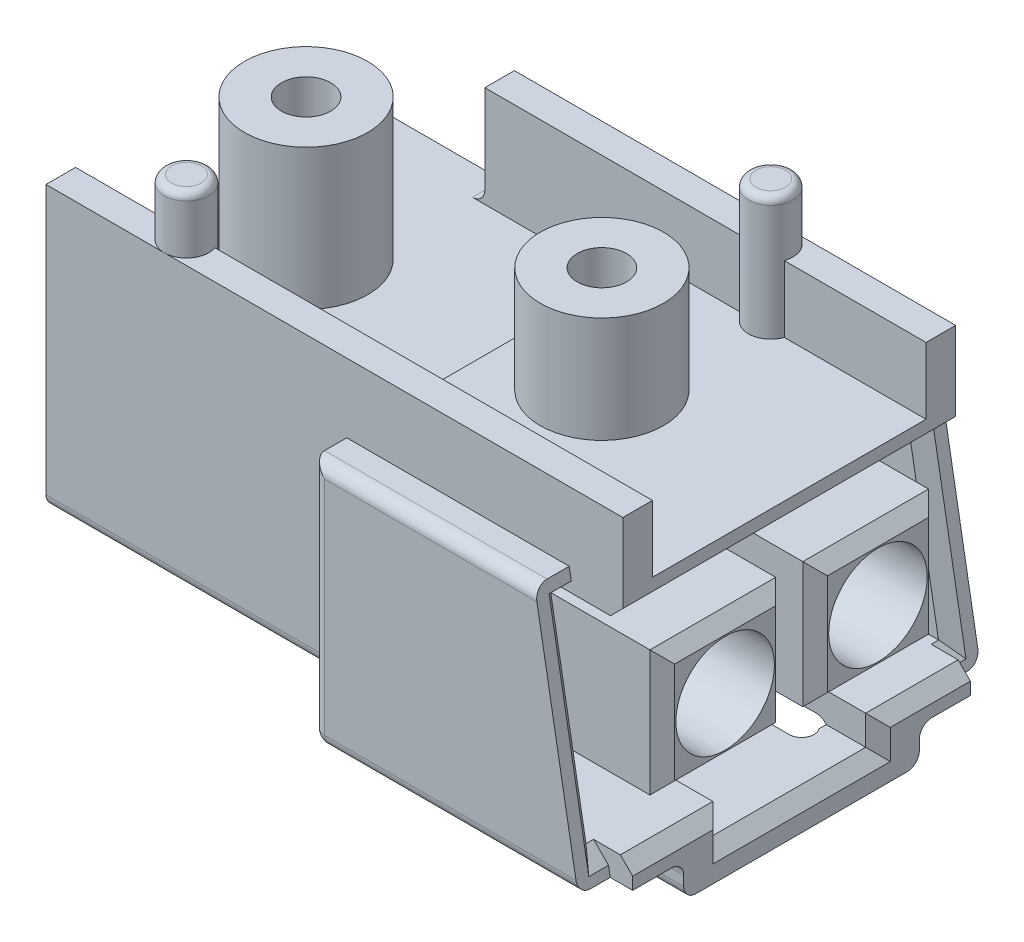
ISO-10303-21;
HEADER;
FILE_DESCRIPTION(('STEP AP214'),'2;1');
FILE_NAME('part.step','',(''),(''),'','','');
FILE_SCHEMA(('AUTOMOTIVE_DESIGN { 1 0 10303 214 1 1 1 1 }'));
ENDSEC;
DATA;
#1=APPLICATION_CONTEXT('core data for automotive mechanical design processes');
#2=APPLICATION_PROTOCOL_DEFINITION('international standard','automotive_design',2000,#1);
#3=PRODUCT_CONTEXT('',#1,'mechanical');
#4=PRODUCT('Part','Part','',(#3));
#5=PRODUCT_RELATED_PRODUCT_CATEGORY('part','',(#4));
#6=PRODUCT_DEFINITION_FORMATION('','',#4);
#7=PRODUCT_DEFINITION_CONTEXT('part definition',#1,'design');
#8=PRODUCT_DEFINITION('design','',#6,#7);
#9=PRODUCT_DEFINITION_SHAPE('','',#8);
#10=(LENGTH_UNIT() NAMED_UNIT(*) SI_UNIT(.MILLI.,.METRE.));
#11=(NAMED_UNIT(*) PLANE_ANGLE_UNIT() SI_UNIT($,.RADIAN.));
#12=(NAMED_UNIT(*) SI_UNIT($,.STERADIAN.) SOLID_ANGLE_UNIT());
#13=UNCERTAINTY_MEASURE_WITH_UNIT(LENGTH_MEASURE(1.E-05),#10,'distance_accuracy_value','');
#14=(GEOMETRIC_REPRESENTATION_CONTEXT(3) GLOBAL_UNCERTAINTY_ASSIGNED_CONTEXT((#13)) GLOBAL_UNIT_ASSIGNED_CONTEXT((#10,
#11,#12)) REPRESENTATION_CONTEXT('',''));
#15=CARTESIAN_POINT('',(0.,0.,0.));
#16=DIRECTION('',(0.,0.,1.));
#17=DIRECTION('',(1.,0.,0.));
#18=AXIS2_PLACEMENT_3D('',#15,#16,#17);
#19=CARTESIAN_POINT('',(5.1,8.7,-6.75));
#20=DIRECTION('',(0.,1.,0.));
#21=DIRECTION('',(-1.,0.,0.));
#22=AXIS2_PLACEMENT_3D('',#19,#20,#21);
#23=PLANE('',#22);
#24=CARTESIAN_POINT('',(8.7,8.7,0.));
#25=DIRECTION('',(0.,1.,0.));
#26=DIRECTION('',(-1.,0.,0.));
#27=AXIS2_PLACEMENT_3D('',#24,#25,#26);
#28=CIRCLE('',#27,2.5);
#29=CARTESIAN_POINT('',(11.2,8.7,0.));
#30=VERTEX_POINT('',#29);
#31=EDGE_CURVE('E1077',#30,#30,#28,.T.);
#32=ORIENTED_EDGE('',*,*,#31,.F.);
#33=EDGE_LOOP('',(#32));
#34=FACE_BOUND('',#33,.T.);
#35=DIRECTION('',(-1.,0.,0.));
#36=VECTOR('',#35,1.);
#37=CARTESIAN_POINT('',(5.1,8.7,-5.55));
#38=LINE('',#37,#36);
#39=CARTESIAN_POINT('',(16.3,8.7,-5.55));
#40=VERTEX_POINT('',#39);
#41=CARTESIAN_POINT('',(10.5485281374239,8.7,-5.55));
#42=VERTEX_POINT('',#41);
#43=EDGE_CURVE('E640',#40,#42,#38,.T.);
#44=ORIENTED_EDGE('',*,*,#43,.T.);
#45=CARTESIAN_POINT('',(9.7,8.7,-5.85));
#46=DIRECTION('',(0.,1.,0.));
#47=DIRECTION('',(-1.,0.,0.));
#48=AXIS2_PLACEMENT_3D('',#45,#46,#47);
#49=CIRCLE('',#48,0.9);
#50=CARTESIAN_POINT('',(8.85147186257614,8.7,-5.55));
#51=VERTEX_POINT('',#50);
#52=EDGE_CURVE('E47',#51,#42,#49,.T.);
#53=ORIENTED_EDGE('',*,*,#52,.F.);
#54=CARTESIAN_POINT('',(5.1,8.7,-5.55));
#55=VERTEX_POINT('',#54);
#56=EDGE_CURVE('E636',#51,#55,#38,.T.);
#57=ORIENTED_EDGE('',*,*,#56,.T.);
#58=DIRECTION('',(0.,0.,1.));
#59=VECTOR('',#58,1.);
#60=CARTESIAN_POINT('',(5.1,8.7,-6.75));
#61=LINE('',#60,#59);
#62=CARTESIAN_POINT('',(5.1,8.7,5.55));
#63=VERTEX_POINT('',#62);
#64=EDGE_CURVE('E779',#55,#63,#61,.T.);
#65=ORIENTED_EDGE('',*,*,#64,.T.);
#66=DIRECTION('',(-1.,0.,0.));
#67=VECTOR('',#66,1.);
#68=CARTESIAN_POINT('',(5.1,8.7,5.55));
#69=LINE('',#68,#67);
#70=CARTESIAN_POINT('',(16.3,8.7,5.55));
#71=VERTEX_POINT('',#70);
#72=EDGE_CURVE('E2214',#71,#63,#69,.T.);
#73=ORIENTED_EDGE('',*,*,#72,.F.);
#74=DIRECTION('',(0.,0.,1.));
#75=VECTOR('',#74,1.);
#76=CARTESIAN_POINT('',(16.3,8.7,-6.75));
#77=LINE('',#76,#75);
#78=EDGE_CURVE('E766',#40,#71,#77,.T.);
#79=ORIENTED_EDGE('',*,*,#78,.F.);
#80=EDGE_LOOP('',(#44,#53,#57,#65,#73,#79));
#81=FACE_BOUND('',#80,.T.);
#82=ADVANCED_FACE('F32',(#34,#81),#23,.T.);
#83=CARTESIAN_POINT('',(16.3,11.4,-5.55));
#84=DIRECTION('',(0.,1.,0.));
#85=DIRECTION('',(0.,0.,1.));
#86=AXIS2_PLACEMENT_3D('',#83,#84,#85);
#87=PLANE('',#86);
#88=DIRECTION('',(1.,0.,0.));
#89=VECTOR('',#88,1.);
#90=CARTESIAN_POINT('',(16.3,11.4,-5.55));
#91=LINE('',#90,#89);
#92=CARTESIAN_POINT('',(-1.6,11.4,-5.55));
#93=VERTEX_POINT('',#92);
#94=CARTESIAN_POINT('',(8.85147186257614,11.4,-5.55));
#95=VERTEX_POINT('',#94);
#96=EDGE_CURVE('E660',#93,#95,#91,.T.);
#97=ORIENTED_EDGE('',*,*,#96,.T.);
#98=CARTESIAN_POINT('',(9.7,11.4,-5.85));
#99=DIRECTION('',(0.,1.,0.));
#100=DIRECTION('',(0.,0.,1.));
#101=AXIS2_PLACEMENT_3D('',#98,#99,#100);
#102=CIRCLE('',#101,0.9);
#103=CARTESIAN_POINT('',(9.7,11.4,-6.75));
#104=VERTEX_POINT('',#103);
#105=EDGE_CURVE('E626',#95,#104,#102,.F.);
#106=ORIENTED_EDGE('',*,*,#105,.T.);
#107=DIRECTION('',(1.,0.,0.));
#108=VECTOR('',#107,1.);
#109=CARTESIAN_POINT('',(16.3,11.4,-6.75));
#110=LINE('',#109,#108);
#111=CARTESIAN_POINT('',(-1.6,11.4,-6.75));
#112=VERTEX_POINT('',#111);
#113=EDGE_CURVE('E647',#112,#104,#110,.T.);
#114=ORIENTED_EDGE('',*,*,#113,.F.);
#115=DIRECTION('',(0.,0.,-1.));
#116=VECTOR('',#115,1.);
#117=CARTESIAN_POINT('',(-1.6,11.4,1.310029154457));
#118=LINE('',#117,#116);
#119=EDGE_CURVE('E2192',#93,#112,#118,.T.);
#120=ORIENTED_EDGE('',*,*,#119,.F.);
#121=EDGE_LOOP('',(#97,#106,#114,#120));
#122=FACE_BOUND('',#121,.T.);
#123=ADVANCED_FACE('F1044',(#122),#87,.T.);
#124=CARTESIAN_POINT('',(16.3,11.4,-6.75));
#125=VERTEX_POINT('',#124);
#126=EDGE_CURVE('E650',#104,#125,#110,.T.);
#127=ORIENTED_EDGE('',*,*,#126,.F.);
#128=CARTESIAN_POINT('',(10.5485281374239,11.4,-5.55));
#129=VERTEX_POINT('',#128);
#130=EDGE_CURVE('E641',#104,#129,#102,.F.);
#131=ORIENTED_EDGE('',*,*,#130,.T.);
#132=CARTESIAN_POINT('',(16.3,11.4,-5.55));
#133=VERTEX_POINT('',#132);
#134=EDGE_CURVE('E659',#129,#133,#91,.T.);
#135=ORIENTED_EDGE('',*,*,#134,.T.);
#136=DIRECTION('',(0.,0.,-1.));
#137=VECTOR('',#136,1.);
#138=CARTESIAN_POINT('',(16.3,11.4,-5.55));
#139=LINE('',#138,#137);
#140=EDGE_CURVE('E663',#133,#125,#139,.T.);
#141=ORIENTED_EDGE('',*,*,#140,.T.);
#142=EDGE_LOOP('',(#127,#131,#135,#141));
#143=FACE_BOUND('',#142,.T.);
#144=ADVANCED_FACE('F1051',(#143),#87,.T.);
#145=CARTESIAN_POINT('',(16.3,8.7,-5.55));
#146=DIRECTION('',(0.,0.,1.));
#147=DIRECTION('',(1.,0.,0.));
#148=AXIS2_PLACEMENT_3D('',#145,#146,#147);
#149=PLANE('',#148);
#150=ORIENTED_EDGE('',*,*,#56,.F.);
#151=DIRECTION('',(0.,-1.,0.));
#152=VECTOR('',#151,1.);
#153=CARTESIAN_POINT('',(8.85147186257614,13.7,-5.55));
#154=LINE('',#153,#152);
#155=EDGE_CURVE('E623',#51,#95,#154,.F.);
#156=ORIENTED_EDGE('',*,*,#155,.T.);
#157=ORIENTED_EDGE('',*,*,#96,.F.);
#158=DIRECTION('',(0.,-1.,0.));
#159=VECTOR('',#158,1.);
#160=CARTESIAN_POINT('',(-1.6,7.3,-5.55));
#161=LINE('',#160,#159);
#162=CARTESIAN_POINT('',(-1.6,7.8,-5.55));
#163=VERTEX_POINT('',#162);
#164=EDGE_CURVE('E1425',#93,#163,#161,.T.);
#165=ORIENTED_EDGE('',*,*,#164,.T.);
#166=CARTESIAN_POINT('',(-2.1,7.8,-5.55));
#167=DIRECTION('',(0.,0.,1.));
#168=DIRECTION('',(1.,0.,0.));
#169=AXIS2_PLACEMENT_3D('',#166,#167,#168);
#170=CIRCLE('',#169,0.5);
#171=CARTESIAN_POINT('',(-2.1,7.3,-5.55));
#172=VERTEX_POINT('',#171);
#173=EDGE_CURVE('E1016',#163,#172,#170,.F.);
#174=ORIENTED_EDGE('',*,*,#173,.T.);
#175=DIRECTION('',(-1.,0.,0.));
#176=VECTOR('',#175,1.);
#177=CARTESIAN_POINT('',(-7.1,7.3,-5.55));
#178=LINE('',#177,#176);
#179=CARTESIAN_POINT('',(5.1,7.3,-5.55));
#180=VERTEX_POINT('',#179);
#181=EDGE_CURVE('E657',#180,#172,#178,.T.);
#182=ORIENTED_EDGE('',*,*,#181,.F.);
#183=DIRECTION('',(0.,-1.,0.));
#184=VECTOR('',#183,1.);
#185=CARTESIAN_POINT('',(5.1,7.3,-5.55));
#186=LINE('',#185,#184);
#187=EDGE_CURVE('E645',#55,#180,#186,.T.);
#188=ORIENTED_EDGE('',*,*,#187,.F.);
#189=EDGE_LOOP('',(#150,#156,#157,#165,#174,#182,#188));
#190=FACE_BOUND('',#189,.T.);
#191=ADVANCED_FACE('F643',(#190),#149,.T.);
#192=ORIENTED_EDGE('',*,*,#134,.F.);
#193=DIRECTION('',(0.,-1.,0.));
#194=VECTOR('',#193,1.);
#195=CARTESIAN_POINT('',(10.5485281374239,13.7,-5.55));
#196=LINE('',#195,#194);
#197=EDGE_CURVE('E632',#129,#42,#196,.T.);
#198=ORIENTED_EDGE('',*,*,#197,.T.);
#199=ORIENTED_EDGE('',*,*,#43,.F.);
#200=DIRECTION('',(0.,-1.,0.));
#201=VECTOR('',#200,1.);
#202=CARTESIAN_POINT('',(16.3,8.7,-5.55));
#203=LINE('',#202,#201);
#204=EDGE_CURVE('E662',#133,#40,#203,.T.);
#205=ORIENTED_EDGE('',*,*,#204,.F.);
#206=EDGE_LOOP('',(#192,#198,#199,#205));
#207=FACE_BOUND('',#206,.T.);
#208=ADVANCED_FACE('F1487',(#207),#149,.T.);
#209=CARTESIAN_POINT('',(-7.1,7.3,-6.75));
#210=DIRECTION('',(0.,1.,0.));
#211=DIRECTION('',(-1.,0.,0.));
#212=AXIS2_PLACEMENT_3D('',#209,#210,#211);
#213=PLANE('',#212);
#214=CARTESIAN_POINT('',(-3.3,7.3,0.));
#215=DIRECTION('',(0.,1.,0.));
#216=DIRECTION('',(-1.,0.,0.));
#217=AXIS2_PLACEMENT_3D('',#214,#215,#216);
#218=CIRCLE('',#217,2.5);
#219=CARTESIAN_POINT('',(-5.8,7.3,0.));
#220=VERTEX_POINT('',#219);
#221=EDGE_CURVE('E1093',#220,#220,#218,.T.);
#222=ORIENTED_EDGE('',*,*,#221,.F.);
#223=EDGE_LOOP('',(#222));
#224=FACE_BOUND('',#223,.T.);
#225=DIRECTION('',(-1.,0.,0.));
#226=VECTOR('',#225,1.);
#227=CARTESIAN_POINT('',(-7.1,7.3,5.55));
#228=LINE('',#227,#226);
#229=CARTESIAN_POINT('',(-3.14852813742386,7.3,5.55));
#230=VERTEX_POINT('',#229);
#231=CARTESIAN_POINT('',(-7.1,7.3,5.55));
#232=VERTEX_POINT('',#231);
#233=EDGE_CURVE('E2221',#230,#232,#228,.T.);
#234=ORIENTED_EDGE('',*,*,#233,.F.);
#235=CARTESIAN_POINT('',(-2.3,7.3,5.85));
#236=DIRECTION('',(0.,1.,0.));
#237=DIRECTION('',(-1.,0.,0.));
#238=AXIS2_PLACEMENT_3D('',#235,#236,#237);
#239=CIRCLE('',#238,0.9);
#240=CARTESIAN_POINT('',(-1.45147186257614,7.3,5.55));
#241=VERTEX_POINT('',#240);
#242=EDGE_CURVE('E55',#241,#230,#239,.T.);
#243=ORIENTED_EDGE('',*,*,#242,.F.);
#244=CARTESIAN_POINT('',(5.1,7.3,5.55));
#245=VERTEX_POINT('',#244);
#246=EDGE_CURVE('E2222',#245,#241,#228,.T.);
#247=ORIENTED_EDGE('',*,*,#246,.F.);
#248=DIRECTION('',(0.,0.,1.));
#249=VECTOR('',#248,1.);
#250=CARTESIAN_POINT('',(5.1,7.3,-6.75));
#251=LINE('',#250,#249);
#252=EDGE_CURVE('E777',#180,#245,#251,.T.);
#253=ORIENTED_EDGE('',*,*,#252,.F.);
#254=ORIENTED_EDGE('',*,*,#181,.T.);
#255=DIRECTION('',(0.,0.,-1.));
#256=VECTOR('',#255,1.);
#257=CARTESIAN_POINT('',(-2.1,7.3,-6.75));
#258=LINE('',#257,#256);
#259=CARTESIAN_POINT('',(-2.1,7.3,-6.75));
#260=VERTEX_POINT('',#259);
#261=EDGE_CURVE('E997',#172,#260,#258,.T.);
#262=ORIENTED_EDGE('',*,*,#261,.T.);
#263=DIRECTION('',(-1.,0.,0.));
#264=VECTOR('',#263,1.);
#265=CARTESIAN_POINT('',(-7.1,7.3,-6.75));
#266=LINE('',#265,#264);
#267=CARTESIAN_POINT('',(-7.1,7.3,-6.75));
#268=VERTEX_POINT('',#267);
#269=EDGE_CURVE('E2306',#260,#268,#266,.T.);
#270=ORIENTED_EDGE('',*,*,#269,.T.);
#271=DIRECTION('',(0.,0.,1.));
#272=VECTOR('',#271,1.);
#273=CARTESIAN_POINT('',(-7.1,7.3,-6.75));
#274=LINE('',#273,#272);
#275=EDGE_CURVE('E774',#268,#232,#274,.T.);
#276=ORIENTED_EDGE('',*,*,#275,.T.);
#277=EDGE_LOOP('',(#234,#243,#247,#253,#254,#262,#270,#276));
#278=FACE_BOUND('',#277,.T.);
#279=ADVANCED_FACE('F1068',(#224,#278),#213,.T.);
#280=CARTESIAN_POINT('',(16.3,11.4,5.55));
#281=DIRECTION('',(0.,1.,0.));
#282=DIRECTION('',(0.,0.,-1.));
#283=AXIS2_PLACEMENT_3D('',#280,#281,#282);
#284=PLANE('',#283);
#285=DIRECTION('',(1.,0.,0.));
#286=VECTOR('',#285,1.);
#287=CARTESIAN_POINT('',(16.3,11.4,6.75));
#288=LINE('',#287,#286);
#289=CARTESIAN_POINT('',(-7.1,11.4,6.75));
#290=VERTEX_POINT('',#289);
#291=CARTESIAN_POINT('',(-2.3,11.4,6.75));
#292=VERTEX_POINT('',#291);
#293=EDGE_CURVE('E2218',#290,#292,#288,.T.);
#294=ORIENTED_EDGE('',*,*,#293,.T.);
#295=CARTESIAN_POINT('',(-2.3,11.4,5.85));
#296=DIRECTION('',(0.,1.,0.));
#297=DIRECTION('',(0.,0.,1.));
#298=AXIS2_PLACEMENT_3D('',#295,#296,#297);
#299=CIRCLE('',#298,0.9);
#300=CARTESIAN_POINT('',(-3.14852813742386,11.4,5.55));
#301=VERTEX_POINT('',#300);
#302=EDGE_CURVE('E2303',#292,#301,#299,.F.);
#303=ORIENTED_EDGE('',*,*,#302,.T.);
#304=DIRECTION('',(1.,0.,0.));
#305=VECTOR('',#304,1.);
#306=CARTESIAN_POINT('',(16.3,11.4,5.55));
#307=LINE('',#306,#305);
#308=CARTESIAN_POINT('',(-7.1,11.4,5.55));
#309=VERTEX_POINT('',#308);
#310=EDGE_CURVE('E2229',#309,#301,#307,.T.);
#311=ORIENTED_EDGE('',*,*,#310,.F.);
#312=DIRECTION('',(0.,0.,1.));
#313=VECTOR('',#312,1.);
#314=CARTESIAN_POINT('',(-7.1,11.4,5.55));
#315=LINE('',#314,#313);
#316=EDGE_CURVE('E2235',#309,#290,#315,.T.);
#317=ORIENTED_EDGE('',*,*,#316,.T.);
#318=EDGE_LOOP('',(#294,#303,#311,#317));
#319=FACE_BOUND('',#318,.T.);
#320=ADVANCED_FACE('F1577',(#319),#284,.T.);
#321=CARTESIAN_POINT('',(-1.45147186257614,11.4,5.55));
#322=VERTEX_POINT('',#321);
#323=CARTESIAN_POINT('',(16.3,11.4,5.55));
#324=VERTEX_POINT('',#323);
#325=EDGE_CURVE('E2228',#322,#324,#307,.T.);
#326=ORIENTED_EDGE('',*,*,#325,.F.);
#327=EDGE_CURVE('E2301',#322,#292,#299,.F.);
#328=ORIENTED_EDGE('',*,*,#327,.T.);
#329=CARTESIAN_POINT('',(16.3,11.4,6.75));
#330=VERTEX_POINT('',#329);
#331=EDGE_CURVE('E2209',#292,#330,#288,.T.);
#332=ORIENTED_EDGE('',*,*,#331,.T.);
#333=DIRECTION('',(0.,0.,1.));
#334=VECTOR('',#333,1.);
#335=CARTESIAN_POINT('',(16.3,11.4,5.55));
#336=LINE('',#335,#334);
#337=EDGE_CURVE('E2021',#324,#330,#336,.T.);
#338=ORIENTED_EDGE('',*,*,#337,.F.);
#339=EDGE_LOOP('',(#326,#328,#332,#338));
#340=FACE_BOUND('',#339,.T.);
#341=ADVANCED_FACE('F1667',(#340),#284,.T.);
#342=CARTESIAN_POINT('',(16.3,8.7,5.55));
#343=DIRECTION('',(0.,0.,-1.));
#344=DIRECTION('',(1.,0.,0.));
#345=AXIS2_PLACEMENT_3D('',#342,#343,#344);
#346=PLANE('',#345);
#347=ORIENTED_EDGE('',*,*,#246,.T.);
#348=DIRECTION('',(0.,-1.,0.));
#349=VECTOR('',#348,1.);
#350=CARTESIAN_POINT('',(-1.45147186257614,13.7,5.55));
#351=LINE('',#350,#349);
#352=EDGE_CURVE('E1021',#241,#322,#351,.F.);
#353=ORIENTED_EDGE('',*,*,#352,.T.);
#354=ORIENTED_EDGE('',*,*,#325,.T.);
#355=DIRECTION('',(0.,-1.,0.));
#356=VECTOR('',#355,1.);
#357=CARTESIAN_POINT('',(16.3,8.7,5.55));
#358=LINE('',#357,#356);
#359=EDGE_CURVE('E2232',#324,#71,#358,.T.);
#360=ORIENTED_EDGE('',*,*,#359,.T.);
#361=ORIENTED_EDGE('',*,*,#72,.T.);
#362=DIRECTION('',(0.,-1.,0.));
#363=VECTOR('',#362,1.);
#364=CARTESIAN_POINT('',(5.1,7.3,5.55));
#365=LINE('',#364,#363);
#366=EDGE_CURVE('E2217',#63,#245,#365,.T.);
#367=ORIENTED_EDGE('',*,*,#366,.T.);
#368=EDGE_LOOP('',(#347,#353,#354,#360,#361,#367));
#369=FACE_BOUND('',#368,.T.);
#370=ADVANCED_FACE('F1069',(#369),#346,.T.);
#371=ORIENTED_EDGE('',*,*,#310,.T.);
#372=DIRECTION('',(0.,-1.,0.));
#373=VECTOR('',#372,1.);
#374=CARTESIAN_POINT('',(-3.14852813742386,13.7,5.55));
#375=LINE('',#374,#373);
#376=EDGE_CURVE('E1019',#301,#230,#375,.T.);
#377=ORIENTED_EDGE('',*,*,#376,.T.);
#378=ORIENTED_EDGE('',*,*,#233,.T.);
#379=DIRECTION('',(0.,1.,0.));
#380=VECTOR('',#379,1.);
#381=CARTESIAN_POINT('',(-7.1,11.4,5.55));
#382=LINE('',#381,#380);
#383=EDGE_CURVE('E2225',#232,#309,#382,.T.);
#384=ORIENTED_EDGE('',*,*,#383,.T.);
#385=EDGE_LOOP('',(#371,#377,#378,#384));
#386=FACE_BOUND('',#385,.T.);
#387=ADVANCED_FACE('F1059',(#386),#346,.T.);
#388=CARTESIAN_POINT('',(8.7,8.7,0.));
#389=DIRECTION('',(0.,-1.,0.));
#390=DIRECTION('',(-1.,0.,0.));
#391=AXIS2_PLACEMENT_3D('',#388,#389,#390);
#392=CIRCLE('',#391,1.);
#393=CARTESIAN_POINT('',(9.7,8.7,0.));
#394=VERTEX_POINT('',#393);
#395=EDGE_CURVE('E1074',#394,#394,#392,.T.);
#396=ORIENTED_EDGE('',*,*,#395,.F.);
#397=EDGE_LOOP('',(#396));
#398=FACE_BOUND('',#397,.T.);
#399=ADVANCED_FACE('F1047',(#398),#23,.T.);
#400=CARTESIAN_POINT('',(-3.3,7.3,0.));
#401=DIRECTION('',(0.,-1.,0.));
#402=DIRECTION('',(-1.,0.,0.));
#403=AXIS2_PLACEMENT_3D('',#400,#401,#402);
#404=CIRCLE('',#403,1.);
#405=CARTESIAN_POINT('',(-4.3,7.3,0.));
#406=VERTEX_POINT('',#405);
#407=EDGE_CURVE('E1090',#406,#406,#404,.T.);
#408=ORIENTED_EDGE('',*,*,#407,.F.);
#409=EDGE_LOOP('',(#408));
#410=FACE_BOUND('',#409,.T.);
#411=ADVANCED_FACE('F1058',(#410),#213,.T.);
#412=CARTESIAN_POINT('',(14.8,-1.40099000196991,-3.1));
#413=DIRECTION('',(1.,0.,0.));
#414=DIRECTION('',(0.,0.,-1.));
#415=AXIS2_PLACEMENT_3D('',#412,#413,#414);
#416=PLANE('',#415);
#417=DIRECTION('',(0.,-1.,0.));
#418=VECTOR('',#417,1.);
#419=CARTESIAN_POINT('',(14.8,-1.6,-2.5));
#420=LINE('',#419,#418);
#421=CARTESIAN_POINT('',(14.8,-2.3,-2.5));
#422=VERTEX_POINT('',#421);
#423=CARTESIAN_POINT('',(14.8,-1.90099000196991,-2.5));
#424=VERTEX_POINT('',#423);
#425=EDGE_CURVE('E829',#422,#424,#420,.F.);
#426=ORIENTED_EDGE('',*,*,#425,.T.);
#427=DIRECTION('',(0.,0.,1.));
#428=VECTOR('',#427,1.);
#429=CARTESIAN_POINT('',(14.8,-1.90099000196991,-3.1));
#430=LINE('',#429,#428);
#431=CARTESIAN_POINT('',(14.8,-1.90099000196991,-4.28013378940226));
#432=VERTEX_POINT('',#431);
#433=EDGE_CURVE('E937',#424,#432,#430,.F.);
#434=ORIENTED_EDGE('',*,*,#433,.T.);
#435=DIRECTION('',(0.,1.,0.));
#436=VECTOR('',#435,1.);
#437=CARTESIAN_POINT('',(14.8,-2.8,-4.28013378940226));
#438=LINE('',#437,#436);
#439=CARTESIAN_POINT('',(14.8,-2.3,-4.28013378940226));
#440=VERTEX_POINT('',#439);
#441=EDGE_CURVE('E834',#432,#440,#438,.F.);
#442=ORIENTED_EDGE('',*,*,#441,.T.);
#443=DIRECTION('',(0.,0.,-1.));
#444=VECTOR('',#443,1.);
#445=CARTESIAN_POINT('',(14.8,-2.3,-2.));
#446=LINE('',#445,#444);
#447=EDGE_CURVE('E832',#440,#422,#446,.F.);
#448=ORIENTED_EDGE('',*,*,#447,.T.);
#449=EDGE_LOOP('',(#426,#434,#442,#448));
#450=FACE_BOUND('',#449,.T.);
#451=ADVANCED_FACE('F1065',(#450),#416,.F.);
#452=CARTESIAN_POINT('',(5.1,8.7,-6.75));
#453=DIRECTION('',(-1.,0.,0.));
#454=DIRECTION('',(0.,0.,1.));
#455=AXIS2_PLACEMENT_3D('',#452,#453,#454);
#456=PLANE('',#455);
#457=DIRECTION('',(0.,-1.,0.));
#458=VECTOR('',#457,1.);
#459=CARTESIAN_POINT('',(5.1,8.7,-7.65));
#460=LINE('',#459,#458);
#461=CARTESIAN_POINT('',(5.1,8.60000000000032,-7.65));
#462=VERTEX_POINT('',#461);
#463=CARTESIAN_POINT('',(5.1,-0.900990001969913,-7.65));
#464=VERTEX_POINT('',#463);
#465=EDGE_CURVE('E878',#462,#464,#460,.T.);
#466=ORIENTED_EDGE('',*,*,#465,.T.);
#467=DIRECTION('',(0.,0.,1.));
#468=VECTOR('',#467,1.);
#469=CARTESIAN_POINT('',(5.1,-0.900990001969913,-6.75));
#470=LINE('',#469,#468);
#471=CARTESIAN_POINT('',(5.1,-0.900990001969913,-3.1));
#472=VERTEX_POINT('',#471);
#473=EDGE_CURVE('E880',#464,#472,#470,.T.);
#474=ORIENTED_EDGE('',*,*,#473,.T.);
#475=DIRECTION('',(0.,1.,0.));
#476=VECTOR('',#475,1.);
#477=CARTESIAN_POINT('',(5.1,-1.40099000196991,-3.1));
#478=LINE('',#477,#476);
#479=CARTESIAN_POINT('',(5.1,0.,-3.1));
#480=VERTEX_POINT('',#479);
#481=EDGE_CURVE('E679',#472,#480,#478,.T.);
#482=ORIENTED_EDGE('',*,*,#481,.T.);
#483=DIRECTION('',(0.,0.,-1.));
#484=VECTOR('',#483,1.);
#485=CARTESIAN_POINT('',(5.1,0.,-3.1));
#486=LINE('',#485,#484);
#487=CARTESIAN_POINT('',(5.1,0.,-6.25));
#488=VERTEX_POINT('',#487);
#489=EDGE_CURVE('E697',#480,#488,#486,.T.);
#490=ORIENTED_EDGE('',*,*,#489,.T.);
#491=CARTESIAN_POINT('',(5.1,0.499999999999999,-6.25));
#492=DIRECTION('',(-1.,0.,0.));
#493=DIRECTION('',(0.,0.,1.));
#494=AXIS2_PLACEMENT_3D('',#491,#492,#493);
#495=CIRCLE('',#494,0.5);
#496=CARTESIAN_POINT('',(5.1,0.499999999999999,-6.75));
#497=VERTEX_POINT('',#496);
#498=EDGE_CURVE('E887',#488,#497,#495,.F.);
#499=ORIENTED_EDGE('',*,*,#498,.T.);
#500=DIRECTION('',(0.,1.,0.));
#501=VECTOR('',#500,1.);
#502=CARTESIAN_POINT('',(5.1,8.60000000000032,-6.75));
#503=LINE('',#502,#501);
#504=CARTESIAN_POINT('',(5.1,8.60000000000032,-6.75));
#505=VERTEX_POINT('',#504);
#506=EDGE_CURVE('E695',#497,#505,#503,.T.);
#507=ORIENTED_EDGE('',*,*,#506,.T.);
#508=DIRECTION('',(0.,0.,-1.));
#509=VECTOR('',#508,1.);
#510=CARTESIAN_POINT('',(5.1,8.60000000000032,-6.75));
#511=LINE('',#510,#509);
#512=EDGE_CURVE('E691',#505,#462,#511,.T.);
#513=ORIENTED_EDGE('',*,*,#512,.T.);
#514=EDGE_LOOP('',(#466,#474,#482,#490,#499,#507,#513));
#515=FACE_BOUND('',#514,.T.);
#516=ADVANCED_FACE('F1205',(#515),#456,.T.);
#517=CARTESIAN_POINT('',(7.1,7.7,-6.75));
#518=DIRECTION('',(1.,0.,0.));
#519=DIRECTION('',(0.,0.,-1.));
#520=AXIS2_PLACEMENT_3D('',#517,#518,#519);
#521=PLANE('',#520);
#522=DIRECTION('',(0.,0.,-1.));
#523=VECTOR('',#522,1.);
#524=CARTESIAN_POINT('',(7.1,1.1,-0.550000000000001));
#525=LINE('',#524,#523);
#526=CARTESIAN_POINT('',(7.1,1.1,-0.550000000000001));
#527=VERTEX_POINT('',#526);
#528=CARTESIAN_POINT('',(7.1,1.1,-5.65));
#529=VERTEX_POINT('',#528);
#530=EDGE_CURVE('E741',#527,#529,#525,.T.);
#531=ORIENTED_EDGE('',*,*,#530,.F.);
#532=DIRECTION('',(0.,-1.,0.));
#533=VECTOR('',#532,1.);
#534=CARTESIAN_POINT('',(7.1,6.2,-0.55));
#535=LINE('',#534,#533);
#536=CARTESIAN_POINT('',(7.1,6.2,-0.55));
#537=VERTEX_POINT('',#536);
#538=EDGE_CURVE('E738',#537,#527,#535,.T.);
#539=ORIENTED_EDGE('',*,*,#538,.F.);
#540=DIRECTION('',(0.,0.,1.));
#541=VECTOR('',#540,1.);
#542=CARTESIAN_POINT('',(7.1,6.2,-5.65));
#543=LINE('',#542,#541);
#544=CARTESIAN_POINT('',(7.1,6.2,-5.65));
#545=VERTEX_POINT('',#544);
#546=EDGE_CURVE('E748',#545,#537,#543,.T.);
#547=ORIENTED_EDGE('',*,*,#546,.F.);
#548=DIRECTION('',(0.,1.,0.));
#549=VECTOR('',#548,1.);
#550=CARTESIAN_POINT('',(7.1,1.1,-5.65));
#551=LINE('',#550,#549);
#552=EDGE_CURVE('E745',#529,#545,#551,.T.);
#553=ORIENTED_EDGE('',*,*,#552,.F.);
#554=EDGE_LOOP('',(#531,#539,#547,#553));
#555=FACE_BOUND('',#554,.T.);
#556=DIRECTION('',(0.,-1.,0.));
#557=VECTOR('',#556,1.);
#558=CARTESIAN_POINT('',(7.1,7.7,-7.15));
#559=LINE('',#558,#557);
#560=CARTESIAN_POINT('',(7.1,7.7,-7.15));
#561=VERTEX_POINT('',#560);
#562=CARTESIAN_POINT('',(7.1,-0.400000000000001,-7.15));
#563=VERTEX_POINT('',#562);
#564=EDGE_CURVE('E673',#561,#563,#559,.T.);
#565=ORIENTED_EDGE('',*,*,#564,.F.);
#566=DIRECTION('',(0.,0.,1.));
#567=VECTOR('',#566,1.);
#568=CARTESIAN_POINT('',(7.1,7.7,-6.75));
#569=LINE('',#568,#567);
#570=CARTESIAN_POINT('',(7.1,7.7,7.15));
#571=VERTEX_POINT('',#570);
#572=EDGE_CURVE('E767',#561,#571,#569,.T.);
#573=ORIENTED_EDGE('',*,*,#572,.T.);
#574=DIRECTION('',(0.,-1.,0.));
#575=VECTOR('',#574,1.);
#576=CARTESIAN_POINT('',(7.1,7.7,7.15));
#577=LINE('',#576,#575);
#578=CARTESIAN_POINT('',(7.1,-0.400000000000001,7.15));
#579=VERTEX_POINT('',#578);
#580=EDGE_CURVE('E2011',#571,#579,#577,.T.);
#581=ORIENTED_EDGE('',*,*,#580,.T.);
#582=DIRECTION('',(0.,0.,-1.));
#583=VECTOR('',#582,1.);
#584=CARTESIAN_POINT('',(7.1,-0.400000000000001,3.1));
#585=LINE('',#584,#583);
#586=CARTESIAN_POINT('',(7.1,-0.400000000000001,3.1));
#587=VERTEX_POINT('',#586);
#588=EDGE_CURVE('E2024',#579,#587,#585,.T.);
#589=ORIENTED_EDGE('',*,*,#588,.T.);
#590=DIRECTION('',(0.,1.,0.));
#591=VECTOR('',#590,1.);
#592=CARTESIAN_POINT('',(7.1,-1.40099000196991,3.1));
#593=LINE('',#592,#591);
#594=CARTESIAN_POINT('',(7.1,0.,3.1));
#595=VERTEX_POINT('',#594);
#596=EDGE_CURVE('E2033',#587,#595,#593,.T.);
#597=ORIENTED_EDGE('',*,*,#596,.T.);
#598=DIRECTION('',(0.,0.,1.));
#599=VECTOR('',#598,1.);
#600=CARTESIAN_POINT('',(7.1,0.,-6.75));
#601=LINE('',#600,#599);
#602=CARTESIAN_POINT('',(7.1,0.,-3.1));
#603=VERTEX_POINT('',#602);
#604=EDGE_CURVE('E770',#603,#595,#601,.T.);
#605=ORIENTED_EDGE('',*,*,#604,.F.);
#606=DIRECTION('',(0.,1.,0.));
#607=VECTOR('',#606,1.);
#608=CARTESIAN_POINT('',(7.1,-1.40099000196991,-3.1));
#609=LINE('',#608,#607);
#610=CARTESIAN_POINT('',(7.1,-0.400000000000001,-3.1));
#611=VERTEX_POINT('',#610);
#612=EDGE_CURVE('E701',#611,#603,#609,.T.);
#613=ORIENTED_EDGE('',*,*,#612,.F.);
#614=DIRECTION('',(0.,0.,1.));
#615=VECTOR('',#614,1.);
#616=CARTESIAN_POINT('',(7.1,-0.400000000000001,-3.1));
#617=LINE('',#616,#615);
#618=EDGE_CURVE('E668',#563,#611,#617,.T.);
#619=ORIENTED_EDGE('',*,*,#618,.F.);
#620=EDGE_LOOP('',(#565,#573,#581,#589,#597,#605,#613,#619));
#621=FACE_BOUND('',#620,.T.);
#622=DIRECTION('',(0.,0.,1.));
#623=VECTOR('',#622,1.);
#624=CARTESIAN_POINT('',(7.1,1.1,0.550000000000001));
#625=LINE('',#624,#623);
#626=CARTESIAN_POINT('',(7.1,1.1,0.550000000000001));
#627=VERTEX_POINT('',#626);
#628=CARTESIAN_POINT('',(7.1,1.1,5.65));
#629=VERTEX_POINT('',#628);
#630=EDGE_CURVE('E2072',#627,#629,#625,.T.);
#631=ORIENTED_EDGE('',*,*,#630,.T.);
#632=DIRECTION('',(0.,1.,0.));
#633=VECTOR('',#632,1.);
#634=CARTESIAN_POINT('',(7.1,1.1,5.65));
#635=LINE('',#634,#633);
#636=CARTESIAN_POINT('',(7.1,6.2,5.65));
#637=VERTEX_POINT('',#636);
#638=EDGE_CURVE('E2076',#629,#637,#635,.T.);
#639=ORIENTED_EDGE('',*,*,#638,.T.);
#640=DIRECTION('',(0.,0.,-1.));
#641=VECTOR('',#640,1.);
#642=CARTESIAN_POINT('',(7.1,6.2,5.65));
#643=LINE('',#642,#641);
#644=CARTESIAN_POINT('',(7.1,6.2,0.55));
#645=VERTEX_POINT('',#644);
#646=EDGE_CURVE('E2079',#637,#645,#643,.T.);
#647=ORIENTED_EDGE('',*,*,#646,.T.);
#648=DIRECTION('',(0.,-1.,0.));
#649=VECTOR('',#648,1.);
#650=CARTESIAN_POINT('',(7.1,6.2,0.55));
#651=LINE('',#650,#649);
#652=EDGE_CURVE('E2069',#645,#627,#651,.T.);
#653=ORIENTED_EDGE('',*,*,#652,.T.);
#654=EDGE_LOOP('',(#631,#639,#647,#653));
#655=FACE_BOUND('',#654,.T.);
#656=ADVANCED_FACE('F1191',(#555,#621,#655),#521,.T.);
#657=CARTESIAN_POINT('',(-7.1,7.7,-6.75));
#658=DIRECTION('',(0.,0.,1.));
#659=DIRECTION('',(1.,0.,0.));
#660=AXIS2_PLACEMENT_3D('',#657,#658,#659);
#661=PLANE('',#660);
#662=ORIENTED_EDGE('',*,*,#113,.T.);
#663=ORIENTED_EDGE('',*,*,#126,.T.);
#664=DIRECTION('',(0.,1.,0.));
#665=VECTOR('',#664,1.);
#666=CARTESIAN_POINT('',(16.3,8.7,-6.75));
#667=LINE('',#666,#665);
#668=CARTESIAN_POINT('',(16.3,8.20000000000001,-6.75));
#669=VERTEX_POINT('',#668);
#670=EDGE_CURVE('E761',#669,#125,#667,.T.);
#671=ORIENTED_EDGE('',*,*,#670,.F.);
#672=DIRECTION('',(0.707106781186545,0.70710678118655,0.));
#673=VECTOR('',#672,1.);
#674=CARTESIAN_POINT('',(15.8,7.7,-6.75));
#675=LINE('',#674,#673);
#676=CARTESIAN_POINT('',(15.8,7.7,-6.75));
#677=VERTEX_POINT('',#676);
#678=EDGE_CURVE('E785',#669,#677,#675,.F.);
#679=ORIENTED_EDGE('',*,*,#678,.T.);
#680=DIRECTION('',(1.,0.,0.));
#681=VECTOR('',#680,1.);
#682=CARTESIAN_POINT('',(16.3,7.7,-6.75));
#683=LINE('',#682,#681);
#684=CARTESIAN_POINT('',(13.7835879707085,7.7,-6.75));
#685=VERTEX_POINT('',#684);
#686=EDGE_CURVE('E759',#685,#677,#683,.T.);
#687=ORIENTED_EDGE('',*,*,#686,.F.);
#688=DIRECTION('',(-0.707106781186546,-0.707106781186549,0.));
#689=VECTOR('',#688,1.);
#690=CARTESIAN_POINT('',(3.34179398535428,-2.74179398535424,-6.75));
#691=LINE('',#690,#689);
#692=CARTESIAN_POINT('',(14.2086398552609,8.12505188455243,-6.75));
#693=VERTEX_POINT('',#692);
#694=EDGE_CURVE('E990',#685,#693,#691,.F.);
#695=ORIENTED_EDGE('',*,*,#694,.T.);
#696=DIRECTION('',(0.173648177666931,-0.984807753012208,0.));
#697=VECTOR('',#696,1.);
#698=CARTESIAN_POINT('',(14.4919187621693,6.51849736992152,-6.75));
#699=LINE('',#698,#697);
#700=CARTESIAN_POINT('',(14.1248936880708,8.60000000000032,-6.75));
#701=VERTEX_POINT('',#700);
#702=EDGE_CURVE('E676',#701,#693,#699,.T.);
#703=ORIENTED_EDGE('',*,*,#702,.F.);
#704=DIRECTION('',(-1.,0.,0.));
#705=VECTOR('',#704,1.);
#706=CARTESIAN_POINT('',(18.3036735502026,8.60000000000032,-6.75));
#707=LINE('',#706,#705);
#708=EDGE_CURVE('E694',#701,#505,#707,.T.);
#709=ORIENTED_EDGE('',*,*,#708,.T.);
#710=ORIENTED_EDGE('',*,*,#506,.F.);
#711=DIRECTION('',(1.,0.,0.));
#712=VECTOR('',#711,1.);
#713=CARTESIAN_POINT('',(-7.1,0.499999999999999,-6.75));
#714=LINE('',#713,#712);
#715=CARTESIAN_POINT('',(-7.1,0.499999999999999,-6.75));
#716=VERTEX_POINT('',#715);
#717=EDGE_CURVE('E839',#497,#716,#714,.F.);
#718=ORIENTED_EDGE('',*,*,#717,.T.);
#719=DIRECTION('',(0.,-1.,0.));
#720=VECTOR('',#719,1.);
#721=CARTESIAN_POINT('',(-7.1,7.3,-6.75));
#722=LINE('',#721,#720);
#723=EDGE_CURVE('E764',#268,#716,#722,.T.);
#724=ORIENTED_EDGE('',*,*,#723,.F.);
#725=ORIENTED_EDGE('',*,*,#269,.F.);
#726=CARTESIAN_POINT('',(-2.1,7.8,-6.75));
#727=DIRECTION('',(0.,0.,1.));
#728=DIRECTION('',(1.,0.,0.));
#729=AXIS2_PLACEMENT_3D('',#726,#727,#728);
#730=CIRCLE('',#729,0.5);
#731=CARTESIAN_POINT('',(-1.6,7.8,-6.75));
#732=VERTEX_POINT('',#731);
#733=EDGE_CURVE('E1014',#260,#732,#730,.T.);
#734=ORIENTED_EDGE('',*,*,#733,.T.);
#735=DIRECTION('',(0.,-1.,0.));
#736=VECTOR('',#735,1.);
#737=CARTESIAN_POINT('',(-1.6,7.3,-6.75));
#738=LINE('',#737,#736);
#739=EDGE_CURVE('E2302',#112,#732,#738,.T.);
#740=ORIENTED_EDGE('',*,*,#739,.F.);
#741=EDGE_LOOP('',(#662,#663,#671,#679,#687,#695,#703,#709,#710,#718,#724,#725,#734,#740));
#742=FACE_BOUND('',#741,.T.);
#743=ADVANCED_FACE('F1563',(#742),#661,.F.);
#744=CARTESIAN_POINT('',(16.3,7.7,-6.75));
#745=DIRECTION('',(0.,-1.,0.));
#746=DIRECTION('',(1.,0.,0.));
#747=AXIS2_PLACEMENT_3D('',#744,#745,#746);
#748=PLANE('',#747);
#749=DIRECTION('',(-1.,0.,0.));
#750=VECTOR('',#749,1.);
#751=CARTESIAN_POINT('',(26.2967067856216,7.7,-7.15));
#752=LINE('',#751,#750);
#753=CARTESIAN_POINT('',(13.7758746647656,7.7,-7.15));
#754=VERTEX_POINT('',#753);
#755=EDGE_CURVE('E667',#754,#561,#752,.T.);
#756=ORIENTED_EDGE('',*,*,#755,.F.);
#757=DIRECTION('',(0.712498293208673,0.,-0.70167384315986));
#758=VECTOR('',#757,1.);
#759=CARTESIAN_POINT('',(14.7334071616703,7.7,-8.09298542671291));
#760=LINE('',#759,#758);
#761=CARTESIAN_POINT('',(13.7835879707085,7.7,-7.1575961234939));
#762=VERTEX_POINT('',#761);
#763=EDGE_CURVE('E994',#754,#762,#760,.T.);
#764=ORIENTED_EDGE('',*,*,#763,.T.);
#765=DIRECTION('',(0.,0.,1.));
#766=VECTOR('',#765,1.);
#767=CARTESIAN_POINT('',(13.7835879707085,7.7,-6.75));
#768=LINE('',#767,#766);
#769=EDGE_CURVE('E982',#762,#685,#768,.T.);
#770=ORIENTED_EDGE('',*,*,#769,.T.);
#771=ORIENTED_EDGE('',*,*,#686,.T.);
#772=DIRECTION('',(0.,0.,1.));
#773=VECTOR('',#772,1.);
#774=CARTESIAN_POINT('',(15.8,7.7,-6.75));
#775=LINE('',#774,#773);
#776=CARTESIAN_POINT('',(15.8,7.7,6.75));
#777=VERTEX_POINT('',#776);
#778=EDGE_CURVE('E769',#677,#777,#775,.T.);
#779=ORIENTED_EDGE('',*,*,#778,.T.);
#780=DIRECTION('',(1.,0.,0.));
#781=VECTOR('',#780,1.);
#782=CARTESIAN_POINT('',(16.3,7.7,6.75));
#783=LINE('',#782,#781);
#784=CARTESIAN_POINT('',(13.7835879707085,7.7,6.75));
#785=VERTEX_POINT('',#784);
#786=EDGE_CURVE('E1988',#785,#777,#783,.T.);
#787=ORIENTED_EDGE('',*,*,#786,.F.);
#788=DIRECTION('',(0.,0.,-1.));
#789=VECTOR('',#788,1.);
#790=CARTESIAN_POINT('',(13.7835879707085,7.7,6.75));
#791=LINE('',#790,#789);
#792=CARTESIAN_POINT('',(13.7835879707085,7.7,7.1575961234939));
#793=VERTEX_POINT('',#792);
#794=EDGE_CURVE('E1407',#793,#785,#791,.T.);
#795=ORIENTED_EDGE('',*,*,#794,.F.);
#796=DIRECTION('',(0.712498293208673,0.,0.70167384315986));
#797=VECTOR('',#796,1.);
#798=CARTESIAN_POINT('',(14.7334071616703,7.7,8.09298542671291));
#799=LINE('',#798,#797);
#800=CARTESIAN_POINT('',(13.7758746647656,7.7,7.15));
#801=VERTEX_POINT('',#800);
#802=EDGE_CURVE('E1083',#801,#793,#799,.T.);
#803=ORIENTED_EDGE('',*,*,#802,.F.);
#804=DIRECTION('',(-1.,0.,0.));
#805=VECTOR('',#804,1.);
#806=CARTESIAN_POINT('',(26.2967067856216,7.7,7.15));
#807=LINE('',#806,#805);
#808=EDGE_CURVE('E1186',#801,#571,#807,.T.);
#809=ORIENTED_EDGE('',*,*,#808,.T.);
#810=ORIENTED_EDGE('',*,*,#572,.F.);
#811=EDGE_LOOP('',(#756,#764,#770,#771,#779,#787,#795,#803,#809,#810));
#812=FACE_BOUND('',#811,.T.);
#813=ADVANCED_FACE('F1181',(#812),#748,.T.);
#814=CARTESIAN_POINT('',(7.1,0.,-6.75));
#815=DIRECTION('',(0.,-1.,0.));
#816=DIRECTION('',(0.,0.,-1.));
#817=AXIS2_PLACEMENT_3D('',#814,#815,#816);
#818=PLANE('',#817);
#819=DIRECTION('',(0.,0.,1.));
#820=VECTOR('',#819,1.);
#821=CARTESIAN_POINT('',(-7.1,0.,-6.75));
#822=LINE('',#821,#820);
#823=CARTESIAN_POINT('',(-7.1,0.,-6.25));
#824=VERTEX_POINT('',#823);
#825=CARTESIAN_POINT('',(-7.1,0.,6.25));
#826=VERTEX_POINT('',#825);
#827=EDGE_CURVE('E772',#824,#826,#822,.T.);
#828=ORIENTED_EDGE('',*,*,#827,.F.);
#829=DIRECTION('',(1.,0.,0.));
#830=VECTOR('',#829,1.);
#831=CARTESIAN_POINT('',(5.1,0.,-6.25));
#832=LINE('',#831,#830);
#833=EDGE_CURVE('E836',#824,#488,#832,.T.);
#834=ORIENTED_EDGE('',*,*,#833,.T.);
#835=ORIENTED_EDGE('',*,*,#489,.F.);
#836=DIRECTION('',(-1.,0.,0.));
#837=VECTOR('',#836,1.);
#838=CARTESIAN_POINT('',(18.3036735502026,0.,-3.1));
#839=LINE('',#838,#837);
#840=EDGE_CURVE('E703',#603,#480,#839,.T.);
#841=ORIENTED_EDGE('',*,*,#840,.F.);
#842=ORIENTED_EDGE('',*,*,#604,.T.);
#843=DIRECTION('',(-1.,0.,0.));
#844=VECTOR('',#843,1.);
#845=CARTESIAN_POINT('',(18.3036735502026,0.,3.1));
#846=LINE('',#845,#844);
#847=CARTESIAN_POINT('',(5.1,0.,3.1));
#848=VERTEX_POINT('',#847);
#849=EDGE_CURVE('E2035',#595,#848,#846,.T.);
#850=ORIENTED_EDGE('',*,*,#849,.T.);
#851=DIRECTION('',(0.,0.,1.));
#852=VECTOR('',#851,1.);
#853=CARTESIAN_POINT('',(5.1,0.,3.1));
#854=LINE('',#853,#852);
#855=CARTESIAN_POINT('',(5.1,0.,6.25));
#856=VERTEX_POINT('',#855);
#857=EDGE_CURVE('E2006',#848,#856,#854,.T.);
#858=ORIENTED_EDGE('',*,*,#857,.T.);
#859=DIRECTION('',(1.,0.,0.));
#860=VECTOR('',#859,1.);
#861=CARTESIAN_POINT('',(5.1,0.,6.25));
#862=LINE('',#861,#860);
#863=EDGE_CURVE('E2150',#826,#856,#862,.T.);
#864=ORIENTED_EDGE('',*,*,#863,.F.);
#865=EDGE_LOOP('',(#828,#834,#835,#841,#842,#850,#858,#864));
#866=FACE_BOUND('',#865,.T.);
#867=ADVANCED_FACE('F1201',(#866),#818,.T.);
#868=CARTESIAN_POINT('',(-7.1,7.3,-6.75));
#869=DIRECTION('',(-1.,0.,0.));
#870=DIRECTION('',(0.,-1.,0.));
#871=AXIS2_PLACEMENT_3D('',#868,#869,#870);
#872=PLANE('',#871);
#873=ORIENTED_EDGE('',*,*,#275,.F.);
#874=ORIENTED_EDGE('',*,*,#723,.T.);
#875=CARTESIAN_POINT('',(-7.1,0.499999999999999,-6.25));
#876=DIRECTION('',(-1.,0.,0.));
#877=DIRECTION('',(0.,-1.,0.));
#878=AXIS2_PLACEMENT_3D('',#875,#876,#877);
#879=CIRCLE('',#878,0.5);
#880=EDGE_CURVE('E842',#716,#824,#879,.T.);
#881=ORIENTED_EDGE('',*,*,#880,.T.);
#882=ORIENTED_EDGE('',*,*,#827,.T.);
#883=CARTESIAN_POINT('',(-7.1,0.499999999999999,6.25));
#884=DIRECTION('',(1.,0.,0.));
#885=DIRECTION('',(0.,-1.,0.));
#886=AXIS2_PLACEMENT_3D('',#883,#884,#885);
#887=CIRCLE('',#886,0.5);
#888=CARTESIAN_POINT('',(-7.1,0.499999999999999,6.75));
#889=VERTEX_POINT('',#888);
#890=EDGE_CURVE('E2155',#889,#826,#887,.T.);
#891=ORIENTED_EDGE('',*,*,#890,.F.);
#892=DIRECTION('',(0.,-1.,0.));
#893=VECTOR('',#892,1.);
#894=CARTESIAN_POINT('',(-7.1,7.3,6.75));
#895=LINE('',#894,#893);
#896=EDGE_CURVE('E2091',#290,#889,#895,.T.);
#897=ORIENTED_EDGE('',*,*,#896,.F.);
#898=ORIENTED_EDGE('',*,*,#316,.F.);
#899=ORIENTED_EDGE('',*,*,#383,.F.);
#900=EDGE_LOOP('',(#873,#874,#881,#882,#891,#897,#898,#899));
#901=FACE_BOUND('',#900,.T.);
#902=CARTESIAN_POINT('',(-7.10000000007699,3.65,-3.1));
#903=DIRECTION('',(-1.,0.,0.));
#904=DIRECTION('',(0.,0.,1.));
#905=AXIS2_PLACEMENT_3D('',#902,#903,#904);
#906=CIRCLE('',#905,2.69999999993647);
#907=CARTESIAN_POINT('',(-7.10000000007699,3.65,-0.400000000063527));
#908=VERTEX_POINT('',#907);
#909=EDGE_CURVE('E710',#908,#908,#906,.T.);
#910=ORIENTED_EDGE('',*,*,#909,.F.);
#911=EDGE_LOOP('',(#910));
#912=FACE_BOUND('',#911,.T.);
#913=CARTESIAN_POINT('',(-7.10000000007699,3.65,3.1));
#914=DIRECTION('',(1.,0.,0.));
#915=DIRECTION('',(0.,0.,-1.));
#916=AXIS2_PLACEMENT_3D('',#913,#914,#915);
#917=CIRCLE('',#916,2.69999999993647);
#918=CARTESIAN_POINT('',(-7.10000000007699,3.65,0.400000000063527));
#919=VERTEX_POINT('',#918);
#920=EDGE_CURVE('E2041',#919,#919,#917,.T.);
#921=ORIENTED_EDGE('',*,*,#920,.T.);
#922=EDGE_LOOP('',(#921));
#923=FACE_BOUND('',#922,.T.);
#924=ADVANCED_FACE('F1572',(#901,#912,#923),#872,.T.);
#925=ORIENTED_EDGE('',*,*,#187,.T.);
#926=ORIENTED_EDGE('',*,*,#252,.T.);
#927=ORIENTED_EDGE('',*,*,#366,.F.);
#928=ORIENTED_EDGE('',*,*,#64,.F.);
#929=EDGE_LOOP('',(#925,#926,#927,#928));
#930=FACE_BOUND('',#929,.T.);
#931=ADVANCED_FACE('F1574',(#930),#456,.T.);
#932=CARTESIAN_POINT('',(16.3,8.7,-6.75));
#933=DIRECTION('',(1.,0.,0.));
#934=DIRECTION('',(0.,0.,-1.));
#935=AXIS2_PLACEMENT_3D('',#932,#933,#934);
#936=PLANE('',#935);
#937=ORIENTED_EDGE('',*,*,#78,.T.);
#938=ORIENTED_EDGE('',*,*,#359,.F.);
#939=ORIENTED_EDGE('',*,*,#337,.T.);
#940=DIRECTION('',(0.,1.,0.));
#941=VECTOR('',#940,1.);
#942=CARTESIAN_POINT('',(16.3,8.7,6.75));
#943=LINE('',#942,#941);
#944=CARTESIAN_POINT('',(16.3,8.20000000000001,6.75));
#945=VERTEX_POINT('',#944);
#946=EDGE_CURVE('E1992',#945,#330,#943,.T.);
#947=ORIENTED_EDGE('',*,*,#946,.F.);
#948=DIRECTION('',(0.,0.,-1.));
#949=VECTOR('',#948,1.);
#950=CARTESIAN_POINT('',(16.3,8.20000000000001,-6.75));
#951=LINE('',#950,#949);
#952=EDGE_CURVE('E783',#945,#669,#951,.T.);
#953=ORIENTED_EDGE('',*,*,#952,.T.);
#954=ORIENTED_EDGE('',*,*,#670,.T.);
#955=ORIENTED_EDGE('',*,*,#140,.F.);
#956=ORIENTED_EDGE('',*,*,#204,.T.);
#957=EDGE_LOOP('',(#937,#938,#939,#947,#953,#954,#955,#956));
#958=FACE_BOUND('',#957,.T.);
#959=ADVANCED_FACE('F1580',(#958),#936,.T.);
#960=CARTESIAN_POINT('',(15.8,7.7,-6.75));
#961=DIRECTION('',(-0.70710678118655,0.707106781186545,0.));
#962=DIRECTION('',(-0.707106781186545,-0.70710678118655,0.));
#963=AXIS2_PLACEMENT_3D('',#960,#961,#962);
#964=PLANE('',#963);
#965=ORIENTED_EDGE('',*,*,#678,.F.);
#966=ORIENTED_EDGE('',*,*,#952,.F.);
#967=DIRECTION('',(0.707106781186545,0.70710678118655,0.));
#968=VECTOR('',#967,1.);
#969=CARTESIAN_POINT('',(15.8,7.7,6.75));
#970=LINE('',#969,#968);
#971=EDGE_CURVE('E2094',#945,#777,#970,.F.);
#972=ORIENTED_EDGE('',*,*,#971,.T.);
#973=ORIENTED_EDGE('',*,*,#778,.F.);
#974=EDGE_LOOP('',(#965,#966,#972,#973));
#975=FACE_BOUND('',#974,.T.);
#976=ADVANCED_FACE('F1561',(#975),#964,.F.);
#977=CARTESIAN_POINT('',(16.8,6.2,-0.55));
#978=DIRECTION('',(0.,0.,-1.));
#979=DIRECTION('',(0.,1.,0.));
#980=AXIS2_PLACEMENT_3D('',#977,#978,#979);
#981=PLANE('',#980);
#982=DIRECTION('',(-1.,0.,0.));
#983=VECTOR('',#982,1.);
#984=CARTESIAN_POINT('',(16.8,1.1,-0.550000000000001));
#985=LINE('',#984,#983);
#986=CARTESIAN_POINT('',(16.3,1.1,-0.550000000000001));
#987=VERTEX_POINT('',#986);
#988=EDGE_CURVE('E757',#987,#527,#985,.T.);
#989=ORIENTED_EDGE('',*,*,#988,.F.);
#990=DIRECTION('',(0.,1.,0.));
#991=VECTOR('',#990,1.);
#992=CARTESIAN_POINT('',(16.3,6.2,-0.55));
#993=LINE('',#992,#991);
#994=CARTESIAN_POINT('',(16.3,6.2,-0.55));
#995=VERTEX_POINT('',#994);
#996=EDGE_CURVE('E804',#987,#995,#993,.T.);
#997=ORIENTED_EDGE('',*,*,#996,.T.);
#998=DIRECTION('',(-1.,0.,0.));
#999=VECTOR('',#998,1.);
#1000=CARTESIAN_POINT('',(16.8,6.2,-0.55));
#1001=LINE('',#1000,#999);
#1002=EDGE_CURVE('E751',#995,#537,#1001,.T.);
#1003=ORIENTED_EDGE('',*,*,#1002,.T.);
#1004=ORIENTED_EDGE('',*,*,#538,.T.);
#1005=EDGE_LOOP('',(#989,#997,#1003,#1004));
#1006=FACE_BOUND('',#1005,.T.);
#1007=ADVANCED_FACE('F1557',(#1006),#981,.F.);
#1008=CARTESIAN_POINT('',(16.8,1.1,-0.550000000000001));
#1009=DIRECTION('',(0.,1.,0.));
#1010=DIRECTION('',(0.,0.,1.));
#1011=AXIS2_PLACEMENT_3D('',#1008,#1009,#1010);
#1012=PLANE('',#1011);
#1013=DIRECTION('',(-1.,0.,0.));
#1014=VECTOR('',#1013,1.);
#1015=CARTESIAN_POINT('',(16.8,1.1,-5.65));
#1016=LINE('',#1015,#1014);
#1017=CARTESIAN_POINT('',(16.3,1.1,-5.65));
#1018=VERTEX_POINT('',#1017);
#1019=EDGE_CURVE('E755',#1018,#529,#1016,.T.);
#1020=ORIENTED_EDGE('',*,*,#1019,.F.);
#1021=DIRECTION('',(0.,0.,1.));
#1022=VECTOR('',#1021,1.);
#1023=CARTESIAN_POINT('',(16.3,1.1,-0.550000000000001));
#1024=LINE('',#1023,#1022);
#1025=EDGE_CURVE('E797',#1018,#987,#1024,.T.);
#1026=ORIENTED_EDGE('',*,*,#1025,.T.);
#1027=ORIENTED_EDGE('',*,*,#988,.T.);
#1028=ORIENTED_EDGE('',*,*,#530,.T.);
#1029=EDGE_LOOP('',(#1020,#1026,#1027,#1028));
#1030=FACE_BOUND('',#1029,.T.);
#1031=ADVANCED_FACE('F1553',(#1030),#1012,.F.);
#1032=CARTESIAN_POINT('',(16.8,1.1,-5.65));
#1033=DIRECTION('',(0.,0.,1.));
#1034=DIRECTION('',(0.,-1.,0.));
#1035=AXIS2_PLACEMENT_3D('',#1032,#1033,#1034);
#1036=PLANE('',#1035);
#1037=DIRECTION('',(-1.,0.,0.));
#1038=VECTOR('',#1037,1.);
#1039=CARTESIAN_POINT('',(16.8,6.2,-5.65));
#1040=LINE('',#1039,#1038);
#1041=CARTESIAN_POINT('',(16.3,6.2,-5.65));
#1042=VERTEX_POINT('',#1041);
#1043=EDGE_CURVE('E753',#1042,#545,#1040,.T.);
#1044=ORIENTED_EDGE('',*,*,#1043,.F.);
#1045=DIRECTION('',(0.,-1.,0.));
#1046=VECTOR('',#1045,1.);
#1047=CARTESIAN_POINT('',(16.3,1.1,-5.65));
#1048=LINE('',#1047,#1046);
#1049=EDGE_CURVE('E800',#1042,#1018,#1048,.T.);
#1050=ORIENTED_EDGE('',*,*,#1049,.T.);
#1051=ORIENTED_EDGE('',*,*,#1019,.T.);
#1052=ORIENTED_EDGE('',*,*,#552,.T.);
#1053=EDGE_LOOP('',(#1044,#1050,#1051,#1052));
#1054=FACE_BOUND('',#1053,.T.);
#1055=ADVANCED_FACE('F1549',(#1054),#1036,.F.);
#1056=CARTESIAN_POINT('',(16.8,6.2,-5.65));
#1057=DIRECTION('',(0.,-1.,0.));
#1058=DIRECTION('',(0.,0.,-1.));
#1059=AXIS2_PLACEMENT_3D('',#1056,#1057,#1058);
#1060=PLANE('',#1059);
#1061=ORIENTED_EDGE('',*,*,#1002,.F.);
#1062=DIRECTION('',(0.,0.,-1.));
#1063=VECTOR('',#1062,1.);
#1064=CARTESIAN_POINT('',(16.3,6.2,-5.65));
#1065=LINE('',#1064,#1063);
#1066=EDGE_CURVE('E802',#995,#1042,#1065,.T.);
#1067=ORIENTED_EDGE('',*,*,#1066,.T.);
#1068=ORIENTED_EDGE('',*,*,#1043,.T.);
#1069=ORIENTED_EDGE('',*,*,#546,.T.);
#1070=EDGE_LOOP('',(#1061,#1067,#1068,#1069));
#1071=FACE_BOUND('',#1070,.T.);
#1072=ADVANCED_FACE('F1545',(#1071),#1060,.F.);
#1073=CARTESIAN_POINT('',(16.8,6.2,-0.55));
#1074=DIRECTION('',(-1.,0.,0.));
#1075=DIRECTION('',(0.,0.,1.));
#1076=AXIS2_PLACEMENT_3D('',#1073,#1074,#1075);
#1077=PLANE('',#1076);
#1078=CARTESIAN_POINT('',(16.8,3.65,-3.1));
#1079=DIRECTION('',(-1.,0.,0.));
#1080=DIRECTION('',(0.,0.,1.));
#1081=AXIS2_PLACEMENT_3D('',#1078,#1079,#1080);
#1082=CIRCLE('',#1081,2.);
#1083=CARTESIAN_POINT('',(16.8,3.65,-1.1));
#1084=VERTEX_POINT('',#1083);
#1085=EDGE_CURVE('E734',#1084,#1084,#1082,.T.);
#1086=ORIENTED_EDGE('',*,*,#1085,.T.);
#1087=EDGE_LOOP('',(#1086));
#1088=FACE_BOUND('',#1087,.T.);
#1089=DIRECTION('',(0.,-1.,0.));
#1090=VECTOR('',#1089,1.);
#1091=CARTESIAN_POINT('',(16.8,6.2,-1.05));
#1092=LINE('',#1091,#1090);
#1093=CARTESIAN_POINT('',(16.8,5.7,-1.05));
#1094=VERTEX_POINT('',#1093);
#1095=CARTESIAN_POINT('',(16.8,1.6,-1.05));
#1096=VERTEX_POINT('',#1095);
#1097=EDGE_CURVE('E788',#1094,#1096,#1092,.T.);
#1098=ORIENTED_EDGE('',*,*,#1097,.T.);
#1099=DIRECTION('',(0.,0.,-1.));
#1100=VECTOR('',#1099,1.);
#1101=CARTESIAN_POINT('',(16.8,1.6,-0.55));
#1102=LINE('',#1101,#1100);
#1103=CARTESIAN_POINT('',(16.8,1.6,-5.15));
#1104=VERTEX_POINT('',#1103);
#1105=EDGE_CURVE('E794',#1096,#1104,#1102,.T.);
#1106=ORIENTED_EDGE('',*,*,#1105,.T.);
#1107=DIRECTION('',(0.,1.,0.));
#1108=VECTOR('',#1107,1.);
#1109=CARTESIAN_POINT('',(16.8,6.2,-5.15));
#1110=LINE('',#1109,#1108);
#1111=CARTESIAN_POINT('',(16.8,5.7,-5.15));
#1112=VERTEX_POINT('',#1111);
#1113=EDGE_CURVE('E792',#1104,#1112,#1110,.T.);
#1114=ORIENTED_EDGE('',*,*,#1113,.T.);
#1115=DIRECTION('',(0.,0.,1.));
#1116=VECTOR('',#1115,1.);
#1117=CARTESIAN_POINT('',(16.8,5.7,-0.55));
#1118=LINE('',#1117,#1116);
#1119=EDGE_CURVE('E790',#1112,#1094,#1118,.T.);
#1120=ORIENTED_EDGE('',*,*,#1119,.T.);
#1121=EDGE_LOOP('',(#1098,#1106,#1114,#1120));
#1122=FACE_BOUND('',#1121,.T.);
#1123=ADVANCED_FACE('F1541',(#1088,#1122),#1077,.F.);
#1124=CARTESIAN_POINT('',(16.8,5.7,-0.55));
#1125=DIRECTION('',(-0.707106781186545,-0.70710678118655,0.));
#1126=DIRECTION('',(0.70710678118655,-0.707106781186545,0.));
#1127=AXIS2_PLACEMENT_3D('',#1124,#1125,#1126);
#1128=PLANE('',#1127);
#1129=DIRECTION('',(-0.577350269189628,0.577350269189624,-0.577350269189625));
#1130=VECTOR('',#1129,1.);
#1131=CARTESIAN_POINT('',(18.3333333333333,4.16666666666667,-3.61666666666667));
#1132=LINE('',#1131,#1130);
#1133=EDGE_CURVE('E810',#1042,#1112,#1132,.F.);
#1134=ORIENTED_EDGE('',*,*,#1133,.F.);
#1135=ORIENTED_EDGE('',*,*,#1066,.F.);
#1136=DIRECTION('',(-0.577350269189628,0.577350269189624,0.577350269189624));
#1137=VECTOR('',#1136,1.);
#1138=CARTESIAN_POINT('',(16.6333333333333,5.86666666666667,-0.883333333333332));
#1139=LINE('',#1138,#1137);
#1140=EDGE_CURVE('E742',#1094,#995,#1139,.T.);
#1141=ORIENTED_EDGE('',*,*,#1140,.F.);
#1142=ORIENTED_EDGE('',*,*,#1119,.F.);
#1143=EDGE_LOOP('',(#1134,#1135,#1141,#1142));
#1144=FACE_BOUND('',#1143,.T.);
#1145=ADVANCED_FACE('F1544',(#1144),#1128,.F.);
#1146=CARTESIAN_POINT('',(16.8,6.2,-1.05));
#1147=DIRECTION('',(-0.707106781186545,0.,-0.70710678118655));
#1148=DIRECTION('',(-0.70710678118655,0.,0.707106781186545));
#1149=AXIS2_PLACEMENT_3D('',#1146,#1147,#1148);
#1150=PLANE('',#1149);
#1151=ORIENTED_EDGE('',*,*,#1140,.T.);
#1152=ORIENTED_EDGE('',*,*,#996,.F.);
#1153=DIRECTION('',(0.577350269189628,0.577350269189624,-0.577350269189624));
#1154=VECTOR('',#1153,1.);
#1155=CARTESIAN_POINT('',(18.3333333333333,3.13333333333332,-2.58333333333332));
#1156=LINE('',#1155,#1154);
#1157=EDGE_CURVE('E808',#1096,#987,#1156,.F.);
#1158=ORIENTED_EDGE('',*,*,#1157,.F.);
#1159=ORIENTED_EDGE('',*,*,#1097,.F.);
#1160=EDGE_LOOP('',(#1151,#1152,#1158,#1159));
#1161=FACE_BOUND('',#1160,.T.);
#1162=ADVANCED_FACE('F3250',(#1161),#1150,.F.);
#1163=CARTESIAN_POINT('',(16.8,6.2,-5.15));
#1164=DIRECTION('',(-0.707106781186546,0.,0.707106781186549));
#1165=DIRECTION('',(0.707106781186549,0.,0.707106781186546));
#1166=AXIS2_PLACEMENT_3D('',#1163,#1164,#1165);
#1167=PLANE('',#1166);
#1168=ORIENTED_EDGE('',*,*,#1133,.T.);
#1169=ORIENTED_EDGE('',*,*,#1113,.F.);
#1170=DIRECTION('',(-0.577350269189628,-0.577350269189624,-0.577350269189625));
#1171=VECTOR('',#1170,1.);
#1172=CARTESIAN_POINT('',(18.3333333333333,3.13333333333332,-3.61666666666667));
#1173=LINE('',#1172,#1171);
#1174=EDGE_CURVE('E737',#1018,#1104,#1173,.F.);
#1175=ORIENTED_EDGE('',*,*,#1174,.F.);
#1176=ORIENTED_EDGE('',*,*,#1049,.F.);
#1177=EDGE_LOOP('',(#1168,#1169,#1175,#1176));
#1178=FACE_BOUND('',#1177,.T.);
#1179=ADVANCED_FACE('F3241',(#1178),#1167,.F.);
#1180=CARTESIAN_POINT('',(16.8,1.6,-0.55));
#1181=DIRECTION('',(-0.707106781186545,0.70710678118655,0.));
#1182=DIRECTION('',(-0.70710678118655,-0.707106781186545,0.));
#1183=AXIS2_PLACEMENT_3D('',#1180,#1181,#1182);
#1184=PLANE('',#1183);
#1185=ORIENTED_EDGE('',*,*,#1157,.T.);
#1186=ORIENTED_EDGE('',*,*,#1025,.F.);
#1187=ORIENTED_EDGE('',*,*,#1174,.T.);
#1188=ORIENTED_EDGE('',*,*,#1105,.F.);
#1189=EDGE_LOOP('',(#1185,#1186,#1187,#1188));
#1190=FACE_BOUND('',#1189,.T.);
#1191=ADVANCED_FACE('F1539',(#1190),#1184,.F.);
#1192=CARTESIAN_POINT('',(-7.10000000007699,3.65,-3.1));
#1193=DIRECTION('',(-1.,0.,0.));
#1194=DIRECTION('',(0.,0.,1.));
#1195=AXIS2_PLACEMENT_3D('',#1192,#1193,#1194);
#1196=CYLINDRICAL_SURFACE('',#1195,2.);
#1197=ORIENTED_EDGE('',*,*,#1085,.F.);
#1198=EDGE_LOOP('',(#1197));
#1199=FACE_BOUND('',#1198,.T.);
#1200=CARTESIAN_POINT('',(7.95,3.65,-3.1));
#1201=DIRECTION('',(-1.,0.,0.));
#1202=DIRECTION('',(0.,0.,1.));
#1203=AXIS2_PLACEMENT_3D('',#1200,#1201,#1202);
#1204=CIRCLE('',#1203,2.);
#1205=CARTESIAN_POINT('',(7.95,3.65,-1.1));
#1206=VERTEX_POINT('',#1205);
#1207=EDGE_CURVE('E731',#1206,#1206,#1204,.T.);
#1208=ORIENTED_EDGE('',*,*,#1207,.T.);
#1209=EDGE_LOOP('',(#1208));
#1210=FACE_BOUND('',#1209,.T.);
#1211=ADVANCED_FACE('F1535',(#1199,#1210),#1196,.F.);
#1212=CARTESIAN_POINT('',(7.95,1.65,-3.1));
#1213=DIRECTION('',(-1.,0.,0.));
#1214=DIRECTION('',(0.,0.,1.));
#1215=AXIS2_PLACEMENT_3D('',#1212,#1213,#1214);
#1216=PLANE('',#1215);
#1217=ORIENTED_EDGE('',*,*,#1207,.F.);
#1218=EDGE_LOOP('',(#1217));
#1219=FACE_BOUND('',#1218,.T.);
#1220=CARTESIAN_POINT('',(7.95,3.65,-3.1));
#1221=DIRECTION('',(-1.,0.,0.));
#1222=DIRECTION('',(0.,0.,1.));
#1223=AXIS2_PLACEMENT_3D('',#1220,#1221,#1222);
#1224=CIRCLE('',#1223,1.315);
#1225=CARTESIAN_POINT('',(7.95,3.65,-1.785));
#1226=VERTEX_POINT('',#1225);
#1227=EDGE_CURVE('E728',#1226,#1226,#1224,.T.);
#1228=ORIENTED_EDGE('',*,*,#1227,.T.);
#1229=EDGE_LOOP('',(#1228));
#1230=FACE_BOUND('',#1229,.T.);
#1231=ADVANCED_FACE('F1531',(#1219,#1230),#1216,.F.);
#1232=CARTESIAN_POINT('',(-7.10000000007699,3.65,-3.1));
#1233=DIRECTION('',(-1.,0.,0.));
#1234=DIRECTION('',(0.,0.,1.));
#1235=AXIS2_PLACEMENT_3D('',#1232,#1233,#1234);
#1236=CYLINDRICAL_SURFACE('',#1235,1.315);
#1237=ORIENTED_EDGE('',*,*,#1227,.F.);
#1238=EDGE_LOOP('',(#1237));
#1239=FACE_BOUND('',#1238,.T.);
#1240=CARTESIAN_POINT('',(6.05000000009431,3.65,-3.1));
#1241=DIRECTION('',(-1.,0.,0.));
#1242=DIRECTION('',(0.,0.,1.));
#1243=AXIS2_PLACEMENT_3D('',#1240,#1241,#1242);
#1244=CIRCLE('',#1243,1.315);
#1245=CARTESIAN_POINT('',(6.05000000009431,3.65,-1.785));
#1246=VERTEX_POINT('',#1245);
#1247=EDGE_CURVE('E725',#1246,#1246,#1244,.T.);
#1248=ORIENTED_EDGE('',*,*,#1247,.T.);
#1249=EDGE_LOOP('',(#1248));
#1250=FACE_BOUND('',#1249,.T.);
#1251=ADVANCED_FACE('F1527',(#1239,#1250),#1236,.F.);
#1252=CARTESIAN_POINT('',(5.79999999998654,3.65,-3.1));
#1253=DIRECTION('',(-1.,0.,0.));
#1254=DIRECTION('',(0.,0.,1.));
#1255=AXIS2_PLACEMENT_3D('',#1252,#1253,#1254);
#1256=CONICAL_SURFACE('',#1255,1.56500000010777,0.785398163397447);
#1257=ORIENTED_EDGE('',*,*,#1247,.F.);
#1258=EDGE_LOOP('',(#1257));
#1259=FACE_BOUND('',#1258,.T.);
#1260=CARTESIAN_POINT('',(5.79999999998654,3.65,-3.1));
#1261=DIRECTION('',(-1.,0.,0.));
#1262=DIRECTION('',(0.,0.,1.));
#1263=AXIS2_PLACEMENT_3D('',#1260,#1261,#1262);
#1264=CIRCLE('',#1263,1.56500000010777);
#1265=CARTESIAN_POINT('',(5.79999999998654,3.65,-1.53499999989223));
#1266=VERTEX_POINT('',#1265);
#1267=EDGE_CURVE('E722',#1266,#1266,#1264,.T.);
#1268=ORIENTED_EDGE('',*,*,#1267,.T.);
#1269=EDGE_LOOP('',(#1268));
#1270=FACE_BOUND('',#1269,.T.);
#1271=ADVANCED_FACE('F1523',(#1259,#1270),#1256,.F.);
#1272=CARTESIAN_POINT('',(5.79999999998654,2.00000000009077,-3.1));
#1273=DIRECTION('',(1.,0.,0.));
#1274=DIRECTION('',(0.,0.,-1.));
#1275=AXIS2_PLACEMENT_3D('',#1272,#1273,#1274);
#1276=PLANE('',#1275);
#1277=ORIENTED_EDGE('',*,*,#1267,.F.);
#1278=EDGE_LOOP('',(#1277));
#1279=FACE_BOUND('',#1278,.T.);
#1280=CARTESIAN_POINT('',(5.79999999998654,3.65,-3.1));
#1281=DIRECTION('',(-1.,0.,0.));
#1282=DIRECTION('',(0.,0.,1.));
#1283=AXIS2_PLACEMENT_3D('',#1280,#1281,#1282);
#1284=CIRCLE('',#1283,1.64999999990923);
#1285=CARTESIAN_POINT('',(5.79999999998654,3.65,-1.45000000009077));
#1286=VERTEX_POINT('',#1285);
#1287=EDGE_CURVE('E719',#1286,#1286,#1284,.T.);
#1288=ORIENTED_EDGE('',*,*,#1287,.T.);
#1289=EDGE_LOOP('',(#1288));
#1290=FACE_BOUND('',#1289,.T.);
#1291=ADVANCED_FACE('F1519',(#1279,#1290),#1276,.F.);
#1292=CARTESIAN_POINT('',(-7.10000000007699,3.65,-3.1));
#1293=DIRECTION('',(-1.,0.,0.));
#1294=DIRECTION('',(0.,0.,1.));
#1295=AXIS2_PLACEMENT_3D('',#1292,#1293,#1294);
#1296=CYLINDRICAL_SURFACE('',#1295,1.64999999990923);
#1297=ORIENTED_EDGE('',*,*,#1287,.F.);
#1298=EDGE_LOOP('',(#1297));
#1299=FACE_BOUND('',#1298,.T.);
#1300=CARTESIAN_POINT('',(3.39999999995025,3.65,-3.1));
#1301=DIRECTION('',(-1.,0.,0.));
#1302=DIRECTION('',(0.,0.,1.));
#1303=AXIS2_PLACEMENT_3D('',#1300,#1301,#1302);
#1304=CIRCLE('',#1303,1.64999999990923);
#1305=CARTESIAN_POINT('',(3.39999999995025,3.65,-1.45000000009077));
#1306=VERTEX_POINT('',#1305);
#1307=EDGE_CURVE('E716',#1306,#1306,#1304,.T.);
#1308=ORIENTED_EDGE('',*,*,#1307,.T.);
#1309=EDGE_LOOP('',(#1308));
#1310=FACE_BOUND('',#1309,.T.);
#1311=ADVANCED_FACE('F1515',(#1299,#1310),#1296,.F.);
#1312=CARTESIAN_POINT('',(2.34999999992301,3.65,-3.1));
#1313=DIRECTION('',(-1.,0.,0.));
#1314=DIRECTION('',(0.,0.,1.));
#1315=AXIS2_PLACEMENT_3D('',#1312,#1313,#1314);
#1316=CONICAL_SURFACE('',#1315,2.69999999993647,0.785398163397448);
#1317=ORIENTED_EDGE('',*,*,#1307,.F.);
#1318=EDGE_LOOP('',(#1317));
#1319=FACE_BOUND('',#1318,.T.);
#1320=CARTESIAN_POINT('',(2.34999999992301,3.65,-3.1));
#1321=DIRECTION('',(-1.,0.,0.));
#1322=DIRECTION('',(0.,0.,1.));
#1323=AXIS2_PLACEMENT_3D('',#1320,#1321,#1322);
#1324=CIRCLE('',#1323,2.69999999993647);
#1325=CARTESIAN_POINT('',(2.34999999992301,3.65,-0.400000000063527));
#1326=VERTEX_POINT('',#1325);
#1327=EDGE_CURVE('E713',#1326,#1326,#1324,.T.);
#1328=ORIENTED_EDGE('',*,*,#1327,.T.);
#1329=EDGE_LOOP('',(#1328));
#1330=FACE_BOUND('',#1329,.T.);
#1331=ADVANCED_FACE('F1511',(#1319,#1330),#1316,.F.);
#1332=CARTESIAN_POINT('',(-7.10000000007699,3.65,-3.1));
#1333=DIRECTION('',(-1.,0.,0.));
#1334=DIRECTION('',(0.,0.,1.));
#1335=AXIS2_PLACEMENT_3D('',#1332,#1333,#1334);
#1336=CYLINDRICAL_SURFACE('',#1335,2.69999999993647);
#1337=ORIENTED_EDGE('',*,*,#1327,.F.);
#1338=EDGE_LOOP('',(#1337));
#1339=FACE_BOUND('',#1338,.T.);
#1340=ORIENTED_EDGE('',*,*,#909,.T.);
#1341=EDGE_LOOP('',(#1340));
#1342=FACE_BOUND('',#1341,.T.);
#1343=ADVANCED_FACE('F1507',(#1339,#1342),#1336,.F.);
#1344=CARTESIAN_POINT('',(18.3036735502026,8.60000000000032,-6.75));
#1345=DIRECTION('',(0.,1.,0.));
#1346=DIRECTION('',(0.,0.,1.));
#1347=AXIS2_PLACEMENT_3D('',#1344,#1345,#1346);
#1348=PLANE('',#1347);
#1349=DIRECTION('',(0.,0.,1.));
#1350=VECTOR('',#1349,1.);
#1351=CARTESIAN_POINT('',(14.1248936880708,8.60000000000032,-6.75));
#1352=LINE('',#1351,#1350);
#1353=CARTESIAN_POINT('',(14.1248936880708,8.60000000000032,-7.65));
#1354=VERTEX_POINT('',#1353);
#1355=EDGE_CURVE('E680',#1354,#701,#1352,.T.);
#1356=ORIENTED_EDGE('',*,*,#1355,.F.);
#1357=DIRECTION('',(-1.,0.,0.));
#1358=VECTOR('',#1357,1.);
#1359=CARTESIAN_POINT('',(18.3036735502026,8.60000000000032,-7.65));
#1360=LINE('',#1359,#1358);
#1361=EDGE_CURVE('E885',#1354,#462,#1360,.T.);
#1362=ORIENTED_EDGE('',*,*,#1361,.T.);
#1363=ORIENTED_EDGE('',*,*,#512,.F.);
#1364=ORIENTED_EDGE('',*,*,#708,.F.);
#1365=EDGE_LOOP('',(#1356,#1362,#1363,#1364));
#1366=FACE_BOUND('',#1365,.T.);
#1367=ADVANCED_FACE('F1503',(#1366),#1348,.T.);
#1368=CARTESIAN_POINT('',(18.3036735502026,8.60000000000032,-8.15));
#1369=DIRECTION('',(0.,0.,-1.));
#1370=DIRECTION('',(0.,1.,0.));
#1371=AXIS2_PLACEMENT_3D('',#1368,#1369,#1370);
#1372=PLANE('',#1371);
#1373=DIRECTION('',(-0.173648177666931,0.984807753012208,0.));
#1374=VECTOR('',#1373,1.);
#1375=CARTESIAN_POINT('',(14.4919187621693,6.51849736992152,-8.15));
#1376=LINE('',#1375,#1374);
#1377=CARTESIAN_POINT('',(15.8001745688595,-0.900990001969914,-8.15));
#1378=VERTEX_POINT('',#1377);
#1379=CARTESIAN_POINT('',(14.213057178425,8.10000000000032,-8.15));
#1380=VERTEX_POINT('',#1379);
#1381=EDGE_CURVE('E682',#1378,#1380,#1376,.T.);
#1382=ORIENTED_EDGE('',*,*,#1381,.F.);
#1383=DIRECTION('',(-1.,0.,0.));
#1384=VECTOR('',#1383,1.);
#1385=CARTESIAN_POINT('',(18.3036735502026,-0.900990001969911,-8.15));
#1386=LINE('',#1385,#1384);
#1387=CARTESIAN_POINT('',(5.6,-0.900990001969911,-8.15));
#1388=VERTEX_POINT('',#1387);
#1389=EDGE_CURVE('E867',#1378,#1388,#1386,.T.);
#1390=ORIENTED_EDGE('',*,*,#1389,.T.);
#1391=DIRECTION('',(0.,-1.,0.));
#1392=VECTOR('',#1391,1.);
#1393=CARTESIAN_POINT('',(5.6,8.60000000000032,-8.15));
#1394=LINE('',#1393,#1392);
#1395=CARTESIAN_POINT('',(5.6,8.10000000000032,-8.15));
#1396=VERTEX_POINT('',#1395);
#1397=EDGE_CURVE('E865',#1388,#1396,#1394,.F.);
#1398=ORIENTED_EDGE('',*,*,#1397,.T.);
#1399=DIRECTION('',(-1.,0.,0.));
#1400=VECTOR('',#1399,1.);
#1401=CARTESIAN_POINT('',(18.3036735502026,8.10000000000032,-8.15));
#1402=LINE('',#1401,#1400);
#1403=EDGE_CURVE('E863',#1396,#1380,#1402,.F.);
#1404=ORIENTED_EDGE('',*,*,#1403,.T.);
#1405=EDGE_LOOP('',(#1382,#1390,#1398,#1404));
#1406=FACE_BOUND('',#1405,.T.);
#1407=ADVANCED_FACE('F1500',(#1406),#1372,.T.);
#1408=CARTESIAN_POINT('',(18.3036735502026,-1.40099000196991,-3.1));
#1409=DIRECTION('',(0.,-1.,0.));
#1410=DIRECTION('',(0.,0.,-1.));
#1411=AXIS2_PLACEMENT_3D('',#1408,#1409,#1410);
#1412=PLANE('',#1411);
#1413=CARTESIAN_POINT('',(15.3,-1.40099000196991,-4.28013378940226));
#1414=DIRECTION('',(0.,-1.,0.));
#1415=DIRECTION('',(0.,0.,-1.));
#1416=AXIS2_PLACEMENT_3D('',#1413,#1414,#1415);
#1417=CIRCLE('',#1416,1.);
#1418=CARTESIAN_POINT('',(15.3,-1.40099000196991,-5.28013378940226));
#1419=VERTEX_POINT('',#1418);
#1420=CARTESIAN_POINT('',(14.3,-1.40099000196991,-4.28013378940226));
#1421=VERTEX_POINT('',#1420);
#1422=EDGE_CURVE('E932',#1419,#1421,#1417,.F.);
#1423=ORIENTED_EDGE('',*,*,#1422,.T.);
#1424=DIRECTION('',(0.,0.,1.));
#1425=VECTOR('',#1424,1.);
#1426=CARTESIAN_POINT('',(14.3,-1.40099000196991,-3.1));
#1427=LINE('',#1426,#1425);
#1428=CARTESIAN_POINT('',(14.3,-1.40099000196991,-3.1));
#1429=VERTEX_POINT('',#1428);
#1430=EDGE_CURVE('E934',#1421,#1429,#1427,.T.);
#1431=ORIENTED_EDGE('',*,*,#1430,.T.);
#1432=DIRECTION('',(-1.,0.,0.));
#1433=VECTOR('',#1432,1.);
#1434=CARTESIAN_POINT('',(18.3036735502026,-1.40099000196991,-3.1));
#1435=LINE('',#1434,#1433);
#1436=CARTESIAN_POINT('',(5.6,-1.40099000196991,-3.1));
#1437=VERTEX_POINT('',#1436);
#1438=EDGE_CURVE('E704',#1429,#1437,#1435,.T.);
#1439=ORIENTED_EDGE('',*,*,#1438,.T.);
#1440=DIRECTION('',(0.,0.,1.));
#1441=VECTOR('',#1440,1.);
#1442=CARTESIAN_POINT('',(5.6,-1.40099000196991,-3.1));
#1443=LINE('',#1442,#1441);
#1444=CARTESIAN_POINT('',(5.6,-1.40099000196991,-7.65));
#1445=VERTEX_POINT('',#1444);
#1446=EDGE_CURVE('E870',#1437,#1445,#1443,.F.);
#1447=ORIENTED_EDGE('',*,*,#1446,.T.);
#1448=DIRECTION('',(-1.,0.,0.));
#1449=VECTOR('',#1448,1.);
#1450=CARTESIAN_POINT('',(18.3036735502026,-1.40099000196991,-7.65));
#1451=LINE('',#1450,#1449);
#1452=CARTESIAN_POINT('',(15.8883380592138,-1.40099000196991,-7.65));
#1453=VERTEX_POINT('',#1452);
#1454=EDGE_CURVE('E872',#1445,#1453,#1451,.F.);
#1455=ORIENTED_EDGE('',*,*,#1454,.T.);
#1456=DIRECTION('',(0.,0.,-1.));
#1457=VECTOR('',#1456,1.);
#1458=CARTESIAN_POINT('',(15.8883380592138,-1.40099000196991,-8.15));
#1459=LINE('',#1458,#1457);
#1460=CARTESIAN_POINT('',(15.8883380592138,-1.40099000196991,-6.85));
#1461=VERTEX_POINT('',#1460);
#1462=EDGE_CURVE('E685',#1461,#1453,#1459,.T.);
#1463=ORIENTED_EDGE('',*,*,#1462,.F.);
#1464=DIRECTION('',(1.,0.,0.));
#1465=VECTOR('',#1464,1.);
#1466=CARTESIAN_POINT('',(14.8,-1.40099000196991,-6.85));
#1467=LINE('',#1466,#1465);
#1468=CARTESIAN_POINT('',(16.8,-1.40099000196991,-6.85));
#1469=VERTEX_POINT('',#1468);
#1470=EDGE_CURVE('E1124',#1461,#1469,#1467,.T.);
#1471=ORIENTED_EDGE('',*,*,#1470,.T.);
#1472=DIRECTION('',(0.,0.,-1.));
#1473=VECTOR('',#1472,1.);
#1474=CARTESIAN_POINT('',(16.8,-1.40099000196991,-4.78013378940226));
#1475=LINE('',#1474,#1473);
#1476=CARTESIAN_POINT('',(16.8,-1.40099000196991,-5.28013378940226));
#1477=VERTEX_POINT('',#1476);
#1478=EDGE_CURVE('E1117',#1477,#1469,#1475,.T.);
#1479=ORIENTED_EDGE('',*,*,#1478,.F.);
#1480=DIRECTION('',(1.,0.,0.));
#1481=VECTOR('',#1480,1.);
#1482=CARTESIAN_POINT('',(15.3,-1.40099000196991,-5.28013378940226));
#1483=LINE('',#1482,#1481);
#1484=EDGE_CURVE('E891',#1477,#1419,#1483,.F.);
#1485=ORIENTED_EDGE('',*,*,#1484,.T.);
#1486=EDGE_LOOP('',(#1423,#1431,#1439,#1447,#1455,#1463,#1471,#1479,#1485));
#1487=FACE_BOUND('',#1486,.T.);
#1488=ADVANCED_FACE('F1215',(#1487),#1412,.T.);
#1489=CARTESIAN_POINT('',(18.3036735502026,-1.40099000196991,-3.1));
#1490=DIRECTION('',(0.,0.,1.));
#1491=DIRECTION('',(0.,-1.,0.));
#1492=AXIS2_PLACEMENT_3D('',#1489,#1490,#1491);
#1493=PLANE('',#1492);
#1494=DIRECTION('',(1.,0.,0.));
#1495=VECTOR('',#1494,1.);
#1496=CARTESIAN_POINT('',(14.8,-1.6,-3.1));
#1497=LINE('',#1496,#1495);
#1498=CARTESIAN_POINT('',(14.6992555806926,-1.6,-3.1));
#1499=VERTEX_POINT('',#1498);
#1500=CARTESIAN_POINT('',(16.3,-1.6,-3.1));
#1501=VERTEX_POINT('',#1500);
#1502=EDGE_CURVE('E654',#1499,#1501,#1497,.T.);
#1503=ORIENTED_EDGE('',*,*,#1502,.T.);
#1504=DIRECTION('',(0.,1.,0.));
#1505=VECTOR('',#1504,1.);
#1506=CARTESIAN_POINT('',(16.3,-1.40099000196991,-3.1));
#1507=LINE('',#1506,#1505);
#1508=CARTESIAN_POINT('',(16.3,-0.400000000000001,-3.1));
#1509=VERTEX_POINT('',#1508);
#1510=EDGE_CURVE('E967',#1501,#1509,#1507,.T.);
#1511=ORIENTED_EDGE('',*,*,#1510,.T.);
#1512=DIRECTION('',(-1.,0.,0.));
#1513=VECTOR('',#1512,1.);
#1514=CARTESIAN_POINT('',(26.2967067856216,-0.400000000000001,-3.1));
#1515=LINE('',#1514,#1513);
#1516=EDGE_CURVE('E671',#1509,#611,#1515,.T.);
#1517=ORIENTED_EDGE('',*,*,#1516,.T.);
#1518=ORIENTED_EDGE('',*,*,#612,.T.);
#1519=ORIENTED_EDGE('',*,*,#840,.T.);
#1520=ORIENTED_EDGE('',*,*,#481,.F.);
#1521=CARTESIAN_POINT('',(5.6,-0.900990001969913,-3.1));
#1522=DIRECTION('',(0.,0.,1.));
#1523=DIRECTION('',(0.,-1.,0.));
#1524=AXIS2_PLACEMENT_3D('',#1521,#1522,#1523);
#1525=CIRCLE('',#1524,0.5);
#1526=EDGE_CURVE('E882',#472,#1437,#1525,.T.);
#1527=ORIENTED_EDGE('',*,*,#1526,.T.);
#1528=ORIENTED_EDGE('',*,*,#1438,.F.);
#1529=CARTESIAN_POINT('',(14.3,-1.90099000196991,-3.1));
#1530=DIRECTION('',(0.,0.,1.));
#1531=DIRECTION('',(0.,-1.,0.));
#1532=AXIS2_PLACEMENT_3D('',#1529,#1530,#1531);
#1533=CIRCLE('',#1532,0.5);
#1534=EDGE_CURVE('E943',#1429,#1499,#1533,.F.);
#1535=ORIENTED_EDGE('',*,*,#1534,.T.);
#1536=EDGE_LOOP('',(#1503,#1511,#1517,#1518,#1519,#1520,#1527,#1528,#1535));
#1537=FACE_BOUND('',#1536,.T.);
#1538=ADVANCED_FACE('F1133',(#1537),#1493,.T.);
#1539=CARTESIAN_POINT('',(26.2967067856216,7.7,-7.15));
#1540=DIRECTION('',(0.,0.,-1.));
#1541=DIRECTION('',(0.,1.,0.));
#1542=AXIS2_PLACEMENT_3D('',#1539,#1540,#1541);
#1543=PLANE('',#1542);
#1544=DIRECTION('',(-1.,0.,0.));
#1545=VECTOR('',#1544,1.);
#1546=CARTESIAN_POINT('',(26.2967067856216,-0.400000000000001,-7.15));
#1547=LINE('',#1546,#1545);
#1548=CARTESIAN_POINT('',(15.2041232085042,-0.400000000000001,-7.15));
#1549=VERTEX_POINT('',#1548);
#1550=EDGE_CURVE('E672',#1549,#563,#1547,.T.);
#1551=ORIENTED_EDGE('',*,*,#1550,.F.);
#1552=DIRECTION('',(-0.173648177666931,0.984807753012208,0.));
#1553=VECTOR('',#1552,1.);
#1554=CARTESIAN_POINT('',(13.7911840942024,7.61317591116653,-7.15));
#1555=LINE('',#1554,#1553);
#1556=EDGE_CURVE('E985',#1549,#754,#1555,.T.);
#1557=ORIENTED_EDGE('',*,*,#1556,.T.);
#1558=ORIENTED_EDGE('',*,*,#755,.T.);
#1559=ORIENTED_EDGE('',*,*,#564,.T.);
#1560=EDGE_LOOP('',(#1551,#1557,#1558,#1559));
#1561=FACE_BOUND('',#1560,.T.);
#1562=ADVANCED_FACE('F1178',(#1561),#1543,.F.);
#1563=CARTESIAN_POINT('',(26.2967067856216,-0.400000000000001,-3.1));
#1564=DIRECTION('',(0.,-1.,0.));
#1565=DIRECTION('',(0.,0.,-1.));
#1566=AXIS2_PLACEMENT_3D('',#1563,#1564,#1565);
#1567=PLANE('',#1566);
#1568=ORIENTED_EDGE('',*,*,#1516,.F.);
#1569=DIRECTION('',(0.,0.,-1.));
#1570=VECTOR('',#1569,1.);
#1571=CARTESIAN_POINT('',(16.3,-0.400000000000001,-6.85));
#1572=LINE('',#1571,#1570);
#1573=CARTESIAN_POINT('',(16.3,-0.400000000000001,-6.85));
#1574=VERTEX_POINT('',#1573);
#1575=EDGE_CURVE('E971',#1509,#1574,#1572,.T.);
#1576=ORIENTED_EDGE('',*,*,#1575,.T.);
#1577=DIRECTION('',(1.,0.,0.));
#1578=VECTOR('',#1577,1.);
#1579=CARTESIAN_POINT('',(14.8,-0.400000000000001,-6.85));
#1580=LINE('',#1579,#1578);
#1581=CARTESIAN_POINT('',(15.211836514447,-0.400000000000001,-6.85));
#1582=VERTEX_POINT('',#1581);
#1583=EDGE_CURVE('E1122',#1582,#1574,#1580,.T.);
#1584=ORIENTED_EDGE('',*,*,#1583,.F.);
#1585=DIRECTION('',(0.,0.,-1.));
#1586=VECTOR('',#1585,1.);
#1587=CARTESIAN_POINT('',(15.211836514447,-0.400000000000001,-7.15));
#1588=LINE('',#1587,#1586);
#1589=CARTESIAN_POINT('',(15.211836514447,-0.400000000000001,-7.1575961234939));
#1590=VERTEX_POINT('',#1589);
#1591=EDGE_CURVE('E969',#1582,#1590,#1588,.T.);
#1592=ORIENTED_EDGE('',*,*,#1591,.T.);
#1593=DIRECTION('',(-0.712498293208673,0.,0.70167384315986));
#1594=VECTOR('',#1593,1.);
#1595=CARTESIAN_POINT('',(18.8105528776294,-0.400000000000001,-10.7016398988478));
#1596=LINE('',#1595,#1594);
#1597=EDGE_CURVE('E992',#1590,#1549,#1596,.T.);
#1598=ORIENTED_EDGE('',*,*,#1597,.T.);
#1599=ORIENTED_EDGE('',*,*,#1550,.T.);
#1600=ORIENTED_EDGE('',*,*,#618,.T.);
#1601=EDGE_LOOP('',(#1568,#1576,#1584,#1592,#1598,#1599,#1600));
#1602=FACE_BOUND('',#1601,.T.);
#1603=ADVANCED_FACE('F1160',(#1602),#1567,.F.);
#1604=CARTESIAN_POINT('',(15.1696626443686,2.67482081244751,0.));
#1605=DIRECTION('',(0.984807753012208,0.173648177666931,0.));
#1606=DIRECTION('',(-0.173648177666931,0.984807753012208,0.));
#1607=AXIS2_PLACEMENT_3D('',#1604,#1605,#1606);
#1608=PLANE('',#1607);
#1609=DIRECTION('',(0.173648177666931,-0.984807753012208,0.));
#1610=VECTOR('',#1609,1.);
#1611=CARTESIAN_POINT('',(15.711836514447,-0.400000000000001,-7.65));
#1612=LINE('',#1611,#1610);
#1613=CARTESIAN_POINT('',(14.2086398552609,8.12505188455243,-7.65));
#1614=VERTEX_POINT('',#1613);
#1615=CARTESIAN_POINT('',(15.8188735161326,-1.00703700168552,-7.65));
#1616=VERTEX_POINT('',#1615);
#1617=EDGE_CURVE('E975',#1614,#1616,#1612,.T.);
#1618=ORIENTED_EDGE('',*,*,#1617,.T.);
#1619=DIRECTION('',(0.,0.,1.));
#1620=VECTOR('',#1619,1.);
#1621=CARTESIAN_POINT('',(15.8188735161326,-1.00703700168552,-6.85));
#1622=LINE('',#1621,#1620);
#1623=CARTESIAN_POINT('',(15.8188735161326,-1.00703700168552,-6.85));
#1624=VERTEX_POINT('',#1623);
#1625=EDGE_CURVE('E979',#1616,#1624,#1622,.T.);
#1626=ORIENTED_EDGE('',*,*,#1625,.T.);
#1627=DIRECTION('',(-0.173648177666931,0.984807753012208,0.));
#1628=VECTOR('',#1627,1.);
#1629=CARTESIAN_POINT('',(15.1696626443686,2.67482081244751,-6.85));
#1630=LINE('',#1629,#1628);
#1631=EDGE_CURVE('E806',#1461,#1624,#1630,.T.);
#1632=ORIENTED_EDGE('',*,*,#1631,.F.);
#1633=ORIENTED_EDGE('',*,*,#1462,.T.);
#1634=CARTESIAN_POINT('',(15.8001745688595,-0.900990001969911,-7.65));
#1635=DIRECTION('',(0.984807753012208,0.173648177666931,0.));
#1636=DIRECTION('',(-0.173648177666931,0.984807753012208,0.));
#1637=AXIS2_PLACEMENT_3D('',#1634,#1635,#1636);
#1638=ELLIPSE('',#1637,0.507713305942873,0.5);
#1639=EDGE_CURVE('E876',#1453,#1378,#1638,.T.);
#1640=ORIENTED_EDGE('',*,*,#1639,.T.);
#1641=ORIENTED_EDGE('',*,*,#1381,.T.);
#1642=CARTESIAN_POINT('',(14.213057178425,8.10000000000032,-7.65));
#1643=DIRECTION('',(0.984807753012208,0.173648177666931,0.));
#1644=DIRECTION('',(-0.173648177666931,0.984807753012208,0.));
#1645=AXIS2_PLACEMENT_3D('',#1642,#1643,#1644);
#1646=ELLIPSE('',#1645,0.507713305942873,0.5);
#1647=EDGE_CURVE('E874',#1380,#1354,#1646,.T.);
#1648=ORIENTED_EDGE('',*,*,#1647,.T.);
#1649=ORIENTED_EDGE('',*,*,#1355,.T.);
#1650=ORIENTED_EDGE('',*,*,#702,.T.);
#1651=DIRECTION('',(0.,0.,-1.));
#1652=VECTOR('',#1651,1.);
#1653=CARTESIAN_POINT('',(14.2086398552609,8.12505188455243,0.));
#1654=LINE('',#1653,#1652);
#1655=EDGE_CURVE('E977',#693,#1614,#1654,.T.);
#1656=ORIENTED_EDGE('',*,*,#1655,.T.);
#1657=EDGE_LOOP('',(#1618,#1626,#1632,#1633,#1640,#1641,#1648,#1649,#1650,#1656));
#1658=FACE_BOUND('',#1657,.T.);
#1659=ADVANCED_FACE('F1476',(#1658),#1608,.T.);
#1660=CARTESIAN_POINT('',(14.8,-0.400000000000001,-6.85));
#1661=DIRECTION('',(0.,0.,-1.));
#1662=DIRECTION('',(-1.,0.,0.));
#1663=AXIS2_PLACEMENT_3D('',#1660,#1661,#1662);
#1664=PLANE('',#1663);
#1665=ORIENTED_EDGE('',*,*,#1583,.T.);
#1666=DIRECTION('',(0.70710678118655,-0.707106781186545,0.));
#1667=VECTOR('',#1666,1.);
#1668=CARTESIAN_POINT('',(15.55,0.349999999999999,-6.85));
#1669=LINE('',#1668,#1667);
#1670=CARTESIAN_POINT('',(16.8,-0.899999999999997,-6.85));
#1671=VERTEX_POINT('',#1670);
#1672=EDGE_CURVE('E973',#1574,#1671,#1669,.T.);
#1673=ORIENTED_EDGE('',*,*,#1672,.T.);
#1674=DIRECTION('',(0.,1.,0.));
#1675=VECTOR('',#1674,1.);
#1676=CARTESIAN_POINT('',(16.8,-0.400000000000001,-6.85));
#1677=LINE('',#1676,#1675);
#1678=EDGE_CURVE('E1119',#1469,#1671,#1677,.T.);
#1679=ORIENTED_EDGE('',*,*,#1678,.F.);
#1680=ORIENTED_EDGE('',*,*,#1470,.F.);
#1681=ORIENTED_EDGE('',*,*,#1631,.T.);
#1682=DIRECTION('',(-0.707106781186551,0.707106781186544,0.));
#1683=VECTOR('',#1682,1.);
#1684=CARTESIAN_POINT('',(15.8188735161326,-1.00703700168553,-6.85));
#1685=LINE('',#1684,#1683);
#1686=EDGE_CURVE('E987',#1624,#1582,#1685,.T.);
#1687=ORIENTED_EDGE('',*,*,#1686,.T.);
#1688=EDGE_LOOP('',(#1665,#1673,#1679,#1680,#1681,#1687));
#1689=FACE_BOUND('',#1688,.T.);
#1690=ADVANCED_FACE('F1162',(#1689),#1664,.T.);
#1691=CARTESIAN_POINT('',(14.8,-1.40099000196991,-4.78013378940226));
#1692=DIRECTION('',(0.,0.,-1.));
#1693=DIRECTION('',(-1.,0.,0.));
#1694=AXIS2_PLACEMENT_3D('',#1691,#1692,#1693);
#1695=PLANE('',#1694);
#1696=DIRECTION('',(0.,1.,0.));
#1697=VECTOR('',#1696,1.);
#1698=CARTESIAN_POINT('',(15.3,-1.40099000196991,-4.78013378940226));
#1699=LINE('',#1698,#1697);
#1700=CARTESIAN_POINT('',(15.3,-2.3,-4.78013378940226));
#1701=VERTEX_POINT('',#1700);
#1702=CARTESIAN_POINT('',(15.3,-1.90099000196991,-4.78013378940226));
#1703=VERTEX_POINT('',#1702);
#1704=EDGE_CURVE('E846',#1701,#1703,#1699,.T.);
#1705=ORIENTED_EDGE('',*,*,#1704,.T.);
#1706=DIRECTION('',(1.,0.,0.));
#1707=VECTOR('',#1706,1.);
#1708=CARTESIAN_POINT('',(16.8,-1.90099000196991,-4.78013378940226));
#1709=LINE('',#1708,#1707);
#1710=CARTESIAN_POINT('',(16.8,-1.90099000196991,-4.78013378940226));
#1711=VERTEX_POINT('',#1710);
#1712=EDGE_CURVE('E941',#1703,#1711,#1709,.T.);
#1713=ORIENTED_EDGE('',*,*,#1712,.T.);
#1714=DIRECTION('',(0.,1.,0.));
#1715=VECTOR('',#1714,1.);
#1716=CARTESIAN_POINT('',(16.8,-1.40099000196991,-4.78013378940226));
#1717=LINE('',#1716,#1715);
#1718=CARTESIAN_POINT('',(16.8,-2.3,-4.78013378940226));
#1719=VERTEX_POINT('',#1718);
#1720=EDGE_CURVE('E1114',#1719,#1711,#1717,.T.);
#1721=ORIENTED_EDGE('',*,*,#1720,.F.);
#1722=DIRECTION('',(1.,0.,0.));
#1723=VECTOR('',#1722,1.);
#1724=CARTESIAN_POINT('',(14.8,-2.3,-4.78013378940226));
#1725=LINE('',#1724,#1723);
#1726=EDGE_CURVE('E844',#1719,#1701,#1725,.F.);
#1727=ORIENTED_EDGE('',*,*,#1726,.T.);
#1728=EDGE_LOOP('',(#1705,#1713,#1721,#1727));
#1729=FACE_BOUND('',#1728,.T.);
#1730=ADVANCED_FACE('F1475',(#1729),#1695,.T.);
#1731=CARTESIAN_POINT('',(14.8,-2.8,0.));
#1732=DIRECTION('',(0.,-1.,0.));
#1733=DIRECTION('',(0.,0.,-1.));
#1734=AXIS2_PLACEMENT_3D('',#1731,#1732,#1733);
#1735=PLANE('',#1734);
#1736=DIRECTION('',(0.,0.,-1.));
#1737=VECTOR('',#1736,1.);
#1738=CARTESIAN_POINT('',(15.3,-2.8,-4.78013378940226));
#1739=LINE('',#1738,#1737);
#1740=CARTESIAN_POINT('',(15.3,-2.8,-2.5));
#1741=VERTEX_POINT('',#1740);
#1742=CARTESIAN_POINT('',(15.3,-2.8,-4.28013378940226));
#1743=VERTEX_POINT('',#1742);
#1744=EDGE_CURVE('E824',#1741,#1743,#1739,.T.);
#1745=ORIENTED_EDGE('',*,*,#1744,.T.);
#1746=DIRECTION('',(1.,0.,0.));
#1747=VECTOR('',#1746,1.);
#1748=CARTESIAN_POINT('',(14.8,-2.8,-4.28013378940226));
#1749=LINE('',#1748,#1747);
#1750=CARTESIAN_POINT('',(16.8,-2.8,-4.28013378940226));
#1751=VERTEX_POINT('',#1750);
#1752=EDGE_CURVE('E827',#1743,#1751,#1749,.T.);
#1753=ORIENTED_EDGE('',*,*,#1752,.T.);
#1754=DIRECTION('',(0.,0.,-1.));
#1755=VECTOR('',#1754,1.);
#1756=CARTESIAN_POINT('',(16.8,-2.8,0.));
#1757=LINE('',#1756,#1755);
#1758=CARTESIAN_POINT('',(16.8,-2.8,4.28013378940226));
#1759=VERTEX_POINT('',#1758);
#1760=EDGE_CURVE('E1108',#1759,#1751,#1757,.T.);
#1761=ORIENTED_EDGE('',*,*,#1760,.F.);
#1762=DIRECTION('',(1.,0.,0.));
#1763=VECTOR('',#1762,1.);
#1764=CARTESIAN_POINT('',(14.8,-2.8,4.28013378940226));
#1765=LINE('',#1764,#1763);
#1766=CARTESIAN_POINT('',(15.3,-2.8,4.28013378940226));
#1767=VERTEX_POINT('',#1766);
#1768=EDGE_CURVE('E2138',#1767,#1759,#1765,.T.);
#1769=ORIENTED_EDGE('',*,*,#1768,.F.);
#1770=DIRECTION('',(0.,0.,1.));
#1771=VECTOR('',#1770,1.);
#1772=CARTESIAN_POINT('',(15.3,-2.8,4.78013378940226));
#1773=LINE('',#1772,#1771);
#1774=CARTESIAN_POINT('',(15.3,-2.8,2.5));
#1775=VERTEX_POINT('',#1774);
#1776=EDGE_CURVE('E2135',#1775,#1767,#1773,.T.);
#1777=ORIENTED_EDGE('',*,*,#1776,.F.);
#1778=CARTESIAN_POINT('',(14.3,-2.8,2.5));
#1779=DIRECTION('',(0.,1.,0.));
#1780=DIRECTION('',(0.,0.,1.));
#1781=AXIS2_PLACEMENT_3D('',#1778,#1779,#1780);
#1782=CIRCLE('',#1781,1.);
#1783=CARTESIAN_POINT('',(14.3,-2.8,1.5));
#1784=VERTEX_POINT('',#1783);
#1785=EDGE_CURVE('E2132',#1775,#1784,#1782,.T.);
#1786=ORIENTED_EDGE('',*,*,#1785,.T.);
#1787=DIRECTION('',(1.,0.,0.));
#1788=VECTOR('',#1787,1.);
#1789=CARTESIAN_POINT('',(14.8,-2.8,1.5));
#1790=LINE('',#1789,#1788);
#1791=CARTESIAN_POINT('',(8.7,-2.8,1.5));
#1792=VERTEX_POINT('',#1791);
#1793=EDGE_CURVE('E2129',#1792,#1784,#1790,.T.);
#1794=ORIENTED_EDGE('',*,*,#1793,.F.);
#1795=DIRECTION('',(0.,0.,1.));
#1796=VECTOR('',#1795,1.);
#1797=CARTESIAN_POINT('',(8.7,-2.8,0.));
#1798=LINE('',#1797,#1796);
#1799=CARTESIAN_POINT('',(8.7,-2.8,-1.5));
#1800=VERTEX_POINT('',#1799);
#1801=EDGE_CURVE('E817',#1792,#1800,#1798,.F.);
#1802=ORIENTED_EDGE('',*,*,#1801,.T.);
#1803=DIRECTION('',(1.,0.,0.));
#1804=VECTOR('',#1803,1.);
#1805=CARTESIAN_POINT('',(14.8,-2.8,-1.5));
#1806=LINE('',#1805,#1804);
#1807=CARTESIAN_POINT('',(14.3,-2.8,-1.5));
#1808=VERTEX_POINT('',#1807);
#1809=EDGE_CURVE('E819',#1800,#1808,#1806,.T.);
#1810=ORIENTED_EDGE('',*,*,#1809,.T.);
#1811=CARTESIAN_POINT('',(14.3,-2.8,-2.5));
#1812=DIRECTION('',(0.,-1.,0.));
#1813=DIRECTION('',(0.,0.,-1.));
#1814=AXIS2_PLACEMENT_3D('',#1811,#1812,#1813);
#1815=CIRCLE('',#1814,1.);
#1816=EDGE_CURVE('E821',#1741,#1808,#1815,.T.);
#1817=ORIENTED_EDGE('',*,*,#1816,.F.);
#1818=EDGE_LOOP('',(#1745,#1753,#1761,#1769,#1777,#1786,#1794,#1802,#1810,#1817));
#1819=FACE_BOUND('',#1818,.T.);
#1820=ADVANCED_FACE('F1479',(#1819),#1735,.T.);
#1821=CARTESIAN_POINT('',(14.8,-1.6,0.));
#1822=DIRECTION('',(0.,1.,0.));
#1823=DIRECTION('',(0.,0.,1.));
#1824=AXIS2_PLACEMENT_3D('',#1821,#1822,#1823);
#1825=PLANE('',#1824);
#1826=DIRECTION('',(0.,0.,1.));
#1827=VECTOR('',#1826,1.);
#1828=CARTESIAN_POINT('',(11.25,-1.6,-2.));
#1829=LINE('',#1828,#1827);
#1830=CARTESIAN_POINT('',(11.25,-1.6,-2.));
#1831=VERTEX_POINT('',#1830);
#1832=CARTESIAN_POINT('',(11.25,-1.6,2.));
#1833=VERTEX_POINT('',#1832);
#1834=EDGE_CURVE('E1105',#1831,#1833,#1829,.T.);
#1835=ORIENTED_EDGE('',*,*,#1834,.T.);
#1836=DIRECTION('',(-1.,0.,0.));
#1837=VECTOR('',#1836,1.);
#1838=CARTESIAN_POINT('',(11.25,-1.6,2.));
#1839=LINE('',#1838,#1837);
#1840=CARTESIAN_POINT('',(14.3,-1.6,2.));
#1841=VERTEX_POINT('',#1840);
#1842=EDGE_CURVE('E1341',#1841,#1833,#1839,.T.);
#1843=ORIENTED_EDGE('',*,*,#1842,.F.);
#1844=CARTESIAN_POINT('',(14.3,-1.6,2.5));
#1845=DIRECTION('',(0.,-1.,0.));
#1846=DIRECTION('',(0.,0.,-1.));
#1847=AXIS2_PLACEMENT_3D('',#1844,#1845,#1846);
#1848=CIRCLE('',#1847,0.5);
#1849=CARTESIAN_POINT('',(14.6992555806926,-1.6,2.80099000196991));
#1850=VERTEX_POINT('',#1849);
#1851=EDGE_CURVE('E1317',#1850,#1841,#1848,.F.);
#1852=ORIENTED_EDGE('',*,*,#1851,.F.);
#1853=DIRECTION('',(0.,0.,-1.));
#1854=VECTOR('',#1853,1.);
#1855=CARTESIAN_POINT('',(14.6992555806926,-1.6,3.1));
#1856=LINE('',#1855,#1854);
#1857=CARTESIAN_POINT('',(14.6992555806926,-1.6,3.1));
#1858=VERTEX_POINT('',#1857);
#1859=EDGE_CURVE('E1371',#1858,#1850,#1856,.T.);
#1860=ORIENTED_EDGE('',*,*,#1859,.F.);
#1861=DIRECTION('',(1.,0.,0.));
#1862=VECTOR('',#1861,1.);
#1863=CARTESIAN_POINT('',(14.8,-1.6,3.1));
#1864=LINE('',#1863,#1862);
#1865=CARTESIAN_POINT('',(16.3,-1.6,3.1));
#1866=VERTEX_POINT('',#1865);
#1867=EDGE_CURVE('E2205',#1858,#1866,#1864,.T.);
#1868=ORIENTED_EDGE('',*,*,#1867,.T.);
#1869=DIRECTION('',(0.,0.,-1.));
#1870=VECTOR('',#1869,1.);
#1871=CARTESIAN_POINT('',(16.3,-1.6,0.));
#1872=LINE('',#1871,#1870);
#1873=EDGE_CURVE('E965',#1866,#1501,#1872,.T.);
#1874=ORIENTED_EDGE('',*,*,#1873,.T.);
#1875=ORIENTED_EDGE('',*,*,#1502,.F.);
#1876=DIRECTION('',(0.,0.,1.));
#1877=VECTOR('',#1876,1.);
#1878=CARTESIAN_POINT('',(14.6992555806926,-1.6,-3.1));
#1879=LINE('',#1878,#1877);
#1880=CARTESIAN_POINT('',(14.6992555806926,-1.6,-2.80099000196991));
#1881=VERTEX_POINT('',#1880);
#1882=EDGE_CURVE('E946',#1499,#1881,#1879,.T.);
#1883=ORIENTED_EDGE('',*,*,#1882,.T.);
#1884=CARTESIAN_POINT('',(14.3,-1.6,-2.5));
#1885=DIRECTION('',(0.,1.,0.));
#1886=DIRECTION('',(0.,0.,1.));
#1887=AXIS2_PLACEMENT_3D('',#1884,#1885,#1886);
#1888=CIRCLE('',#1887,0.5);
#1889=CARTESIAN_POINT('',(14.3,-1.6,-2.));
#1890=VERTEX_POINT('',#1889);
#1891=EDGE_CURVE('E889',#1881,#1890,#1888,.F.);
#1892=ORIENTED_EDGE('',*,*,#1891,.T.);
#1893=DIRECTION('',(-1.,0.,0.));
#1894=VECTOR('',#1893,1.);
#1895=CARTESIAN_POINT('',(11.25,-1.6,-2.));
#1896=LINE('',#1895,#1894);
#1897=EDGE_CURVE('E919',#1890,#1831,#1896,.T.);
#1898=ORIENTED_EDGE('',*,*,#1897,.T.);
#1899=EDGE_LOOP('',(#1835,#1843,#1852,#1860,#1868,#1874,#1875,#1883,#1892,#1898));
#1900=FACE_BOUND('',#1899,.T.);
#1901=ADVANCED_FACE('F1223',(#1900),#1825,.T.);
#1902=CARTESIAN_POINT('',(16.8,-1.40099000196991,-3.1));
#1903=DIRECTION('',(1.,0.,0.));
#1904=DIRECTION('',(0.,0.,-1.));
#1905=AXIS2_PLACEMENT_3D('',#1902,#1903,#1904);
#1906=PLANE('',#1905);
#1907=DIRECTION('',(0.,-1.,0.));
#1908=VECTOR('',#1907,1.);
#1909=CARTESIAN_POINT('',(16.8,-1.40099000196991,-3.6));
#1910=LINE('',#1909,#1908);
#1911=CARTESIAN_POINT('',(16.8,-0.899999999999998,-3.6));
#1912=VERTEX_POINT('',#1911);
#1913=CARTESIAN_POINT('',(16.8,-2.1,-3.6));
#1914=VERTEX_POINT('',#1913);
#1915=EDGE_CURVE('E961',#1912,#1914,#1910,.T.);
#1916=ORIENTED_EDGE('',*,*,#1915,.T.);
#1917=DIRECTION('',(0.,0.,1.));
#1918=VECTOR('',#1917,1.);
#1919=CARTESIAN_POINT('',(16.8,-2.1,-3.1));
#1920=LINE('',#1919,#1918);
#1921=CARTESIAN_POINT('',(16.8,-2.1,3.6));
#1922=VERTEX_POINT('',#1921);
#1923=EDGE_CURVE('E963',#1914,#1922,#1920,.T.);
#1924=ORIENTED_EDGE('',*,*,#1923,.T.);
#1925=DIRECTION('',(0.,-1.,0.));
#1926=VECTOR('',#1925,1.);
#1927=CARTESIAN_POINT('',(16.8,-1.40099000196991,3.6));
#1928=LINE('',#1927,#1926);
#1929=CARTESIAN_POINT('',(16.8,-0.899999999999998,3.6));
#1930=VERTEX_POINT('',#1929);
#1931=EDGE_CURVE('E1153',#1930,#1922,#1928,.T.);
#1932=ORIENTED_EDGE('',*,*,#1931,.F.);
#1933=DIRECTION('',(0.,0.,-1.));
#1934=VECTOR('',#1933,1.);
#1935=CARTESIAN_POINT('',(16.8,-0.899999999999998,3.1));
#1936=LINE('',#1935,#1934);
#1937=CARTESIAN_POINT('',(16.8,-0.899999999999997,6.85));
#1938=VERTEX_POINT('',#1937);
#1939=EDGE_CURVE('E1378',#1938,#1930,#1936,.T.);
#1940=ORIENTED_EDGE('',*,*,#1939,.F.);
#1941=DIRECTION('',(0.,1.,0.));
#1942=VECTOR('',#1941,1.);
#1943=CARTESIAN_POINT('',(16.8,-0.400000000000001,6.85));
#1944=LINE('',#1943,#1942);
#1945=CARTESIAN_POINT('',(16.8,-1.40099000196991,6.85));
#1946=VERTEX_POINT('',#1945);
#1947=EDGE_CURVE('E2202',#1946,#1938,#1944,.T.);
#1948=ORIENTED_EDGE('',*,*,#1947,.F.);
#1949=DIRECTION('',(0.,0.,1.));
#1950=VECTOR('',#1949,1.);
#1951=CARTESIAN_POINT('',(16.8,-1.40099000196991,4.78013378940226));
#1952=LINE('',#1951,#1950);
#1953=CARTESIAN_POINT('',(16.8,-1.40099000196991,5.28013378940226));
#1954=VERTEX_POINT('',#1953);
#1955=EDGE_CURVE('E2199',#1954,#1946,#1952,.T.);
#1956=ORIENTED_EDGE('',*,*,#1955,.F.);
#1957=CARTESIAN_POINT('',(16.8,-1.90099000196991,5.28013378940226));
#1958=DIRECTION('',(-1.,0.,0.));
#1959=DIRECTION('',(0.,0.,1.));
#1960=AXIS2_PLACEMENT_3D('',#1957,#1958,#1959);
#1961=CIRCLE('',#1960,0.5);
#1962=CARTESIAN_POINT('',(16.8,-1.90099000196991,4.78013378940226));
#1963=VERTEX_POINT('',#1962);
#1964=EDGE_CURVE('E1376',#1963,#1954,#1961,.F.);
#1965=ORIENTED_EDGE('',*,*,#1964,.F.);
#1966=DIRECTION('',(0.,1.,0.));
#1967=VECTOR('',#1966,1.);
#1968=CARTESIAN_POINT('',(16.8,-1.40099000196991,4.78013378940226));
#1969=LINE('',#1968,#1967);
#1970=CARTESIAN_POINT('',(16.8,-2.3,4.78013378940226));
#1971=VERTEX_POINT('',#1970);
#1972=EDGE_CURVE('E2196',#1971,#1963,#1969,.T.);
#1973=ORIENTED_EDGE('',*,*,#1972,.F.);
#1974=CARTESIAN_POINT('',(16.8,-2.3,4.28013378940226));
#1975=DIRECTION('',(-1.,0.,0.));
#1976=DIRECTION('',(0.,0.,1.));
#1977=AXIS2_PLACEMENT_3D('',#1974,#1975,#1976);
#1978=CIRCLE('',#1977,0.5);
#1979=EDGE_CURVE('E2164',#1759,#1971,#1978,.T.);
#1980=ORIENTED_EDGE('',*,*,#1979,.F.);
#1981=ORIENTED_EDGE('',*,*,#1760,.T.);
#1982=CARTESIAN_POINT('',(16.8,-2.3,-4.28013378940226));
#1983=DIRECTION('',(1.,0.,0.));
#1984=DIRECTION('',(0.,0.,-1.));
#1985=AXIS2_PLACEMENT_3D('',#1982,#1983,#1984);
#1986=CIRCLE('',#1985,0.5);
#1987=EDGE_CURVE('E849',#1751,#1719,#1986,.T.);
#1988=ORIENTED_EDGE('',*,*,#1987,.T.);
#1989=ORIENTED_EDGE('',*,*,#1720,.T.);
#1990=CARTESIAN_POINT('',(16.8,-1.90099000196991,-5.28013378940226));
#1991=DIRECTION('',(1.,0.,0.));
#1992=DIRECTION('',(0.,0.,-1.));
#1993=AXIS2_PLACEMENT_3D('',#1990,#1991,#1992);
#1994=CIRCLE('',#1993,0.5);
#1995=EDGE_CURVE('E951',#1711,#1477,#1994,.F.);
#1996=ORIENTED_EDGE('',*,*,#1995,.T.);
#1997=ORIENTED_EDGE('',*,*,#1478,.T.);
#1998=ORIENTED_EDGE('',*,*,#1678,.T.);
#1999=DIRECTION('',(0.,0.,1.));
#2000=VECTOR('',#1999,1.);
#2001=CARTESIAN_POINT('',(16.8,-0.899999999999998,-3.1));
#2002=LINE('',#2001,#2000);
#2003=EDGE_CURVE('E953',#1671,#1912,#2002,.T.);
#2004=ORIENTED_EDGE('',*,*,#2003,.T.);
#2005=EDGE_LOOP('',(#1916,#1924,#1932,#1940,#1948,#1956,#1965,#1973,#1980,#1981,#1988,#1989,
#1996,#1997,#1998,#2004));
#2006=FACE_BOUND('',#2005,.T.);
#2007=ADVANCED_FACE('F1152',(#2006),#1906,.T.);
#2008=CARTESIAN_POINT('',(10.,-2.1765625,-2.));
#2009=DIRECTION('',(0.,0.,1.));
#2010=DIRECTION('',(1.,0.,0.));
#2011=AXIS2_PLACEMENT_3D('',#2008,#2009,#2010);
#2012=PLANE('',#2011);
#2013=ORIENTED_EDGE('',*,*,#1897,.F.);
#2014=DIRECTION('',(0.,-1.,0.));
#2015=VECTOR('',#2014,1.);
#2016=CARTESIAN_POINT('',(14.3,-2.8,-2.));
#2017=LINE('',#2016,#2015);
#2018=CARTESIAN_POINT('',(14.3,-2.3,-2.));
#2019=VERTEX_POINT('',#2018);
#2020=EDGE_CURVE('E855',#1890,#2019,#2017,.T.);
#2021=ORIENTED_EDGE('',*,*,#2020,.T.);
#2022=DIRECTION('',(1.,0.,0.));
#2023=VECTOR('',#2022,1.);
#2024=CARTESIAN_POINT('',(8.2,-2.3,-2.));
#2025=LINE('',#2024,#2023);
#2026=CARTESIAN_POINT('',(8.7,-2.3,-2.));
#2027=VERTEX_POINT('',#2026);
#2028=EDGE_CURVE('E853',#2019,#2027,#2025,.F.);
#2029=ORIENTED_EDGE('',*,*,#2028,.T.);
#2030=DIRECTION('',(0.,-1.,0.));
#2031=VECTOR('',#2030,1.);
#2032=CARTESIAN_POINT('',(8.7,-1.6,-2.));
#2033=LINE('',#2032,#2031);
#2034=CARTESIAN_POINT('',(8.7,-1.6,-2.));
#2035=VERTEX_POINT('',#2034);
#2036=EDGE_CURVE('E851',#2027,#2035,#2033,.F.);
#2037=ORIENTED_EDGE('',*,*,#2036,.T.);
#2038=DIRECTION('',(-1.,0.,0.));
#2039=VECTOR('',#2038,1.);
#2040=CARTESIAN_POINT('',(8.2,-1.6,-2.));
#2041=LINE('',#2040,#2039);
#2042=CARTESIAN_POINT('',(8.75,-1.6,-2.));
#2043=VERTEX_POINT('',#2042);
#2044=EDGE_CURVE('E1102',#2043,#2035,#2041,.T.);
#2045=ORIENTED_EDGE('',*,*,#2044,.F.);
#2046=CARTESIAN_POINT('',(10.,-2.1765625,-2.));
#2047=DIRECTION('',(0.,0.,1.));
#2048=DIRECTION('',(1.,0.,0.));
#2049=AXIS2_PLACEMENT_3D('',#2046,#2047,#2048);
#2050=CIRCLE('',#2049,1.3765625);
#2051=EDGE_CURVE('E1099',#1831,#2043,#2050,.T.);
#2052=ORIENTED_EDGE('',*,*,#2051,.F.);
#2053=EDGE_LOOP('',(#2013,#2021,#2029,#2037,#2045,#2052));
#2054=FACE_BOUND('',#2053,.T.);
#2055=ADVANCED_FACE('F1230',(#2054),#2012,.F.);
#2056=CARTESIAN_POINT('',(8.2,-1.6,-2.));
#2057=DIRECTION('',(-1.,0.,0.));
#2058=DIRECTION('',(0.,0.,1.));
#2059=AXIS2_PLACEMENT_3D('',#2056,#2057,#2058);
#2060=PLANE('',#2059);
#2061=DIRECTION('',(0.,0.,1.));
#2062=VECTOR('',#2061,1.);
#2063=CARTESIAN_POINT('',(8.2,-1.6,-2.));
#2064=LINE('',#2063,#2062);
#2065=CARTESIAN_POINT('',(8.2,-1.6,-1.5));
#2066=VERTEX_POINT('',#2065);
#2067=CARTESIAN_POINT('',(8.2,-1.6,1.5));
#2068=VERTEX_POINT('',#2067);
#2069=EDGE_CURVE('E1106',#2066,#2068,#2064,.T.);
#2070=ORIENTED_EDGE('',*,*,#2069,.F.);
#2071=DIRECTION('',(0.,-1.,0.));
#2072=VECTOR('',#2071,1.);
#2073=CARTESIAN_POINT('',(8.2,-2.8,-1.5));
#2074=LINE('',#2073,#2072);
#2075=CARTESIAN_POINT('',(8.2,-2.3,-1.5));
#2076=VERTEX_POINT('',#2075);
#2077=EDGE_CURVE('E859',#2066,#2076,#2074,.T.);
#2078=ORIENTED_EDGE('',*,*,#2077,.T.);
#2079=DIRECTION('',(0.,0.,1.));
#2080=VECTOR('',#2079,1.);
#2081=CARTESIAN_POINT('',(8.2,-2.3,-2.));
#2082=LINE('',#2081,#2080);
#2083=CARTESIAN_POINT('',(8.2,-2.3,1.5));
#2084=VERTEX_POINT('',#2083);
#2085=EDGE_CURVE('E857',#2076,#2084,#2082,.T.);
#2086=ORIENTED_EDGE('',*,*,#2085,.T.);
#2087=DIRECTION('',(0.,-1.,0.));
#2088=VECTOR('',#2087,1.);
#2089=CARTESIAN_POINT('',(8.2,-2.8,1.5));
#2090=LINE('',#2089,#2088);
#2091=EDGE_CURVE('E1266',#2068,#2084,#2090,.T.);
#2092=ORIENTED_EDGE('',*,*,#2091,.F.);
#2093=EDGE_LOOP('',(#2070,#2078,#2086,#2092));
#2094=FACE_BOUND('',#2093,.T.);
#2095=ADVANCED_FACE('F1264',(#2094),#2060,.T.);
#2096=CARTESIAN_POINT('',(8.2,-1.6,-2.));
#2097=DIRECTION('',(0.,1.,0.));
#2098=DIRECTION('',(0.,0.,1.));
#2099=AXIS2_PLACEMENT_3D('',#2096,#2097,#2098);
#2100=PLANE('',#2099);
#2101=ORIENTED_EDGE('',*,*,#2044,.T.);
#2102=CARTESIAN_POINT('',(8.7,-1.6,-1.5));
#2103=DIRECTION('',(0.,1.,0.));
#2104=DIRECTION('',(0.,0.,1.));
#2105=AXIS2_PLACEMENT_3D('',#2102,#2103,#2104);
#2106=CIRCLE('',#2105,0.5);
#2107=EDGE_CURVE('E861',#2035,#2066,#2106,.T.);
#2108=ORIENTED_EDGE('',*,*,#2107,.T.);
#2109=ORIENTED_EDGE('',*,*,#2069,.T.);
#2110=CARTESIAN_POINT('',(8.7,-1.6,1.5));
#2111=DIRECTION('',(0.,-1.,0.));
#2112=DIRECTION('',(0.,0.,-1.));
#2113=AXIS2_PLACEMENT_3D('',#2110,#2111,#2112);
#2114=CIRCLE('',#2113,0.5);
#2115=CARTESIAN_POINT('',(8.7,-1.6,2.));
#2116=VERTEX_POINT('',#2115);
#2117=EDGE_CURVE('E1271',#2116,#2068,#2114,.T.);
#2118=ORIENTED_EDGE('',*,*,#2117,.F.);
#2119=DIRECTION('',(-1.,0.,0.));
#2120=VECTOR('',#2119,1.);
#2121=CARTESIAN_POINT('',(8.2,-1.6,2.));
#2122=LINE('',#2121,#2120);
#2123=CARTESIAN_POINT('',(8.75,-1.6,2.));
#2124=VERTEX_POINT('',#2123);
#2125=EDGE_CURVE('E2189',#2124,#2116,#2122,.T.);
#2126=ORIENTED_EDGE('',*,*,#2125,.F.);
#2127=DIRECTION('',(0.,0.,1.));
#2128=VECTOR('',#2127,1.);
#2129=CARTESIAN_POINT('',(8.75,-1.6,-2.));
#2130=LINE('',#2129,#2128);
#2131=EDGE_CURVE('E1109',#2043,#2124,#2130,.T.);
#2132=ORIENTED_EDGE('',*,*,#2131,.F.);
#2133=EDGE_LOOP('',(#2101,#2108,#2109,#2118,#2126,#2132));
#2134=FACE_BOUND('',#2133,.T.);
#2135=ADVANCED_FACE('F1269',(#2134),#2100,.T.);
#2136=CARTESIAN_POINT('',(10.,-2.1765625,-2.));
#2137=DIRECTION('',(0.,0.,1.));
#2138=DIRECTION('',(1.,0.,0.));
#2139=AXIS2_PLACEMENT_3D('',#2136,#2137,#2138);
#2140=CYLINDRICAL_SURFACE('',#2139,1.3765625);
#2141=ORIENTED_EDGE('',*,*,#2131,.T.);
#2142=CARTESIAN_POINT('',(10.,-2.1765625,2.));
#2143=DIRECTION('',(0.,0.,1.));
#2144=DIRECTION('',(1.,0.,0.));
#2145=AXIS2_PLACEMENT_3D('',#2142,#2143,#2144);
#2146=CIRCLE('',#2145,1.3765625);
#2147=EDGE_CURVE('E2187',#1833,#2124,#2146,.T.);
#2148=ORIENTED_EDGE('',*,*,#2147,.F.);
#2149=ORIENTED_EDGE('',*,*,#1834,.F.);
#2150=ORIENTED_EDGE('',*,*,#2051,.T.);
#2151=EDGE_LOOP('',(#2141,#2148,#2149,#2150));
#2152=FACE_BOUND('',#2151,.T.);
#2153=ADVANCED_FACE('F1464',(#2152),#2140,.T.);
#2154=CARTESIAN_POINT('',(8.7,-1.6,-1.5));
#2155=DIRECTION('',(0.,1.,0.));
#2156=DIRECTION('',(0.,0.,1.));
#2157=AXIS2_PLACEMENT_3D('',#2154,#2155,#2156);
#2158=CYLINDRICAL_SURFACE('',#2157,0.5);
#2159=ORIENTED_EDGE('',*,*,#2107,.F.);
#2160=ORIENTED_EDGE('',*,*,#2036,.F.);
#2161=CARTESIAN_POINT('',(8.7,-2.3,-1.5));
#2162=DIRECTION('',(0.,-1.,0.));
#2163=DIRECTION('',(0.,0.,-1.));
#2164=AXIS2_PLACEMENT_3D('',#2161,#2162,#2163);
#2165=CIRCLE('',#2164,0.5);
#2166=EDGE_CURVE('E916',#2076,#2027,#2165,.T.);
#2167=ORIENTED_EDGE('',*,*,#2166,.F.);
#2168=ORIENTED_EDGE('',*,*,#2077,.F.);
#2169=EDGE_LOOP('',(#2159,#2160,#2167,#2168));
#2170=FACE_BOUND('',#2169,.T.);
#2171=ADVANCED_FACE('F1248',(#2170),#2158,.T.);
#2172=CARTESIAN_POINT('',(8.7,-2.3,-2.));
#2173=DIRECTION('',(0.,0.,1.));
#2174=DIRECTION('',(0.,-1.,0.));
#2175=AXIS2_PLACEMENT_3D('',#2172,#2173,#2174);
#2176=CYLINDRICAL_SURFACE('',#2175,0.5);
#2177=ORIENTED_EDGE('',*,*,#1801,.F.);
#2178=CARTESIAN_POINT('',(8.7,-2.3,1.5));
#2179=DIRECTION('',(0.,0.,-1.));
#2180=DIRECTION('',(-1.,0.,0.));
#2181=AXIS2_PLACEMENT_3D('',#2178,#2179,#2180);
#2182=CIRCLE('',#2181,0.5);
#2183=EDGE_CURVE('E1259',#1792,#2084,#2182,.T.);
#2184=ORIENTED_EDGE('',*,*,#2183,.T.);
#2185=ORIENTED_EDGE('',*,*,#2085,.F.);
#2186=CARTESIAN_POINT('',(8.7,-2.3,-1.5));
#2187=DIRECTION('',(0.,0.,-1.));
#2188=DIRECTION('',(-1.,0.,0.));
#2189=AXIS2_PLACEMENT_3D('',#2186,#2187,#2188);
#2190=CIRCLE('',#2189,0.5);
#2191=EDGE_CURVE('E913',#1800,#2076,#2190,.T.);
#2192=ORIENTED_EDGE('',*,*,#2191,.F.);
#2193=EDGE_LOOP('',(#2177,#2184,#2185,#2192));
#2194=FACE_BOUND('',#2193,.T.);
#2195=ADVANCED_FACE('F1255',(#2194),#2176,.T.);
#2196=CARTESIAN_POINT('',(8.7,-2.3,-1.5));
#2197=DIRECTION('',(0.,0.,1.));
#2198=DIRECTION('',(1.,0.,0.));
#2199=AXIS2_PLACEMENT_3D('',#2196,#2197,#2198);
#2200=SPHERICAL_SURFACE('',#2199,0.5);
#2201=ORIENTED_EDGE('',*,*,#2191,.T.);
#2202=ORIENTED_EDGE('',*,*,#2166,.T.);
#2203=CARTESIAN_POINT('',(8.7,-2.3,-1.5));
#2204=DIRECTION('',(-1.,0.,0.));
#2205=DIRECTION('',(0.,0.,1.));
#2206=AXIS2_PLACEMENT_3D('',#2203,#2204,#2205);
#2207=CIRCLE('',#2206,0.5);
#2208=EDGE_CURVE('E910',#1800,#2027,#2207,.F.);
#2209=ORIENTED_EDGE('',*,*,#2208,.F.);
#2210=EDGE_LOOP('',(#2201,#2202,#2209));
#2211=FACE_BOUND('',#2210,.T.);
#2212=ADVANCED_FACE('F1251',(#2211),#2200,.T.);
#2213=CARTESIAN_POINT('',(14.3,-2.1765625,-2.5));
#2214=DIRECTION('',(0.,1.,0.));
#2215=DIRECTION('',(0.,0.,1.));
#2216=AXIS2_PLACEMENT_3D('',#2213,#2214,#2215);
#2217=CYLINDRICAL_SURFACE('',#2216,0.5);
#2218=ORIENTED_EDGE('',*,*,#1891,.F.);
#2219=CARTESIAN_POINT('',(14.3,-1.90099000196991,-2.5));
#2220=DIRECTION('',(0.,0.707106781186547,0.707106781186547));
#2221=DIRECTION('',(0.,0.707106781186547,-0.707106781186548));
#2222=AXIS2_PLACEMENT_3D('',#2219,#2220,#2221);
#2223=ELLIPSE('',#2222,0.707106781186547,0.5);
#2224=EDGE_CURVE('E949',#1881,#424,#2223,.F.);
#2225=ORIENTED_EDGE('',*,*,#2224,.T.);
#2226=ORIENTED_EDGE('',*,*,#425,.F.);
#2227=CARTESIAN_POINT('',(14.3,-2.3,-2.5));
#2228=DIRECTION('',(0.,-1.,0.));
#2229=DIRECTION('',(0.,0.,-1.));
#2230=AXIS2_PLACEMENT_3D('',#2227,#2228,#2229);
#2231=CIRCLE('',#2230,0.5);
#2232=EDGE_CURVE('E907',#2019,#422,#2231,.F.);
#2233=ORIENTED_EDGE('',*,*,#2232,.F.);
#2234=ORIENTED_EDGE('',*,*,#2020,.F.);
#2235=EDGE_LOOP('',(#2218,#2225,#2226,#2233,#2234));
#2236=FACE_BOUND('',#2235,.T.);
#2237=ADVANCED_FACE('F1234',(#2236),#2217,.F.);
#2238=CARTESIAN_POINT('',(14.8,-2.3,-1.5));
#2239=DIRECTION('',(-1.,0.,0.));
#2240=DIRECTION('',(0.,0.,1.));
#2241=AXIS2_PLACEMENT_3D('',#2238,#2239,#2240);
#2242=CYLINDRICAL_SURFACE('',#2241,0.5);
#2243=ORIENTED_EDGE('',*,*,#2208,.T.);
#2244=ORIENTED_EDGE('',*,*,#2028,.F.);
#2245=CARTESIAN_POINT('',(14.3,-2.3,-1.5));
#2246=DIRECTION('',(1.,0.,0.));
#2247=DIRECTION('',(0.,0.,-1.));
#2248=AXIS2_PLACEMENT_3D('',#2245,#2246,#2247);
#2249=CIRCLE('',#2248,0.5);
#2250=EDGE_CURVE('E904',#1808,#2019,#2249,.T.);
#2251=ORIENTED_EDGE('',*,*,#2250,.F.);
#2252=ORIENTED_EDGE('',*,*,#1809,.F.);
#2253=EDGE_LOOP('',(#2243,#2244,#2251,#2252));
#2254=FACE_BOUND('',#2253,.T.);
#2255=ADVANCED_FACE('F1242',(#2254),#2242,.T.);
#2256=CARTESIAN_POINT('',(14.8,-2.3,-4.28013378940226));
#2257=DIRECTION('',(1.,0.,0.));
#2258=DIRECTION('',(0.,0.,-1.));
#2259=AXIS2_PLACEMENT_3D('',#2256,#2257,#2258);
#2260=CYLINDRICAL_SURFACE('',#2259,0.5);
#2261=ORIENTED_EDGE('',*,*,#1987,.F.);
#2262=ORIENTED_EDGE('',*,*,#1752,.F.);
#2263=CARTESIAN_POINT('',(15.3,-2.3,-4.28013378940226));
#2264=DIRECTION('',(-1.,0.,0.));
#2265=DIRECTION('',(0.,0.,1.));
#2266=AXIS2_PLACEMENT_3D('',#2263,#2264,#2265);
#2267=CIRCLE('',#2266,0.5);
#2268=EDGE_CURVE('E901',#1701,#1743,#2267,.T.);
#2269=ORIENTED_EDGE('',*,*,#2268,.F.);
#2270=ORIENTED_EDGE('',*,*,#1726,.F.);
#2271=EDGE_LOOP('',(#2261,#2262,#2269,#2270));
#2272=FACE_BOUND('',#2271,.T.);
#2273=ADVANCED_FACE('F2364',(#2272),#2260,.T.);
#2274=CARTESIAN_POINT('',(15.3,-1.40099000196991,-4.28013378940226));
#2275=DIRECTION('',(0.,-1.,0.));
#2276=DIRECTION('',(0.,0.,-1.));
#2277=AXIS2_PLACEMENT_3D('',#2274,#2275,#2276);
#2278=CYLINDRICAL_SURFACE('',#2277,0.5);
#2279=ORIENTED_EDGE('',*,*,#441,.F.);
#2280=CARTESIAN_POINT('',(15.3,-1.90099000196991,-4.28013378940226));
#2281=DIRECTION('',(0.,-1.,0.));
#2282=DIRECTION('',(0.,0.,-1.));
#2283=AXIS2_PLACEMENT_3D('',#2280,#2281,#2282);
#2284=CIRCLE('',#2283,0.5);
#2285=EDGE_CURVE('E939',#432,#1703,#2284,.T.);
#2286=ORIENTED_EDGE('',*,*,#2285,.T.);
#2287=ORIENTED_EDGE('',*,*,#1704,.F.);
#2288=CARTESIAN_POINT('',(15.3,-2.3,-4.28013378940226));
#2289=DIRECTION('',(0.,-1.,0.));
#2290=DIRECTION('',(0.,0.,-1.));
#2291=AXIS2_PLACEMENT_3D('',#2288,#2289,#2290);
#2292=CIRCLE('',#2291,0.5);
#2293=EDGE_CURVE('E898',#440,#1701,#2292,.T.);
#2294=ORIENTED_EDGE('',*,*,#2293,.F.);
#2295=EDGE_LOOP('',(#2279,#2286,#2287,#2294));
#2296=FACE_BOUND('',#2295,.T.);
#2297=ADVANCED_FACE('F2371',(#2296),#2278,.T.);
#2298=CARTESIAN_POINT('',(14.3,-2.3,-2.5));
#2299=DIRECTION('',(0.,-1.,0.));
#2300=DIRECTION('',(0.,0.,-1.));
#2301=AXIS2_PLACEMENT_3D('',#2298,#2299,#2300);
#2302=TOROIDAL_SURFACE('',#2301,1.,0.5);
#2303=ORIENTED_EDGE('',*,*,#2250,.T.);
#2304=ORIENTED_EDGE('',*,*,#2232,.T.);
#2305=CARTESIAN_POINT('',(15.3,-2.3,-2.5));
#2306=DIRECTION('',(0.,0.,1.));
#2307=DIRECTION('',(1.,0.,0.));
#2308=AXIS2_PLACEMENT_3D('',#2305,#2306,#2307);
#2309=CIRCLE('',#2308,0.5);
#2310=EDGE_CURVE('E894',#1741,#422,#2309,.F.);
#2311=ORIENTED_EDGE('',*,*,#2310,.F.);
#2312=ORIENTED_EDGE('',*,*,#1816,.T.);
#2313=EDGE_LOOP('',(#2303,#2304,#2311,#2312));
#2314=FACE_BOUND('',#2313,.T.);
#2315=ADVANCED_FACE('F1239',(#2314),#2302,.T.);
#2316=CARTESIAN_POINT('',(15.3,-2.3,-4.28013378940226));
#2317=DIRECTION('',(0.,0.,1.));
#2318=DIRECTION('',(1.,0.,0.));
#2319=AXIS2_PLACEMENT_3D('',#2316,#2317,#2318);
#2320=SPHERICAL_SURFACE('',#2319,0.5);
#2321=ORIENTED_EDGE('',*,*,#2293,.T.);
#2322=ORIENTED_EDGE('',*,*,#2268,.T.);
#2323=CARTESIAN_POINT('',(15.3,-2.3,-4.28013378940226));
#2324=DIRECTION('',(0.,0.,-1.));
#2325=DIRECTION('',(-1.,0.,0.));
#2326=AXIS2_PLACEMENT_3D('',#2323,#2324,#2325);
#2327=CIRCLE('',#2326,0.5);
#2328=EDGE_CURVE('E892',#440,#1743,#2327,.F.);
#2329=ORIENTED_EDGE('',*,*,#2328,.F.);
#2330=EDGE_LOOP('',(#2321,#2322,#2329));
#2331=FACE_BOUND('',#2330,.T.);
#2332=ADVANCED_FACE('F3124',(#2331),#2320,.T.);
#2333=CARTESIAN_POINT('',(15.3,-2.3,0.));
#2334=DIRECTION('',(0.,0.,1.));
#2335=DIRECTION('',(0.,-1.,0.));
#2336=AXIS2_PLACEMENT_3D('',#2333,#2334,#2335);
#2337=CYLINDRICAL_SURFACE('',#2336,0.5);
#2338=ORIENTED_EDGE('',*,*,#2310,.T.);
#2339=ORIENTED_EDGE('',*,*,#447,.F.);
#2340=ORIENTED_EDGE('',*,*,#2328,.T.);
#2341=ORIENTED_EDGE('',*,*,#1744,.F.);
#2342=EDGE_LOOP('',(#2338,#2339,#2340,#2341));
#2343=FACE_BOUND('',#2342,.T.);
#2344=ADVANCED_FACE('F3132',(#2343),#2337,.T.);
#2345=CARTESIAN_POINT('',(7.1,0.499999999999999,-6.25));
#2346=DIRECTION('',(-1.,0.,0.));
#2347=DIRECTION('',(0.,0.,1.));
#2348=AXIS2_PLACEMENT_3D('',#2345,#2346,#2347);
#2349=CYLINDRICAL_SURFACE('',#2348,0.5);
#2350=ORIENTED_EDGE('',*,*,#880,.F.);
#2351=ORIENTED_EDGE('',*,*,#717,.F.);
#2352=ORIENTED_EDGE('',*,*,#498,.F.);
#2353=ORIENTED_EDGE('',*,*,#833,.F.);
#2354=EDGE_LOOP('',(#2350,#2351,#2352,#2353));
#2355=FACE_BOUND('',#2354,.T.);
#2356=ADVANCED_FACE('F2262',(#2355),#2349,.T.);
#2357=CARTESIAN_POINT('',(18.3036735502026,8.10000000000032,-7.65));
#2358=DIRECTION('',(-1.,0.,0.));
#2359=DIRECTION('',(0.,0.,1.));
#2360=AXIS2_PLACEMENT_3D('',#2357,#2358,#2359);
#2361=CYLINDRICAL_SURFACE('',#2360,0.5);
#2362=ORIENTED_EDGE('',*,*,#1647,.F.);
#2363=ORIENTED_EDGE('',*,*,#1403,.F.);
#2364=CARTESIAN_POINT('',(5.6,8.10000000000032,-7.65));
#2365=DIRECTION('',(-0.707106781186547,-0.707106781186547,0.));
#2366=DIRECTION('',(-0.707106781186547,0.707106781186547,0.));
#2367=AXIS2_PLACEMENT_3D('',#2364,#2365,#2366);
#2368=ELLIPSE('',#2367,0.707106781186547,0.5);
#2369=EDGE_CURVE('E895',#462,#1396,#2368,.T.);
#2370=ORIENTED_EDGE('',*,*,#2369,.F.);
#2371=ORIENTED_EDGE('',*,*,#1361,.F.);
#2372=EDGE_LOOP('',(#2362,#2363,#2370,#2371));
#2373=FACE_BOUND('',#2372,.T.);
#2374=ADVANCED_FACE('F2274',(#2373),#2361,.T.);
#2375=CARTESIAN_POINT('',(5.6,8.7,-7.65));
#2376=DIRECTION('',(0.,-1.,0.));
#2377=DIRECTION('',(0.,0.,-1.));
#2378=AXIS2_PLACEMENT_3D('',#2375,#2376,#2377);
#2379=CYLINDRICAL_SURFACE('',#2378,0.5);
#2380=ORIENTED_EDGE('',*,*,#2369,.T.);
#2381=ORIENTED_EDGE('',*,*,#1397,.F.);
#2382=CARTESIAN_POINT('',(5.6,-0.900990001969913,-7.65));
#2383=DIRECTION('',(0.,-1.,0.));
#2384=DIRECTION('',(0.,0.,-1.));
#2385=AXIS2_PLACEMENT_3D('',#2382,#2383,#2384);
#2386=CIRCLE('',#2385,0.5);
#2387=EDGE_CURVE('E926',#464,#1388,#2386,.T.);
#2388=ORIENTED_EDGE('',*,*,#2387,.F.);
#2389=ORIENTED_EDGE('',*,*,#465,.F.);
#2390=EDGE_LOOP('',(#2380,#2381,#2388,#2389));
#2391=FACE_BOUND('',#2390,.T.);
#2392=ADVANCED_FACE('F2279',(#2391),#2379,.T.);
#2393=CARTESIAN_POINT('',(5.6,-0.900990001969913,-6.75));
#2394=DIRECTION('',(0.,0.,1.));
#2395=DIRECTION('',(0.,-1.,0.));
#2396=AXIS2_PLACEMENT_3D('',#2393,#2394,#2395);
#2397=CYLINDRICAL_SURFACE('',#2396,0.5);
#2398=ORIENTED_EDGE('',*,*,#1526,.F.);
#2399=ORIENTED_EDGE('',*,*,#473,.F.);
#2400=CARTESIAN_POINT('',(5.6,-0.900990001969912,-7.65));
#2401=DIRECTION('',(0.,0.,-1.));
#2402=DIRECTION('',(-1.,0.,0.));
#2403=AXIS2_PLACEMENT_3D('',#2400,#2401,#2402);
#2404=CIRCLE('',#2403,0.5);
#2405=EDGE_CURVE('E922',#1445,#464,#2404,.T.);
#2406=ORIENTED_EDGE('',*,*,#2405,.F.);
#2407=ORIENTED_EDGE('',*,*,#1446,.F.);
#2408=EDGE_LOOP('',(#2398,#2399,#2406,#2407));
#2409=FACE_BOUND('',#2408,.T.);
#2410=ADVANCED_FACE('F1211',(#2409),#2397,.T.);
#2411=CARTESIAN_POINT('',(5.6,-0.900990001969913,-7.65));
#2412=DIRECTION('',(0.,0.,1.));
#2413=DIRECTION('',(1.,0.,0.));
#2414=AXIS2_PLACEMENT_3D('',#2411,#2412,#2413);
#2415=SPHERICAL_SURFACE('',#2414,0.5);
#2416=ORIENTED_EDGE('',*,*,#2405,.T.);
#2417=ORIENTED_EDGE('',*,*,#2387,.T.);
#2418=CARTESIAN_POINT('',(5.6,-0.900990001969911,-7.65));
#2419=DIRECTION('',(-1.,0.,0.));
#2420=DIRECTION('',(0.,0.,1.));
#2421=AXIS2_PLACEMENT_3D('',#2418,#2419,#2420);
#2422=CIRCLE('',#2421,0.5);
#2423=EDGE_CURVE('E920',#1445,#1388,#2422,.F.);
#2424=ORIENTED_EDGE('',*,*,#2423,.F.);
#2425=EDGE_LOOP('',(#2416,#2417,#2424));
#2426=FACE_BOUND('',#2425,.T.);
#2427=ADVANCED_FACE('F2282',(#2426),#2415,.T.);
#2428=CARTESIAN_POINT('',(18.3036735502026,-0.900990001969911,-7.65));
#2429=DIRECTION('',(-1.,0.,0.));
#2430=DIRECTION('',(0.,0.,1.));
#2431=AXIS2_PLACEMENT_3D('',#2428,#2429,#2430);
#2432=CYLINDRICAL_SURFACE('',#2431,0.5);
#2433=ORIENTED_EDGE('',*,*,#1639,.F.);
#2434=ORIENTED_EDGE('',*,*,#1454,.F.);
#2435=ORIENTED_EDGE('',*,*,#2423,.T.);
#2436=ORIENTED_EDGE('',*,*,#1389,.F.);
#2437=EDGE_LOOP('',(#2433,#2434,#2435,#2436));
#2438=FACE_BOUND('',#2437,.T.);
#2439=ADVANCED_FACE('F2286',(#2438),#2432,.T.);
#2440=CARTESIAN_POINT('',(14.8,-1.90099000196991,-5.28013378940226));
#2441=DIRECTION('',(-1.,0.,0.));
#2442=DIRECTION('',(0.,0.,1.));
#2443=AXIS2_PLACEMENT_3D('',#2440,#2441,#2442);
#2444=CYLINDRICAL_SURFACE('',#2443,0.5);
#2445=ORIENTED_EDGE('',*,*,#1995,.F.);
#2446=ORIENTED_EDGE('',*,*,#1712,.F.);
#2447=CARTESIAN_POINT('',(15.3,-1.90099000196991,-5.28013378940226));
#2448=DIRECTION('',(1.,0.,0.));
#2449=DIRECTION('',(0.,0.,-1.));
#2450=AXIS2_PLACEMENT_3D('',#2447,#2448,#2449);
#2451=CIRCLE('',#2450,0.5);
#2452=EDGE_CURVE('E923',#1419,#1703,#2451,.T.);
#2453=ORIENTED_EDGE('',*,*,#2452,.F.);
#2454=ORIENTED_EDGE('',*,*,#1484,.F.);
#2455=EDGE_LOOP('',(#2445,#2446,#2453,#2454));
#2456=FACE_BOUND('',#2455,.T.);
#2457=ADVANCED_FACE('F2380',(#2456),#2444,.F.);
#2458=CARTESIAN_POINT('',(15.3,-1.90099000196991,-4.28013378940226));
#2459=DIRECTION('',(0.,-1.,0.));
#2460=DIRECTION('',(0.,0.,-1.));
#2461=AXIS2_PLACEMENT_3D('',#2458,#2459,#2460);
#2462=TOROIDAL_SURFACE('',#2461,1.,0.5);
#2463=ORIENTED_EDGE('',*,*,#2452,.T.);
#2464=ORIENTED_EDGE('',*,*,#2285,.F.);
#2465=CARTESIAN_POINT('',(14.3,-1.90099000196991,-4.28013378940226));
#2466=DIRECTION('',(0.,0.,-1.));
#2467=DIRECTION('',(-1.,0.,0.));
#2468=AXIS2_PLACEMENT_3D('',#2465,#2466,#2467);
#2469=CIRCLE('',#2468,0.5);
#2470=EDGE_CURVE('E954',#1421,#432,#2469,.T.);
#2471=ORIENTED_EDGE('',*,*,#2470,.F.);
#2472=ORIENTED_EDGE('',*,*,#1422,.F.);
#2473=EDGE_LOOP('',(#2463,#2464,#2471,#2472));
#2474=FACE_BOUND('',#2473,.T.);
#2475=ADVANCED_FACE('F2375',(#2474),#2462,.F.);
#2476=CARTESIAN_POINT('',(14.3,-1.90099000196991,-3.1));
#2477=DIRECTION('',(0.,0.,1.));
#2478=DIRECTION('',(0.,-1.,0.));
#2479=AXIS2_PLACEMENT_3D('',#2476,#2477,#2478);
#2480=CYLINDRICAL_SURFACE('',#2479,0.5);
#2481=ORIENTED_EDGE('',*,*,#2470,.T.);
#2482=ORIENTED_EDGE('',*,*,#433,.F.);
#2483=ORIENTED_EDGE('',*,*,#2224,.F.);
#2484=ORIENTED_EDGE('',*,*,#1882,.F.);
#2485=ORIENTED_EDGE('',*,*,#1534,.F.);
#2486=ORIENTED_EDGE('',*,*,#1430,.F.);
#2487=EDGE_LOOP('',(#2481,#2482,#2483,#2484,#2485,#2486));
#2488=FACE_BOUND('',#2487,.T.);
#2489=ADVANCED_FACE('F1220',(#2488),#2480,.F.);
#2490=CARTESIAN_POINT('',(16.8,-0.899999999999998,-3.1));
#2491=DIRECTION('',(0.707106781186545,0.70710678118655,0.));
#2492=DIRECTION('',(-0.70710678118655,0.707106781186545,0.));
#2493=AXIS2_PLACEMENT_3D('',#2490,#2491,#2492);
#2494=PLANE('',#2493);
#2495=ORIENTED_EDGE('',*,*,#1672,.F.);
#2496=ORIENTED_EDGE('',*,*,#1575,.F.);
#2497=DIRECTION('',(-0.577350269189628,0.577350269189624,0.577350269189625));
#2498=VECTOR('',#2497,1.);
#2499=CARTESIAN_POINT('',(16.6333333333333,-0.733333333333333,-3.43333333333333));
#2500=LINE('',#2499,#2498);
#2501=EDGE_CURVE('E957',#1912,#1509,#2500,.T.);
#2502=ORIENTED_EDGE('',*,*,#2501,.F.);
#2503=ORIENTED_EDGE('',*,*,#2003,.F.);
#2504=EDGE_LOOP('',(#2495,#2496,#2502,#2503));
#2505=FACE_BOUND('',#2504,.T.);
#2506=ADVANCED_FACE('F1158',(#2505),#2494,.T.);
#2507=CARTESIAN_POINT('',(16.8,-1.40099000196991,-3.6));
#2508=DIRECTION('',(-0.707106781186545,0.,-0.70710678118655));
#2509=DIRECTION('',(-0.70710678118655,0.,0.707106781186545));
#2510=AXIS2_PLACEMENT_3D('',#2507,#2508,#2509);
#2511=PLANE('',#2510);
#2512=ORIENTED_EDGE('',*,*,#2501,.T.);
#2513=ORIENTED_EDGE('',*,*,#1510,.F.);
#2514=DIRECTION('',(0.577350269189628,-0.577350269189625,-0.577350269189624));
#2515=VECTOR('',#2514,1.);
#2516=CARTESIAN_POINT('',(16.6333333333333,-1.93333333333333,-3.43333333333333));
#2517=LINE('',#2516,#2515);
#2518=EDGE_CURVE('E998',#1914,#1501,#2517,.F.);
#2519=ORIENTED_EDGE('',*,*,#2518,.F.);
#2520=ORIENTED_EDGE('',*,*,#1915,.F.);
#2521=EDGE_LOOP('',(#2512,#2513,#2519,#2520));
#2522=FACE_BOUND('',#2521,.T.);
#2523=ADVANCED_FACE('F1140',(#2522),#2511,.F.);
#2524=CARTESIAN_POINT('',(16.8,-2.1,-3.1));
#2525=DIRECTION('',(-0.707106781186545,-0.70710678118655,0.));
#2526=DIRECTION('',(0.70710678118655,-0.707106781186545,0.));
#2527=AXIS2_PLACEMENT_3D('',#2524,#2525,#2526);
#2528=PLANE('',#2527);
#2529=ORIENTED_EDGE('',*,*,#2518,.T.);
#2530=ORIENTED_EDGE('',*,*,#1873,.F.);
#2531=DIRECTION('',(0.577350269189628,-0.577350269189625,0.577350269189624));
#2532=VECTOR('',#2531,1.);
#2533=CARTESIAN_POINT('',(16.6333333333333,-1.93333333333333,3.43333333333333));
#2534=LINE('',#2533,#2532);
#2535=EDGE_CURVE('E1148',#1922,#1866,#2534,.F.);
#2536=ORIENTED_EDGE('',*,*,#2535,.F.);
#2537=ORIENTED_EDGE('',*,*,#1923,.F.);
#2538=EDGE_LOOP('',(#2529,#2530,#2536,#2537));
#2539=FACE_BOUND('',#2538,.T.);
#2540=ADVANCED_FACE('F1145',(#2539),#2528,.F.);
#2541=CARTESIAN_POINT('',(14.2086398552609,8.12505188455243,0.));
#2542=DIRECTION('',(-0.707106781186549,0.707106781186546,0.));
#2543=DIRECTION('',(-0.707106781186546,-0.707106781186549,0.));
#2544=AXIS2_PLACEMENT_3D('',#2541,#2542,#2543);
#2545=PLANE('',#2544);
#2546=ORIENTED_EDGE('',*,*,#769,.F.);
#2547=DIRECTION('',(0.547010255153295,0.547010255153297,-0.633687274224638));
#2548=VECTOR('',#2547,1.);
#2549=CARTESIAN_POINT('',(11.5568940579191,5.47330608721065,-4.57806935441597));
#2550=LINE('',#2549,#2548);
#2551=EDGE_CURVE('E1001',#1614,#762,#2550,.F.);
#2552=ORIENTED_EDGE('',*,*,#2551,.F.);
#2553=ORIENTED_EDGE('',*,*,#1655,.F.);
#2554=ORIENTED_EDGE('',*,*,#694,.F.);
#2555=EDGE_LOOP('',(#2546,#2552,#2553,#2554));
#2556=FACE_BOUND('',#2555,.T.);
#2557=ADVANCED_FACE('F2291',(#2556),#2545,.F.);
#2558=CARTESIAN_POINT('',(15.1696626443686,2.67482081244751,-7.65));
#2559=DIRECTION('',(0.696364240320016,0.122787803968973,0.707106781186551));
#2560=DIRECTION('',(0.712498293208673,0.,-0.70167384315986));
#2561=AXIS2_PLACEMENT_3D('',#2558,#2559,#2560);
#2562=PLANE('',#2561);
#2563=ORIENTED_EDGE('',*,*,#1556,.F.);
#2564=ORIENTED_EDGE('',*,*,#1597,.F.);
#2565=DIRECTION('',(0.613372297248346,-0.61337229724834,-0.497542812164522));
#2566=VECTOR('',#2565,1.);
#2567=CARTESIAN_POINT('',(13.4842543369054,1.32758217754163,-5.75625129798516));
#2568=LINE('',#2567,#2566);
#2569=EDGE_CURVE('E1004',#1616,#1590,#2568,.F.);
#2570=ORIENTED_EDGE('',*,*,#2569,.F.);
#2571=ORIENTED_EDGE('',*,*,#1617,.F.);
#2572=ORIENTED_EDGE('',*,*,#2551,.T.);
#2573=ORIENTED_EDGE('',*,*,#763,.F.);
#2574=EDGE_LOOP('',(#2563,#2564,#2570,#2571,#2572,#2573));
#2575=FACE_BOUND('',#2574,.T.);
#2576=ADVANCED_FACE('F1173',(#2575),#2562,.T.);
#2577=CARTESIAN_POINT('',(15.8188735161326,-1.00703700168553,0.));
#2578=DIRECTION('',(0.707106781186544,0.707106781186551,0.));
#2579=DIRECTION('',(-0.707106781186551,0.707106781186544,0.));
#2580=AXIS2_PLACEMENT_3D('',#2577,#2578,#2579);
#2581=PLANE('',#2580);
#2582=ORIENTED_EDGE('',*,*,#2569,.T.);
#2583=ORIENTED_EDGE('',*,*,#1591,.F.);
#2584=ORIENTED_EDGE('',*,*,#1686,.F.);
#2585=ORIENTED_EDGE('',*,*,#1625,.F.);
#2586=EDGE_LOOP('',(#2582,#2583,#2584,#2585));
#2587=FACE_BOUND('',#2586,.T.);
#2588=ADVANCED_FACE('F1167',(#2587),#2581,.T.);
#2589=CARTESIAN_POINT('',(-3.3,13.,0.));
#2590=DIRECTION('',(0.,-1.,0.));
#2591=DIRECTION('',(1.,0.,0.));
#2592=AXIS2_PLACEMENT_3D('',#2589,#2590,#2591);
#2593=CYLINDRICAL_SURFACE('',#2592,2.5);
#2594=ORIENTED_EDGE('',*,*,#221,.T.);
#2595=EDGE_LOOP('',(#2594));
#2596=FACE_BOUND('',#2595,.T.);
#2597=CARTESIAN_POINT('',(-3.3,13.,0.));
#2598=DIRECTION('',(0.,1.,0.));
#2599=DIRECTION('',(-1.,0.,0.));
#2600=AXIS2_PLACEMENT_3D('',#2597,#2598,#2599);
#2601=CIRCLE('',#2600,2.5);
#2602=CARTESIAN_POINT('',(-5.8,13.,0.));
#2603=VERTEX_POINT('',#2602);
#2604=EDGE_CURVE('E1087',#2603,#2603,#2601,.T.);
#2605=ORIENTED_EDGE('',*,*,#2604,.F.);
#2606=EDGE_LOOP('',(#2605));
#2607=FACE_BOUND('',#2606,.T.);
#2608=ADVANCED_FACE('F1453',(#2596,#2607),#2593,.T.);
#2609=CARTESIAN_POINT('',(-3.3,13.,0.));
#2610=DIRECTION('',(0.,-1.,0.));
#2611=DIRECTION('',(1.,0.,0.));
#2612=AXIS2_PLACEMENT_3D('',#2609,#2610,#2611);
#2613=CYLINDRICAL_SURFACE('',#2612,1.);
#2614=ORIENTED_EDGE('',*,*,#407,.T.);
#2615=EDGE_LOOP('',(#2614));
#2616=FACE_BOUND('',#2615,.T.);
#2617=CARTESIAN_POINT('',(-3.3,13.,0.));
#2618=DIRECTION('',(0.,-1.,0.));
#2619=DIRECTION('',(-1.,0.,0.));
#2620=AXIS2_PLACEMENT_3D('',#2617,#2618,#2619);
#2621=CIRCLE('',#2620,1.);
#2622=CARTESIAN_POINT('',(-4.3,13.,0.));
#2623=VERTEX_POINT('',#2622);
#2624=EDGE_CURVE('E1007',#2623,#2623,#2621,.T.);
#2625=ORIENTED_EDGE('',*,*,#2624,.F.);
#2626=EDGE_LOOP('',(#2625));
#2627=FACE_BOUND('',#2626,.T.);
#2628=ADVANCED_FACE('F1449',(#2616,#2627),#2613,.F.);
#2629=CARTESIAN_POINT('',(-3.3,13.,0.));
#2630=DIRECTION('',(0.,1.,0.));
#2631=DIRECTION('',(-1.,0.,0.));
#2632=AXIS2_PLACEMENT_3D('',#2629,#2630,#2631);
#2633=PLANE('',#2632);
#2634=ORIENTED_EDGE('',*,*,#2604,.T.);
#2635=EDGE_LOOP('',(#2634));
#2636=FACE_BOUND('',#2635,.T.);
#2637=ORIENTED_EDGE('',*,*,#2624,.T.);
#2638=EDGE_LOOP('',(#2637));
#2639=FACE_BOUND('',#2638,.T.);
#2640=ADVANCED_FACE('F1442',(#2636,#2639),#2633,.T.);
#2641=CARTESIAN_POINT('',(8.7,13.,0.));
#2642=DIRECTION('',(0.,-1.,0.));
#2643=DIRECTION('',(1.,0.,0.));
#2644=AXIS2_PLACEMENT_3D('',#2641,#2642,#2643);
#2645=CYLINDRICAL_SURFACE('',#2644,2.5);
#2646=CARTESIAN_POINT('',(8.7,13.,0.));
#2647=DIRECTION('',(0.,1.,0.));
#2648=DIRECTION('',(-1.,0.,0.));
#2649=AXIS2_PLACEMENT_3D('',#2646,#2647,#2648);
#2650=CIRCLE('',#2649,2.5);
#2651=CARTESIAN_POINT('',(11.2,13.,0.));
#2652=VERTEX_POINT('',#2651);
#2653=EDGE_CURVE('E1076',#2652,#2652,#2650,.T.);
#2654=CARTESIAN_POINT('',(11.2,8.7,0.));
#2655=CARTESIAN_POINT('',(11.2,8.74479166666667,0.));
#2656=CARTESIAN_POINT('',(11.2,8.78958333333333,0.));
#2657=CARTESIAN_POINT('',(11.2,8.87916666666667,0.));
#2658=CARTESIAN_POINT('',(11.2,8.92395833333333,0.));
#2659=CARTESIAN_POINT('',(11.2,9.01354166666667,0.));
#2660=CARTESIAN_POINT('',(11.2,9.05833333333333,0.));
#2661=CARTESIAN_POINT('',(11.2,9.14791666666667,0.));
#2662=CARTESIAN_POINT('',(11.2,9.19270833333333,0.));
#2663=CARTESIAN_POINT('',(11.2,9.28229166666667,0.));
#2664=CARTESIAN_POINT('',(11.2,9.32708333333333,0.));
#2665=CARTESIAN_POINT('',(11.2,9.41666666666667,0.));
#2666=CARTESIAN_POINT('',(11.2,9.46145833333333,0.));
#2667=CARTESIAN_POINT('',(11.2,9.55104166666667,0.));
#2668=CARTESIAN_POINT('',(11.2,9.59583333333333,0.));
#2669=CARTESIAN_POINT('',(11.2,9.68541666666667,0.));
#2670=CARTESIAN_POINT('',(11.2,9.73020833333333,0.));
#2671=CARTESIAN_POINT('',(11.2,9.81979166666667,0.));
#2672=CARTESIAN_POINT('',(11.2,9.86458333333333,0.));
#2673=CARTESIAN_POINT('',(11.2,9.95416666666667,0.));
#2674=CARTESIAN_POINT('',(11.2,9.99895833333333,0.));
#2675=CARTESIAN_POINT('',(11.2,10.0885416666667,0.));
#2676=CARTESIAN_POINT('',(11.2,10.1333333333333,0.));
#2677=CARTESIAN_POINT('',(11.2,10.2229166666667,0.));
#2678=CARTESIAN_POINT('',(11.2,10.2677083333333,0.));
#2679=CARTESIAN_POINT('',(11.2,10.3572916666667,0.));
#2680=CARTESIAN_POINT('',(11.2,10.4020833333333,0.));
#2681=CARTESIAN_POINT('',(11.2,10.4916666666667,0.));
#2682=CARTESIAN_POINT('',(11.2,10.5364583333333,0.));
#2683=CARTESIAN_POINT('',(11.2,10.6260416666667,0.));
#2684=CARTESIAN_POINT('',(11.2,10.6708333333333,0.));
#2685=CARTESIAN_POINT('',(11.2,10.7604166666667,0.));
#2686=CARTESIAN_POINT('',(11.2,10.8052083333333,0.));
#2687=CARTESIAN_POINT('',(11.2,10.8947916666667,0.));
#2688=CARTESIAN_POINT('',(11.2,10.9395833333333,0.));
#2689=CARTESIAN_POINT('',(11.2,11.0291666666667,0.));
#2690=CARTESIAN_POINT('',(11.2,11.0739583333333,0.));
#2691=CARTESIAN_POINT('',(11.2,11.1635416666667,0.));
#2692=CARTESIAN_POINT('',(11.2,11.2083333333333,0.));
#2693=CARTESIAN_POINT('',(11.2,11.2979166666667,0.));
#2694=CARTESIAN_POINT('',(11.2,11.3427083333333,0.));
#2695=CARTESIAN_POINT('',(11.2,11.4322916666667,0.));
#2696=CARTESIAN_POINT('',(11.2,11.4770833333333,0.));
#2697=CARTESIAN_POINT('',(11.2,11.5666666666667,0.));
#2698=CARTESIAN_POINT('',(11.2,11.6114583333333,0.));
#2699=CARTESIAN_POINT('',(11.2,11.7010416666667,0.));
#2700=CARTESIAN_POINT('',(11.2,11.7458333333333,0.));
#2701=CARTESIAN_POINT('',(11.2,11.8354166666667,0.));
#2702=CARTESIAN_POINT('',(11.2,11.8802083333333,0.));
#2703=CARTESIAN_POINT('',(11.2,11.9697916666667,0.));
#2704=CARTESIAN_POINT('',(11.2,12.0145833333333,0.));
#2705=CARTESIAN_POINT('',(11.2,12.1041666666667,0.));
#2706=CARTESIAN_POINT('',(11.2,12.1489583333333,0.));
#2707=CARTESIAN_POINT('',(11.2,12.2385416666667,0.));
#2708=CARTESIAN_POINT('',(11.2,12.2833333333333,0.));
#2709=CARTESIAN_POINT('',(11.2,12.3729166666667,0.));
#2710=CARTESIAN_POINT('',(11.2,12.4177083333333,0.));
#2711=CARTESIAN_POINT('',(11.2,12.5072916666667,0.));
#2712=CARTESIAN_POINT('',(11.2,12.5520833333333,0.));
#2713=CARTESIAN_POINT('',(11.2,12.6416666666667,0.));
#2714=CARTESIAN_POINT('',(11.2,12.6864583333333,0.));
#2715=CARTESIAN_POINT('',(11.2,12.7760416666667,0.));
#2716=CARTESIAN_POINT('',(11.2,12.8208333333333,0.));
#2717=CARTESIAN_POINT('',(11.2,12.9104166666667,0.));
#2718=CARTESIAN_POINT('',(11.2,12.9552083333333,0.));
#2719=CARTESIAN_POINT('',(11.2,13.,0.));
#2720=B_SPLINE_CURVE_WITH_KNOTS('',3,(#2654,#2655,#2656,#2657,#2658,#2659,#2660,#2661,#2662,
#2663,#2664,#2665,#2666,#2667,#2668,#2669,#2670,#2671,#2672,#2673,#2674,#2675,#2676,#2677,#2678,
#2679,#2680,#2681,#2682,#2683,#2684,#2685,#2686,#2687,#2688,#2689,#2690,#2691,#2692,#2693,#2694,
#2695,#2696,#2697,#2698,#2699,#2700,#2701,#2702,#2703,#2704,#2705,#2706,#2707,#2708,#2709,#2710,
#2711,#2712,#2713,#2714,#2715,#2716,#2717,#2718,#2719),.UNSPECIFIED.,.F.,.F.,(4,2,2,2,2,2,2,2,2,
2,2,2,2,2,2,2,2,2,2,2,2,2,2,2,2,2,2,2,2,2,2,2,4),(0.,0.134375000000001,0.268750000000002,
0.403125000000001,0.5375,0.671875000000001,0.806250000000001,0.940625,1.075,1.209375,1.34375,
1.478125,1.6125,1.746875,1.88125,2.015625,2.15,2.284375,2.41875,2.553125,2.6875,2.821875,
2.95625,3.090625,3.225,3.359375,3.49375,3.628125,3.7625,3.896875,4.03125,4.165625,4.3),.UNSPECIFIED.);
#2721=EDGE_CURVE('BSEAM1433',#30,#2652,#2720,.T.);
#2722=ORIENTED_EDGE('',*,*,#31,.T.);
#2723=ORIENTED_EDGE('',*,*,#2653,.F.);
#2724=ORIENTED_EDGE('',*,*,#2721,.T.);
#2725=ORIENTED_EDGE('',*,*,#2721,.F.);
#2726=EDGE_LOOP('',(#2722,#2724,#2723,#2725));
#2727=FACE_BOUND('',#2726,.T.);
#2728=ADVANCED_FACE('F1433',(#2727),#2645,.T.);
#2729=CARTESIAN_POINT('',(8.7,13.,0.));
#2730=DIRECTION('',(0.,-1.,0.));
#2731=DIRECTION('',(1.,0.,0.));
#2732=AXIS2_PLACEMENT_3D('',#2729,#2730,#2731);
#2733=CYLINDRICAL_SURFACE('',#2732,1.);
#2734=CARTESIAN_POINT('',(8.7,13.,0.));
#2735=DIRECTION('',(0.,-1.,0.));
#2736=DIRECTION('',(-1.,0.,0.));
#2737=AXIS2_PLACEMENT_3D('',#2734,#2735,#2736);
#2738=CIRCLE('',#2737,1.);
#2739=CARTESIAN_POINT('',(9.7,13.,0.));
#2740=VERTEX_POINT('',#2739);
#2741=EDGE_CURVE('E1080',#2740,#2740,#2738,.T.);
#2742=CARTESIAN_POINT('',(9.7,8.7,0.));
#2743=CARTESIAN_POINT('',(9.7,8.74479166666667,0.));
#2744=CARTESIAN_POINT('',(9.7,8.78958333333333,0.));
#2745=CARTESIAN_POINT('',(9.7,8.87916666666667,0.));
#2746=CARTESIAN_POINT('',(9.7,8.92395833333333,0.));
#2747=CARTESIAN_POINT('',(9.7,9.01354166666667,0.));
#2748=CARTESIAN_POINT('',(9.7,9.05833333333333,0.));
#2749=CARTESIAN_POINT('',(9.7,9.14791666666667,0.));
#2750=CARTESIAN_POINT('',(9.7,9.19270833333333,0.));
#2751=CARTESIAN_POINT('',(9.7,9.28229166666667,0.));
#2752=CARTESIAN_POINT('',(9.7,9.32708333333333,0.));
#2753=CARTESIAN_POINT('',(9.7,9.41666666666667,0.));
#2754=CARTESIAN_POINT('',(9.7,9.46145833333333,0.));
#2755=CARTESIAN_POINT('',(9.7,9.55104166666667,0.));
#2756=CARTESIAN_POINT('',(9.7,9.59583333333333,0.));
#2757=CARTESIAN_POINT('',(9.7,9.68541666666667,0.));
#2758=CARTESIAN_POINT('',(9.7,9.73020833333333,0.));
#2759=CARTESIAN_POINT('',(9.7,9.81979166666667,0.));
#2760=CARTESIAN_POINT('',(9.7,9.86458333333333,0.));
#2761=CARTESIAN_POINT('',(9.7,9.95416666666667,0.));
#2762=CARTESIAN_POINT('',(9.7,9.99895833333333,0.));
#2763=CARTESIAN_POINT('',(9.7,10.0885416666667,0.));
#2764=CARTESIAN_POINT('',(9.7,10.1333333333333,0.));
#2765=CARTESIAN_POINT('',(9.7,10.2229166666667,0.));
#2766=CARTESIAN_POINT('',(9.7,10.2677083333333,0.));
#2767=CARTESIAN_POINT('',(9.7,10.3572916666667,0.));
#2768=CARTESIAN_POINT('',(9.7,10.4020833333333,0.));
#2769=CARTESIAN_POINT('',(9.7,10.4916666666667,0.));
#2770=CARTESIAN_POINT('',(9.7,10.5364583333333,0.));
#2771=CARTESIAN_POINT('',(9.7,10.6260416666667,0.));
#2772=CARTESIAN_POINT('',(9.7,10.6708333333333,0.));
#2773=CARTESIAN_POINT('',(9.7,10.7604166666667,0.));
#2774=CARTESIAN_POINT('',(9.7,10.8052083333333,0.));
#2775=CARTESIAN_POINT('',(9.7,10.8947916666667,0.));
#2776=CARTESIAN_POINT('',(9.7,10.9395833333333,0.));
#2777=CARTESIAN_POINT('',(9.7,11.0291666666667,0.));
#2778=CARTESIAN_POINT('',(9.7,11.0739583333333,0.));
#2779=CARTESIAN_POINT('',(9.7,11.1635416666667,0.));
#2780=CARTESIAN_POINT('',(9.7,11.2083333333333,0.));
#2781=CARTESIAN_POINT('',(9.7,11.2979166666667,0.));
#2782=CARTESIAN_POINT('',(9.7,11.3427083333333,0.));
#2783=CARTESIAN_POINT('',(9.7,11.4322916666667,0.));
#2784=CARTESIAN_POINT('',(9.7,11.4770833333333,0.));
#2785=CARTESIAN_POINT('',(9.7,11.5666666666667,0.));
#2786=CARTESIAN_POINT('',(9.7,11.6114583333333,0.));
#2787=CARTESIAN_POINT('',(9.7,11.7010416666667,0.));
#2788=CARTESIAN_POINT('',(9.7,11.7458333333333,0.));
#2789=CARTESIAN_POINT('',(9.7,11.8354166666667,0.));
#2790=CARTESIAN_POINT('',(9.7,11.8802083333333,0.));
#2791=CARTESIAN_POINT('',(9.7,11.9697916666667,0.));
#2792=CARTESIAN_POINT('',(9.7,12.0145833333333,0.));
#2793=CARTESIAN_POINT('',(9.7,12.1041666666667,0.));
#2794=CARTESIAN_POINT('',(9.7,12.1489583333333,0.));
#2795=CARTESIAN_POINT('',(9.7,12.2385416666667,0.));
#2796=CARTESIAN_POINT('',(9.7,12.2833333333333,0.));
#2797=CARTESIAN_POINT('',(9.7,12.3729166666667,0.));
#2798=CARTESIAN_POINT('',(9.7,12.4177083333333,0.));
#2799=CARTESIAN_POINT('',(9.7,12.5072916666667,0.));
#2800=CARTESIAN_POINT('',(9.7,12.5520833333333,0.));
#2801=CARTESIAN_POINT('',(9.7,12.6416666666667,0.));
#2802=CARTESIAN_POINT('',(9.7,12.6864583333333,0.));
#2803=CARTESIAN_POINT('',(9.7,12.7760416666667,0.));
#2804=CARTESIAN_POINT('',(9.7,12.8208333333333,0.));
#2805=CARTESIAN_POINT('',(9.7,12.9104166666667,0.));
#2806=CARTESIAN_POINT('',(9.7,12.9552083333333,0.));
#2807=CARTESIAN_POINT('',(9.7,13.,0.));
#2808=B_SPLINE_CURVE_WITH_KNOTS('',3,(#2742,#2743,#2744,#2745,#2746,#2747,#2748,#2749,#2750,
#2751,#2752,#2753,#2754,#2755,#2756,#2757,#2758,#2759,#2760,#2761,#2762,#2763,#2764,#2765,#2766,
#2767,#2768,#2769,#2770,#2771,#2772,#2773,#2774,#2775,#2776,#2777,#2778,#2779,#2780,#2781,#2782,
#2783,#2784,#2785,#2786,#2787,#2788,#2789,#2790,#2791,#2792,#2793,#2794,#2795,#2796,#2797,#2798,
#2799,#2800,#2801,#2802,#2803,#2804,#2805,#2806,#2807),.UNSPECIFIED.,.F.,.F.,(4,2,2,2,2,2,2,2,2,
2,2,2,2,2,2,2,2,2,2,2,2,2,2,2,2,2,2,2,2,2,2,2,4),(0.,0.134375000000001,0.268750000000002,
0.403125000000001,0.5375,0.671875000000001,0.806250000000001,0.940625,1.075,1.209375,1.34375,
1.478125,1.6125,1.746875,1.88125,2.015625,2.15,2.284375,2.41875,2.553125,2.6875,2.821875,
2.95625,3.090625,3.225,3.359375,3.49375,3.628125,3.7625,3.896875,4.03125,4.165625,4.3),.UNSPECIFIED.);
#2809=EDGE_CURVE('BSEAM1431',#394,#2740,#2808,.T.);
#2810=ORIENTED_EDGE('',*,*,#395,.T.);
#2811=ORIENTED_EDGE('',*,*,#2741,.F.);
#2812=ORIENTED_EDGE('',*,*,#2809,.T.);
#2813=ORIENTED_EDGE('',*,*,#2809,.F.);
#2814=EDGE_LOOP('',(#2810,#2812,#2811,#2813));
#2815=FACE_BOUND('',#2814,.T.);
#2816=ADVANCED_FACE('F1431',(#2815),#2733,.F.);
#2817=CARTESIAN_POINT('',(8.7,13.,0.));
#2818=DIRECTION('',(0.,1.,0.));
#2819=DIRECTION('',(-1.,0.,0.));
#2820=AXIS2_PLACEMENT_3D('',#2817,#2818,#2819);
#2821=PLANE('',#2820);
#2822=ORIENTED_EDGE('',*,*,#2653,.T.);
#2823=EDGE_LOOP('',(#2822));
#2824=FACE_BOUND('',#2823,.T.);
#2825=ORIENTED_EDGE('',*,*,#2741,.T.);
#2826=EDGE_LOOP('',(#2825));
#2827=FACE_BOUND('',#2826,.T.);
#2828=ADVANCED_FACE('F1429',(#2824,#2827),#2821,.T.);
#2829=CARTESIAN_POINT('',(14.8,-1.40099000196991,3.1));
#2830=DIRECTION('',(1.,0.,0.));
#2831=DIRECTION('',(0.,0.,1.));
#2832=AXIS2_PLACEMENT_3D('',#2829,#2830,#2831);
#2833=PLANE('',#2832);
#2834=DIRECTION('',(0.,-1.,0.));
#2835=VECTOR('',#2834,1.);
#2836=CARTESIAN_POINT('',(14.8,-1.6,2.5));
#2837=LINE('',#2836,#2835);
#2838=CARTESIAN_POINT('',(14.8,-2.3,2.5));
#2839=VERTEX_POINT('',#2838);
#2840=CARTESIAN_POINT('',(14.8,-1.90099000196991,2.5));
#2841=VERTEX_POINT('',#2840);
#2842=EDGE_CURVE('E2141',#2839,#2841,#2837,.F.);
#2843=ORIENTED_EDGE('',*,*,#2842,.F.);
#2844=DIRECTION('',(0.,0.,1.));
#2845=VECTOR('',#2844,1.);
#2846=CARTESIAN_POINT('',(14.8,-2.3,2.));
#2847=LINE('',#2846,#2845);
#2848=CARTESIAN_POINT('',(14.8,-2.3,4.28013378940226));
#2849=VERTEX_POINT('',#2848);
#2850=EDGE_CURVE('E2144',#2849,#2839,#2847,.F.);
#2851=ORIENTED_EDGE('',*,*,#2850,.F.);
#2852=DIRECTION('',(0.,1.,0.));
#2853=VECTOR('',#2852,1.);
#2854=CARTESIAN_POINT('',(14.8,-2.8,4.28013378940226));
#2855=LINE('',#2854,#2853);
#2856=CARTESIAN_POINT('',(14.8,-1.90099000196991,4.28013378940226));
#2857=VERTEX_POINT('',#2856);
#2858=EDGE_CURVE('E2147',#2857,#2849,#2855,.F.);
#2859=ORIENTED_EDGE('',*,*,#2858,.F.);
#2860=DIRECTION('',(0.,0.,-1.));
#2861=VECTOR('',#2860,1.);
#2862=CARTESIAN_POINT('',(14.8,-1.90099000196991,3.1));
#2863=LINE('',#2862,#2861);
#2864=EDGE_CURVE('E1359',#2841,#2857,#2863,.F.);
#2865=ORIENTED_EDGE('',*,*,#2864,.F.);
#2866=EDGE_LOOP('',(#2843,#2851,#2859,#2865));
#2867=FACE_BOUND('',#2866,.T.);
#2868=ADVANCED_FACE('F1439',(#2867),#2833,.F.);
#2869=CARTESIAN_POINT('',(5.1,8.7,6.75));
#2870=DIRECTION('',(-1.,0.,0.));
#2871=DIRECTION('',(0.,0.,-1.));
#2872=AXIS2_PLACEMENT_3D('',#2869,#2870,#2871);
#2873=PLANE('',#2872);
#2874=DIRECTION('',(0.,-1.,0.));
#2875=VECTOR('',#2874,1.);
#2876=CARTESIAN_POINT('',(5.1,8.7,7.65));
#2877=LINE('',#2876,#2875);
#2878=CARTESIAN_POINT('',(5.1,8.60000000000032,7.65));
#2879=VERTEX_POINT('',#2878);
#2880=CARTESIAN_POINT('',(5.1,-0.900990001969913,7.65));
#2881=VERTEX_POINT('',#2880);
#2882=EDGE_CURVE('E1303',#2879,#2881,#2877,.T.);
#2883=ORIENTED_EDGE('',*,*,#2882,.F.);
#2884=DIRECTION('',(0.,0.,1.));
#2885=VECTOR('',#2884,1.);
#2886=CARTESIAN_POINT('',(5.1,8.60000000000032,6.75));
#2887=LINE('',#2886,#2885);
#2888=CARTESIAN_POINT('',(5.1,8.60000000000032,6.75));
#2889=VERTEX_POINT('',#2888);
#2890=EDGE_CURVE('E2026',#2889,#2879,#2887,.T.);
#2891=ORIENTED_EDGE('',*,*,#2890,.F.);
#2892=DIRECTION('',(0.,1.,0.));
#2893=VECTOR('',#2892,1.);
#2894=CARTESIAN_POINT('',(5.1,8.60000000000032,6.75));
#2895=LINE('',#2894,#2893);
#2896=CARTESIAN_POINT('',(5.1,0.499999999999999,6.75));
#2897=VERTEX_POINT('',#2896);
#2898=EDGE_CURVE('E2029',#2897,#2889,#2895,.T.);
#2899=ORIENTED_EDGE('',*,*,#2898,.F.);
#2900=CARTESIAN_POINT('',(5.1,0.499999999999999,6.25));
#2901=DIRECTION('',(1.,0.,0.));
#2902=DIRECTION('',(0.,0.,-1.));
#2903=AXIS2_PLACEMENT_3D('',#2900,#2901,#2902);
#2904=CIRCLE('',#2903,0.5);
#2905=EDGE_CURVE('E1314',#856,#2897,#2904,.F.);
#2906=ORIENTED_EDGE('',*,*,#2905,.F.);
#2907=ORIENTED_EDGE('',*,*,#857,.F.);
#2908=DIRECTION('',(0.,1.,0.));
#2909=VECTOR('',#2908,1.);
#2910=CARTESIAN_POINT('',(5.1,-1.40099000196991,3.1));
#2911=LINE('',#2910,#2909);
#2912=CARTESIAN_POINT('',(5.1,-0.900990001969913,3.1));
#2913=VERTEX_POINT('',#2912);
#2914=EDGE_CURVE('E2002',#2913,#848,#2911,.T.);
#2915=ORIENTED_EDGE('',*,*,#2914,.F.);
#2916=DIRECTION('',(0.,0.,-1.));
#2917=VECTOR('',#2916,1.);
#2918=CARTESIAN_POINT('',(5.1,-0.900990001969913,6.75));
#2919=LINE('',#2918,#2917);
#2920=EDGE_CURVE('E1306',#2881,#2913,#2919,.T.);
#2921=ORIENTED_EDGE('',*,*,#2920,.F.);
#2922=EDGE_LOOP('',(#2883,#2891,#2899,#2906,#2907,#2915,#2921));
#2923=FACE_BOUND('',#2922,.T.);
#2924=ADVANCED_FACE('F1700',(#2923),#2873,.T.);
#2925=CARTESIAN_POINT('',(-7.1,7.7,6.75));
#2926=DIRECTION('',(0.,0.,-1.));
#2927=DIRECTION('',(1.,0.,0.));
#2928=AXIS2_PLACEMENT_3D('',#2925,#2926,#2927);
#2929=PLANE('',#2928);
#2930=ORIENTED_EDGE('',*,*,#331,.F.);
#2931=ORIENTED_EDGE('',*,*,#293,.F.);
#2932=ORIENTED_EDGE('',*,*,#896,.T.);
#2933=DIRECTION('',(1.,0.,0.));
#2934=VECTOR('',#2933,1.);
#2935=CARTESIAN_POINT('',(-7.1,0.499999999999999,6.75));
#2936=LINE('',#2935,#2934);
#2937=EDGE_CURVE('E2152',#2897,#889,#2936,.F.);
#2938=ORIENTED_EDGE('',*,*,#2937,.F.);
#2939=ORIENTED_EDGE('',*,*,#2898,.T.);
#2940=DIRECTION('',(-1.,0.,0.));
#2941=VECTOR('',#2940,1.);
#2942=CARTESIAN_POINT('',(18.3036735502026,8.60000000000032,6.75));
#2943=LINE('',#2942,#2941);
#2944=CARTESIAN_POINT('',(14.1248936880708,8.60000000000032,6.75));
#2945=VERTEX_POINT('',#2944);
#2946=EDGE_CURVE('E2000',#2945,#2889,#2943,.T.);
#2947=ORIENTED_EDGE('',*,*,#2946,.F.);
#2948=DIRECTION('',(0.173648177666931,-0.984807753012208,0.));
#2949=VECTOR('',#2948,1.);
#2950=CARTESIAN_POINT('',(14.4919187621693,6.51849736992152,6.75));
#2951=LINE('',#2950,#2949);
#2952=CARTESIAN_POINT('',(14.2086398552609,8.12505188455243,6.75));
#2953=VERTEX_POINT('',#2952);
#2954=EDGE_CURVE('E1998',#2945,#2953,#2951,.T.);
#2955=ORIENTED_EDGE('',*,*,#2954,.T.);
#2956=DIRECTION('',(-0.707106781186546,-0.707106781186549,0.));
#2957=VECTOR('',#2956,1.);
#2958=CARTESIAN_POINT('',(3.34179398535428,-2.74179398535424,6.75));
#2959=LINE('',#2958,#2957);
#2960=EDGE_CURVE('E1413',#785,#2953,#2959,.F.);
#2961=ORIENTED_EDGE('',*,*,#2960,.F.);
#2962=ORIENTED_EDGE('',*,*,#786,.T.);
#2963=ORIENTED_EDGE('',*,*,#971,.F.);
#2964=ORIENTED_EDGE('',*,*,#946,.T.);
#2965=EDGE_LOOP('',(#2930,#2931,#2932,#2938,#2939,#2947,#2955,#2961,#2962,#2963,#2964));
#2966=FACE_BOUND('',#2965,.T.);
#2967=ADVANCED_FACE('F1695',(#2966),#2929,.F.);
#2968=CARTESIAN_POINT('',(16.8,6.2,0.55));
#2969=DIRECTION('',(0.,0.,1.));
#2970=DIRECTION('',(0.,1.,0.));
#2971=AXIS2_PLACEMENT_3D('',#2968,#2969,#2970);
#2972=PLANE('',#2971);
#2973=DIRECTION('',(-1.,0.,0.));
#2974=VECTOR('',#2973,1.);
#2975=CARTESIAN_POINT('',(16.8,1.1,0.550000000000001));
#2976=LINE('',#2975,#2974);
#2977=CARTESIAN_POINT('',(16.3,1.1,0.550000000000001));
#2978=VERTEX_POINT('',#2977);
#2979=EDGE_CURVE('E1993',#2978,#627,#2976,.T.);
#2980=ORIENTED_EDGE('',*,*,#2979,.T.);
#2981=ORIENTED_EDGE('',*,*,#652,.F.);
#2982=DIRECTION('',(-1.,0.,0.));
#2983=VECTOR('',#2982,1.);
#2984=CARTESIAN_POINT('',(16.8,6.2,0.55));
#2985=LINE('',#2984,#2983);
#2986=CARTESIAN_POINT('',(16.3,6.2,0.55));
#2987=VERTEX_POINT('',#2986);
#2988=EDGE_CURVE('E2082',#2987,#645,#2985,.T.);
#2989=ORIENTED_EDGE('',*,*,#2988,.F.);
#2990=DIRECTION('',(0.,1.,0.));
#2991=VECTOR('',#2990,1.);
#2992=CARTESIAN_POINT('',(16.3,6.2,0.55));
#2993=LINE('',#2992,#2991);
#2994=EDGE_CURVE('E2117',#2978,#2987,#2993,.T.);
#2995=ORIENTED_EDGE('',*,*,#2994,.F.);
#2996=EDGE_LOOP('',(#2980,#2981,#2989,#2995));
#2997=FACE_BOUND('',#2996,.T.);
#2998=ADVANCED_FACE('F1699',(#2997),#2972,.F.);
#2999=CARTESIAN_POINT('',(16.8,1.1,0.550000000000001));
#3000=DIRECTION('',(0.,1.,0.));
#3001=DIRECTION('',(0.,0.,-1.));
#3002=AXIS2_PLACEMENT_3D('',#2999,#3000,#3001);
#3003=PLANE('',#3002);
#3004=DIRECTION('',(-1.,0.,0.));
#3005=VECTOR('',#3004,1.);
#3006=CARTESIAN_POINT('',(16.8,1.1,5.65));
#3007=LINE('',#3006,#3005);
#3008=CARTESIAN_POINT('',(16.3,1.1,5.65));
#3009=VERTEX_POINT('',#3008);
#3010=EDGE_CURVE('E2086',#3009,#629,#3007,.T.);
#3011=ORIENTED_EDGE('',*,*,#3010,.T.);
#3012=ORIENTED_EDGE('',*,*,#630,.F.);
#3013=ORIENTED_EDGE('',*,*,#2979,.F.);
#3014=DIRECTION('',(0.,0.,-1.));
#3015=VECTOR('',#3014,1.);
#3016=CARTESIAN_POINT('',(16.3,1.1,0.550000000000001));
#3017=LINE('',#3016,#3015);
#3018=EDGE_CURVE('E2108',#3009,#2978,#3017,.T.);
#3019=ORIENTED_EDGE('',*,*,#3018,.F.);
#3020=EDGE_LOOP('',(#3011,#3012,#3013,#3019));
#3021=FACE_BOUND('',#3020,.T.);
#3022=ADVANCED_FACE('F1872',(#3021),#3003,.F.);
#3023=CARTESIAN_POINT('',(16.8,1.1,5.65));
#3024=DIRECTION('',(0.,0.,-1.));
#3025=DIRECTION('',(0.,-1.,0.));
#3026=AXIS2_PLACEMENT_3D('',#3023,#3024,#3025);
#3027=PLANE('',#3026);
#3028=DIRECTION('',(-1.,0.,0.));
#3029=VECTOR('',#3028,1.);
#3030=CARTESIAN_POINT('',(16.8,6.2,5.65));
#3031=LINE('',#3030,#3029);
#3032=CARTESIAN_POINT('',(16.3,6.2,5.65));
#3033=VERTEX_POINT('',#3032);
#3034=EDGE_CURVE('E2084',#3033,#637,#3031,.T.);
#3035=ORIENTED_EDGE('',*,*,#3034,.T.);
#3036=ORIENTED_EDGE('',*,*,#638,.F.);
#3037=ORIENTED_EDGE('',*,*,#3010,.F.);
#3038=DIRECTION('',(0.,-1.,0.));
#3039=VECTOR('',#3038,1.);
#3040=CARTESIAN_POINT('',(16.3,1.1,5.65));
#3041=LINE('',#3040,#3039);
#3042=EDGE_CURVE('E2111',#3033,#3009,#3041,.T.);
#3043=ORIENTED_EDGE('',*,*,#3042,.F.);
#3044=EDGE_LOOP('',(#3035,#3036,#3037,#3043));
#3045=FACE_BOUND('',#3044,.T.);
#3046=ADVANCED_FACE('F1868',(#3045),#3027,.F.);
#3047=CARTESIAN_POINT('',(16.8,6.2,5.65));
#3048=DIRECTION('',(0.,-1.,0.));
#3049=DIRECTION('',(0.,0.,1.));
#3050=AXIS2_PLACEMENT_3D('',#3047,#3048,#3049);
#3051=PLANE('',#3050);
#3052=ORIENTED_EDGE('',*,*,#2988,.T.);
#3053=ORIENTED_EDGE('',*,*,#646,.F.);
#3054=ORIENTED_EDGE('',*,*,#3034,.F.);
#3055=DIRECTION('',(0.,0.,1.));
#3056=VECTOR('',#3055,1.);
#3057=CARTESIAN_POINT('',(16.3,6.2,5.65));
#3058=LINE('',#3057,#3056);
#3059=EDGE_CURVE('E2114',#2987,#3033,#3058,.T.);
#3060=ORIENTED_EDGE('',*,*,#3059,.F.);
#3061=EDGE_LOOP('',(#3052,#3053,#3054,#3060));
#3062=FACE_BOUND('',#3061,.T.);
#3063=ADVANCED_FACE('F1864',(#3062),#3051,.F.);
#3064=CARTESIAN_POINT('',(16.8,6.2,0.55));
#3065=DIRECTION('',(-1.,0.,0.));
#3066=DIRECTION('',(0.,0.,-1.));
#3067=AXIS2_PLACEMENT_3D('',#3064,#3065,#3066);
#3068=PLANE('',#3067);
#3069=CARTESIAN_POINT('',(16.8,3.65,3.1));
#3070=DIRECTION('',(1.,0.,0.));
#3071=DIRECTION('',(0.,0.,-1.));
#3072=AXIS2_PLACEMENT_3D('',#3069,#3070,#3071);
#3073=CIRCLE('',#3072,2.);
#3074=CARTESIAN_POINT('',(16.8,3.65,1.1));
#3075=VERTEX_POINT('',#3074);
#3076=EDGE_CURVE('E2065',#3075,#3075,#3073,.T.);
#3077=ORIENTED_EDGE('',*,*,#3076,.F.);
#3078=EDGE_LOOP('',(#3077));
#3079=FACE_BOUND('',#3078,.T.);
#3080=DIRECTION('',(0.,-1.,0.));
#3081=VECTOR('',#3080,1.);
#3082=CARTESIAN_POINT('',(16.8,6.2,1.05));
#3083=LINE('',#3082,#3081);
#3084=CARTESIAN_POINT('',(16.8,5.7,1.05));
#3085=VERTEX_POINT('',#3084);
#3086=CARTESIAN_POINT('',(16.8,1.6,1.05));
#3087=VERTEX_POINT('',#3086);
#3088=EDGE_CURVE('E2096',#3085,#3087,#3083,.T.);
#3089=ORIENTED_EDGE('',*,*,#3088,.F.);
#3090=DIRECTION('',(0.,0.,-1.));
#3091=VECTOR('',#3090,1.);
#3092=CARTESIAN_POINT('',(16.8,5.7,0.55));
#3093=LINE('',#3092,#3091);
#3094=CARTESIAN_POINT('',(16.8,5.7,5.15));
#3095=VERTEX_POINT('',#3094);
#3096=EDGE_CURVE('E2099',#3095,#3085,#3093,.T.);
#3097=ORIENTED_EDGE('',*,*,#3096,.F.);
#3098=DIRECTION('',(0.,1.,0.));
#3099=VECTOR('',#3098,1.);
#3100=CARTESIAN_POINT('',(16.8,6.2,5.15));
#3101=LINE('',#3100,#3099);
#3102=CARTESIAN_POINT('',(16.8,1.6,5.15));
#3103=VERTEX_POINT('',#3102);
#3104=EDGE_CURVE('E2102',#3103,#3095,#3101,.T.);
#3105=ORIENTED_EDGE('',*,*,#3104,.F.);
#3106=DIRECTION('',(0.,0.,1.));
#3107=VECTOR('',#3106,1.);
#3108=CARTESIAN_POINT('',(16.8,1.6,0.55));
#3109=LINE('',#3108,#3107);
#3110=EDGE_CURVE('E2105',#3087,#3103,#3109,.T.);
#3111=ORIENTED_EDGE('',*,*,#3110,.F.);
#3112=EDGE_LOOP('',(#3089,#3097,#3105,#3111));
#3113=FACE_BOUND('',#3112,.T.);
#3114=ADVANCED_FACE('F1860',(#3079,#3113),#3068,.F.);
#3115=CARTESIAN_POINT('',(16.8,5.7,0.55));
#3116=DIRECTION('',(-0.707106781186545,-0.70710678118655,0.));
#3117=DIRECTION('',(0.70710678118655,-0.707106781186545,0.));
#3118=AXIS2_PLACEMENT_3D('',#3115,#3116,#3117);
#3119=PLANE('',#3118);
#3120=DIRECTION('',(-0.577350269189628,0.577350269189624,0.577350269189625));
#3121=VECTOR('',#3120,1.);
#3122=CARTESIAN_POINT('',(18.3333333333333,4.16666666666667,3.61666666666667));
#3123=LINE('',#3122,#3121);
#3124=EDGE_CURVE('E2124',#3033,#3095,#3123,.F.);
#3125=ORIENTED_EDGE('',*,*,#3124,.T.);
#3126=ORIENTED_EDGE('',*,*,#3096,.T.);
#3127=DIRECTION('',(-0.577350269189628,0.577350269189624,-0.577350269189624));
#3128=VECTOR('',#3127,1.);
#3129=CARTESIAN_POINT('',(16.6333333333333,5.86666666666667,0.883333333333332));
#3130=LINE('',#3129,#3128);
#3131=EDGE_CURVE('E2073',#3085,#2987,#3130,.T.);
#3132=ORIENTED_EDGE('',*,*,#3131,.T.);
#3133=ORIENTED_EDGE('',*,*,#3059,.T.);
#3134=EDGE_LOOP('',(#3125,#3126,#3132,#3133));
#3135=FACE_BOUND('',#3134,.T.);
#3136=ADVANCED_FACE('F1863',(#3135),#3119,.F.);
#3137=CARTESIAN_POINT('',(16.8,6.2,1.05));
#3138=DIRECTION('',(-0.707106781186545,0.,0.70710678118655));
#3139=DIRECTION('',(-0.70710678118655,0.,-0.707106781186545));
#3140=AXIS2_PLACEMENT_3D('',#3137,#3138,#3139);
#3141=PLANE('',#3140);
#3142=ORIENTED_EDGE('',*,*,#3131,.F.);
#3143=ORIENTED_EDGE('',*,*,#3088,.T.);
#3144=DIRECTION('',(0.577350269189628,0.577350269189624,0.577350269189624));
#3145=VECTOR('',#3144,1.);
#3146=CARTESIAN_POINT('',(18.3333333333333,3.13333333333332,2.58333333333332));
#3147=LINE('',#3146,#3145);
#3148=EDGE_CURVE('E2122',#3087,#2978,#3147,.F.);
#3149=ORIENTED_EDGE('',*,*,#3148,.T.);
#3150=ORIENTED_EDGE('',*,*,#2994,.T.);
#3151=EDGE_LOOP('',(#3142,#3143,#3149,#3150));
#3152=FACE_BOUND('',#3151,.T.);
#3153=ADVANCED_FACE('F1887',(#3152),#3141,.F.);
#3154=CARTESIAN_POINT('',(16.8,6.2,5.15));
#3155=DIRECTION('',(-0.707106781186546,0.,-0.707106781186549));
#3156=DIRECTION('',(0.707106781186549,0.,-0.707106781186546));
#3157=AXIS2_PLACEMENT_3D('',#3154,#3155,#3156);
#3158=PLANE('',#3157);
#3159=ORIENTED_EDGE('',*,*,#3124,.F.);
#3160=ORIENTED_EDGE('',*,*,#3042,.T.);
#3161=DIRECTION('',(-0.577350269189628,-0.577350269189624,0.577350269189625));
#3162=VECTOR('',#3161,1.);
#3163=CARTESIAN_POINT('',(18.3333333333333,3.13333333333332,3.61666666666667));
#3164=LINE('',#3163,#3162);
#3165=EDGE_CURVE('E2068',#3009,#3103,#3164,.F.);
#3166=ORIENTED_EDGE('',*,*,#3165,.T.);
#3167=ORIENTED_EDGE('',*,*,#3104,.T.);
#3168=EDGE_LOOP('',(#3159,#3160,#3166,#3167));
#3169=FACE_BOUND('',#3168,.T.);
#3170=ADVANCED_FACE('F1883',(#3169),#3158,.F.);
#3171=CARTESIAN_POINT('',(16.8,1.6,0.55));
#3172=DIRECTION('',(-0.707106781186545,0.70710678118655,0.));
#3173=DIRECTION('',(-0.70710678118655,-0.707106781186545,0.));
#3174=AXIS2_PLACEMENT_3D('',#3171,#3172,#3173);
#3175=PLANE('',#3174);
#3176=ORIENTED_EDGE('',*,*,#3148,.F.);
#3177=ORIENTED_EDGE('',*,*,#3110,.T.);
#3178=ORIENTED_EDGE('',*,*,#3165,.F.);
#3179=ORIENTED_EDGE('',*,*,#3018,.T.);
#3180=EDGE_LOOP('',(#3176,#3177,#3178,#3179));
#3181=FACE_BOUND('',#3180,.T.);
#3182=ADVANCED_FACE('F1858',(#3181),#3175,.F.);
#3183=CARTESIAN_POINT('',(-7.10000000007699,3.65,3.1));
#3184=DIRECTION('',(-1.,0.,0.));
#3185=DIRECTION('',(0.,0.,-1.));
#3186=AXIS2_PLACEMENT_3D('',#3183,#3184,#3185);
#3187=CYLINDRICAL_SURFACE('',#3186,2.);
#3188=ORIENTED_EDGE('',*,*,#3076,.T.);
#3189=EDGE_LOOP('',(#3188));
#3190=FACE_BOUND('',#3189,.T.);
#3191=CARTESIAN_POINT('',(7.95,3.65,3.1));
#3192=DIRECTION('',(1.,0.,0.));
#3193=DIRECTION('',(0.,0.,-1.));
#3194=AXIS2_PLACEMENT_3D('',#3191,#3192,#3193);
#3195=CIRCLE('',#3194,2.);
#3196=CARTESIAN_POINT('',(7.95,3.65,1.1));
#3197=VERTEX_POINT('',#3196);
#3198=EDGE_CURVE('E2062',#3197,#3197,#3195,.T.);
#3199=ORIENTED_EDGE('',*,*,#3198,.F.);
#3200=EDGE_LOOP('',(#3199));
#3201=FACE_BOUND('',#3200,.T.);
#3202=ADVANCED_FACE('F1854',(#3190,#3201),#3187,.F.);
#3203=CARTESIAN_POINT('',(7.95,1.65,3.1));
#3204=DIRECTION('',(-1.,0.,0.));
#3205=DIRECTION('',(0.,0.,-1.));
#3206=AXIS2_PLACEMENT_3D('',#3203,#3204,#3205);
#3207=PLANE('',#3206);
#3208=ORIENTED_EDGE('',*,*,#3198,.T.);
#3209=EDGE_LOOP('',(#3208));
#3210=FACE_BOUND('',#3209,.T.);
#3211=CARTESIAN_POINT('',(7.95,3.65,3.1));
#3212=DIRECTION('',(1.,0.,0.));
#3213=DIRECTION('',(0.,0.,-1.));
#3214=AXIS2_PLACEMENT_3D('',#3211,#3212,#3213);
#3215=CIRCLE('',#3214,1.315);
#3216=CARTESIAN_POINT('',(7.95,3.65,1.785));
#3217=VERTEX_POINT('',#3216);
#3218=EDGE_CURVE('E2059',#3217,#3217,#3215,.T.);
#3219=ORIENTED_EDGE('',*,*,#3218,.F.);
#3220=EDGE_LOOP('',(#3219));
#3221=FACE_BOUND('',#3220,.T.);
#3222=ADVANCED_FACE('F1850',(#3210,#3221),#3207,.F.);
#3223=CARTESIAN_POINT('',(-7.10000000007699,3.65,3.1));
#3224=DIRECTION('',(-1.,0.,0.));
#3225=DIRECTION('',(0.,0.,-1.));
#3226=AXIS2_PLACEMENT_3D('',#3223,#3224,#3225);
#3227=CYLINDRICAL_SURFACE('',#3226,1.315);
#3228=ORIENTED_EDGE('',*,*,#3218,.T.);
#3229=EDGE_LOOP('',(#3228));
#3230=FACE_BOUND('',#3229,.T.);
#3231=CARTESIAN_POINT('',(6.05000000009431,3.65,3.1));
#3232=DIRECTION('',(1.,0.,0.));
#3233=DIRECTION('',(0.,0.,-1.));
#3234=AXIS2_PLACEMENT_3D('',#3231,#3232,#3233);
#3235=CIRCLE('',#3234,1.315);
#3236=CARTESIAN_POINT('',(6.05000000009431,3.65,1.785));
#3237=VERTEX_POINT('',#3236);
#3238=EDGE_CURVE('E2056',#3237,#3237,#3235,.T.);
#3239=ORIENTED_EDGE('',*,*,#3238,.F.);
#3240=EDGE_LOOP('',(#3239));
#3241=FACE_BOUND('',#3240,.T.);
#3242=ADVANCED_FACE('F1846',(#3230,#3241),#3227,.F.);
#3243=CARTESIAN_POINT('',(5.79999999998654,3.65,3.1));
#3244=DIRECTION('',(-1.,0.,0.));
#3245=DIRECTION('',(0.,0.,-1.));
#3246=AXIS2_PLACEMENT_3D('',#3243,#3244,#3245);
#3247=CONICAL_SURFACE('',#3246,1.56500000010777,0.785398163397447);
#3248=ORIENTED_EDGE('',*,*,#3238,.T.);
#3249=EDGE_LOOP('',(#3248));
#3250=FACE_BOUND('',#3249,.T.);
#3251=CARTESIAN_POINT('',(5.79999999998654,3.65,3.1));
#3252=DIRECTION('',(1.,0.,0.));
#3253=DIRECTION('',(0.,0.,-1.));
#3254=AXIS2_PLACEMENT_3D('',#3251,#3252,#3253);
#3255=CIRCLE('',#3254,1.56500000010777);
#3256=CARTESIAN_POINT('',(5.79999999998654,3.65,1.53499999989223));
#3257=VERTEX_POINT('',#3256);
#3258=EDGE_CURVE('E2053',#3257,#3257,#3255,.T.);
#3259=ORIENTED_EDGE('',*,*,#3258,.F.);
#3260=EDGE_LOOP('',(#3259));
#3261=FACE_BOUND('',#3260,.T.);
#3262=ADVANCED_FACE('F1842',(#3250,#3261),#3247,.F.);
#3263=CARTESIAN_POINT('',(5.79999999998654,2.00000000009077,3.1));
#3264=DIRECTION('',(1.,0.,0.));
#3265=DIRECTION('',(0.,0.,1.));
#3266=AXIS2_PLACEMENT_3D('',#3263,#3264,#3265);
#3267=PLANE('',#3266);
#3268=ORIENTED_EDGE('',*,*,#3258,.T.);
#3269=EDGE_LOOP('',(#3268));
#3270=FACE_BOUND('',#3269,.T.);
#3271=CARTESIAN_POINT('',(5.79999999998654,3.65,3.1));
#3272=DIRECTION('',(1.,0.,0.));
#3273=DIRECTION('',(0.,0.,-1.));
#3274=AXIS2_PLACEMENT_3D('',#3271,#3272,#3273);
#3275=CIRCLE('',#3274,1.64999999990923);
#3276=CARTESIAN_POINT('',(5.79999999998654,3.65,1.45000000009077));
#3277=VERTEX_POINT('',#3276);
#3278=EDGE_CURVE('E2050',#3277,#3277,#3275,.T.);
#3279=ORIENTED_EDGE('',*,*,#3278,.F.);
#3280=EDGE_LOOP('',(#3279));
#3281=FACE_BOUND('',#3280,.T.);
#3282=ADVANCED_FACE('F1838',(#3270,#3281),#3267,.F.);
#3283=CARTESIAN_POINT('',(-7.10000000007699,3.65,3.1));
#3284=DIRECTION('',(-1.,0.,0.));
#3285=DIRECTION('',(0.,0.,-1.));
#3286=AXIS2_PLACEMENT_3D('',#3283,#3284,#3285);
#3287=CYLINDRICAL_SURFACE('',#3286,1.64999999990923);
#3288=ORIENTED_EDGE('',*,*,#3278,.T.);
#3289=EDGE_LOOP('',(#3288));
#3290=FACE_BOUND('',#3289,.T.);
#3291=CARTESIAN_POINT('',(3.39999999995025,3.65,3.1));
#3292=DIRECTION('',(1.,0.,0.));
#3293=DIRECTION('',(0.,0.,-1.));
#3294=AXIS2_PLACEMENT_3D('',#3291,#3292,#3293);
#3295=CIRCLE('',#3294,1.64999999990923);
#3296=CARTESIAN_POINT('',(3.39999999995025,3.65,1.45000000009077));
#3297=VERTEX_POINT('',#3296);
#3298=EDGE_CURVE('E2047',#3297,#3297,#3295,.T.);
#3299=ORIENTED_EDGE('',*,*,#3298,.F.);
#3300=EDGE_LOOP('',(#3299));
#3301=FACE_BOUND('',#3300,.T.);
#3302=ADVANCED_FACE('F1834',(#3290,#3301),#3287,.F.);
#3303=CARTESIAN_POINT('',(2.34999999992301,3.65,3.1));
#3304=DIRECTION('',(-1.,0.,0.));
#3305=DIRECTION('',(0.,0.,-1.));
#3306=AXIS2_PLACEMENT_3D('',#3303,#3304,#3305);
#3307=CONICAL_SURFACE('',#3306,2.69999999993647,0.785398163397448);
#3308=ORIENTED_EDGE('',*,*,#3298,.T.);
#3309=EDGE_LOOP('',(#3308));
#3310=FACE_BOUND('',#3309,.T.);
#3311=CARTESIAN_POINT('',(2.34999999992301,3.65,3.1));
#3312=DIRECTION('',(1.,0.,0.));
#3313=DIRECTION('',(0.,0.,-1.));
#3314=AXIS2_PLACEMENT_3D('',#3311,#3312,#3313);
#3315=CIRCLE('',#3314,2.69999999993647);
#3316=CARTESIAN_POINT('',(2.34999999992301,3.65,0.400000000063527));
#3317=VERTEX_POINT('',#3316);
#3318=EDGE_CURVE('E2044',#3317,#3317,#3315,.T.);
#3319=ORIENTED_EDGE('',*,*,#3318,.F.);
#3320=EDGE_LOOP('',(#3319));
#3321=FACE_BOUND('',#3320,.T.);
#3322=ADVANCED_FACE('F1830',(#3310,#3321),#3307,.F.);
#3323=CARTESIAN_POINT('',(-7.10000000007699,3.65,3.1));
#3324=DIRECTION('',(-1.,0.,0.));
#3325=DIRECTION('',(0.,0.,-1.));
#3326=AXIS2_PLACEMENT_3D('',#3323,#3324,#3325);
#3327=CYLINDRICAL_SURFACE('',#3326,2.69999999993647);
#3328=ORIENTED_EDGE('',*,*,#3318,.T.);
#3329=EDGE_LOOP('',(#3328));
#3330=FACE_BOUND('',#3329,.T.);
#3331=ORIENTED_EDGE('',*,*,#920,.F.);
#3332=EDGE_LOOP('',(#3331));
#3333=FACE_BOUND('',#3332,.T.);
#3334=ADVANCED_FACE('F1826',(#3330,#3333),#3327,.F.);
#3335=CARTESIAN_POINT('',(18.3036735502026,8.60000000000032,6.75));
#3336=DIRECTION('',(0.,1.,0.));
#3337=DIRECTION('',(0.,0.,-1.));
#3338=AXIS2_PLACEMENT_3D('',#3335,#3336,#3337);
#3339=PLANE('',#3338);
#3340=DIRECTION('',(0.,0.,-1.));
#3341=VECTOR('',#3340,1.);
#3342=CARTESIAN_POINT('',(14.1248936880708,8.60000000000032,6.75));
#3343=LINE('',#3342,#3341);
#3344=CARTESIAN_POINT('',(14.1248936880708,8.60000000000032,7.65));
#3345=VERTEX_POINT('',#3344);
#3346=EDGE_CURVE('E2003',#3345,#2945,#3343,.T.);
#3347=ORIENTED_EDGE('',*,*,#3346,.T.);
#3348=ORIENTED_EDGE('',*,*,#2946,.T.);
#3349=ORIENTED_EDGE('',*,*,#2890,.T.);
#3350=DIRECTION('',(-1.,0.,0.));
#3351=VECTOR('',#3350,1.);
#3352=CARTESIAN_POINT('',(18.3036735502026,8.60000000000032,7.65));
#3353=LINE('',#3352,#3351);
#3354=EDGE_CURVE('E1311',#3345,#2879,#3353,.T.);
#3355=ORIENTED_EDGE('',*,*,#3354,.F.);
#3356=EDGE_LOOP('',(#3347,#3348,#3349,#3355));
#3357=FACE_BOUND('',#3356,.T.);
#3358=ADVANCED_FACE('F1822',(#3357),#3339,.T.);
#3359=CARTESIAN_POINT('',(18.3036735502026,8.60000000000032,8.15));
#3360=DIRECTION('',(0.,0.,1.));
#3361=DIRECTION('',(0.,1.,0.));
#3362=AXIS2_PLACEMENT_3D('',#3359,#3360,#3361);
#3363=PLANE('',#3362);
#3364=DIRECTION('',(-0.173648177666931,0.984807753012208,0.));
#3365=VECTOR('',#3364,1.);
#3366=CARTESIAN_POINT('',(14.4919187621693,6.51849736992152,8.15));
#3367=LINE('',#3366,#3365);
#3368=CARTESIAN_POINT('',(15.8001745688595,-0.900990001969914,8.15));
#3369=VERTEX_POINT('',#3368);
#3370=CARTESIAN_POINT('',(14.213057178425,8.10000000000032,8.15));
#3371=VERTEX_POINT('',#3370);
#3372=EDGE_CURVE('E2008',#3369,#3371,#3367,.T.);
#3373=ORIENTED_EDGE('',*,*,#3372,.T.);
#3374=DIRECTION('',(-1.,0.,0.));
#3375=VECTOR('',#3374,1.);
#3376=CARTESIAN_POINT('',(18.3036735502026,8.10000000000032,8.15));
#3377=LINE('',#3376,#3375);
#3378=CARTESIAN_POINT('',(5.6,8.10000000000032,8.15));
#3379=VERTEX_POINT('',#3378);
#3380=EDGE_CURVE('E1279',#3379,#3371,#3377,.F.);
#3381=ORIENTED_EDGE('',*,*,#3380,.F.);
#3382=DIRECTION('',(0.,-1.,0.));
#3383=VECTOR('',#3382,1.);
#3384=CARTESIAN_POINT('',(5.6,8.60000000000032,8.15));
#3385=LINE('',#3384,#3383);
#3386=CARTESIAN_POINT('',(5.6,-0.900990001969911,8.15));
#3387=VERTEX_POINT('',#3386);
#3388=EDGE_CURVE('E1282',#3387,#3379,#3385,.F.);
#3389=ORIENTED_EDGE('',*,*,#3388,.F.);
#3390=DIRECTION('',(-1.,0.,0.));
#3391=VECTOR('',#3390,1.);
#3392=CARTESIAN_POINT('',(18.3036735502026,-0.900990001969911,8.15));
#3393=LINE('',#3392,#3391);
#3394=EDGE_CURVE('E1290',#3369,#3387,#3393,.T.);
#3395=ORIENTED_EDGE('',*,*,#3394,.F.);
#3396=EDGE_LOOP('',(#3373,#3381,#3389,#3395));
#3397=FACE_BOUND('',#3396,.T.);
#3398=ADVANCED_FACE('F1818',(#3397),#3363,.T.);
#3399=CARTESIAN_POINT('',(18.3036735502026,-1.40099000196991,3.1));
#3400=DIRECTION('',(0.,-1.,0.));
#3401=DIRECTION('',(0.,0.,1.));
#3402=AXIS2_PLACEMENT_3D('',#3399,#3400,#3401);
#3403=PLANE('',#3402);
#3404=CARTESIAN_POINT('',(15.3,-1.40099000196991,4.28013378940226));
#3405=DIRECTION('',(0.,1.,0.));
#3406=DIRECTION('',(0.,0.,1.));
#3407=AXIS2_PLACEMENT_3D('',#3404,#3405,#3406);
#3408=CIRCLE('',#3407,1.);
#3409=CARTESIAN_POINT('',(15.3,-1.40099000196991,5.28013378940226));
#3410=VERTEX_POINT('',#3409);
#3411=CARTESIAN_POINT('',(14.3,-1.40099000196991,4.28013378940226));
#3412=VERTEX_POINT('',#3411);
#3413=EDGE_CURVE('E1353',#3410,#3412,#3408,.F.);
#3414=ORIENTED_EDGE('',*,*,#3413,.F.);
#3415=DIRECTION('',(1.,0.,0.));
#3416=VECTOR('',#3415,1.);
#3417=CARTESIAN_POINT('',(15.3,-1.40099000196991,5.28013378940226));
#3418=LINE('',#3417,#3416);
#3419=EDGE_CURVE('E1320',#1954,#3410,#3418,.F.);
#3420=ORIENTED_EDGE('',*,*,#3419,.F.);
#3421=ORIENTED_EDGE('',*,*,#1955,.T.);
#3422=DIRECTION('',(1.,0.,0.));
#3423=VECTOR('',#3422,1.);
#3424=CARTESIAN_POINT('',(14.8,-1.40099000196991,6.85));
#3425=LINE('',#3424,#3423);
#3426=CARTESIAN_POINT('',(15.8883380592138,-1.40099000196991,6.85));
#3427=VERTEX_POINT('',#3426);
#3428=EDGE_CURVE('E2210',#3427,#1946,#3425,.T.);
#3429=ORIENTED_EDGE('',*,*,#3428,.F.);
#3430=DIRECTION('',(0.,0.,1.));
#3431=VECTOR('',#3430,1.);
#3432=CARTESIAN_POINT('',(15.8883380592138,-1.40099000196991,8.15));
#3433=LINE('',#3432,#3431);
#3434=CARTESIAN_POINT('',(15.8883380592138,-1.40099000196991,7.65));
#3435=VERTEX_POINT('',#3434);
#3436=EDGE_CURVE('E2016',#3427,#3435,#3433,.T.);
#3437=ORIENTED_EDGE('',*,*,#3436,.T.);
#3438=DIRECTION('',(-1.,0.,0.));
#3439=VECTOR('',#3438,1.);
#3440=CARTESIAN_POINT('',(18.3036735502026,-1.40099000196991,7.65));
#3441=LINE('',#3440,#3439);
#3442=CARTESIAN_POINT('',(5.6,-1.40099000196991,7.65));
#3443=VERTEX_POINT('',#3442);
#3444=EDGE_CURVE('E1296',#3443,#3435,#3441,.F.);
#3445=ORIENTED_EDGE('',*,*,#3444,.F.);
#3446=DIRECTION('',(0.,0.,-1.));
#3447=VECTOR('',#3446,1.);
#3448=CARTESIAN_POINT('',(5.6,-1.40099000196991,3.1));
#3449=LINE('',#3448,#3447);
#3450=CARTESIAN_POINT('',(5.6,-1.40099000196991,3.1));
#3451=VERTEX_POINT('',#3450);
#3452=EDGE_CURVE('E1293',#3451,#3443,#3449,.F.);
#3453=ORIENTED_EDGE('',*,*,#3452,.F.);
#3454=DIRECTION('',(-1.,0.,0.));
#3455=VECTOR('',#3454,1.);
#3456=CARTESIAN_POINT('',(18.3036735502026,-1.40099000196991,3.1));
#3457=LINE('',#3456,#3455);
#3458=CARTESIAN_POINT('',(14.3,-1.40099000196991,3.1));
#3459=VERTEX_POINT('',#3458);
#3460=EDGE_CURVE('E2036',#3459,#3451,#3457,.T.);
#3461=ORIENTED_EDGE('',*,*,#3460,.F.);
#3462=DIRECTION('',(0.,0.,-1.));
#3463=VECTOR('',#3462,1.);
#3464=CARTESIAN_POINT('',(14.3,-1.40099000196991,3.1));
#3465=LINE('',#3464,#3463);
#3466=EDGE_CURVE('E1356',#3412,#3459,#3465,.T.);
#3467=ORIENTED_EDGE('',*,*,#3466,.F.);
#3468=EDGE_LOOP('',(#3414,#3420,#3421,#3429,#3437,#3445,#3453,#3461,#3467));
#3469=FACE_BOUND('',#3468,.T.);
#3470=ADVANCED_FACE('F1814',(#3469),#3403,.T.);
#3471=CARTESIAN_POINT('',(18.3036735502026,-1.40099000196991,3.1));
#3472=DIRECTION('',(0.,0.,-1.));
#3473=DIRECTION('',(0.,-1.,0.));
#3474=AXIS2_PLACEMENT_3D('',#3471,#3472,#3473);
#3475=PLANE('',#3474);
#3476=ORIENTED_EDGE('',*,*,#1867,.F.);
#3477=CARTESIAN_POINT('',(14.3,-1.90099000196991,3.1));
#3478=DIRECTION('',(0.,0.,1.));
#3479=DIRECTION('',(0.,-1.,0.));
#3480=AXIS2_PLACEMENT_3D('',#3477,#3478,#3479);
#3481=CIRCLE('',#3480,0.5);
#3482=EDGE_CURVE('E1368',#3459,#1858,#3481,.F.);
#3483=ORIENTED_EDGE('',*,*,#3482,.F.);
#3484=ORIENTED_EDGE('',*,*,#3460,.T.);
#3485=CARTESIAN_POINT('',(5.6,-0.900990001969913,3.1));
#3486=DIRECTION('',(0.,0.,1.));
#3487=DIRECTION('',(0.,-1.,0.));
#3488=AXIS2_PLACEMENT_3D('',#3485,#3486,#3487);
#3489=CIRCLE('',#3488,0.5);
#3490=EDGE_CURVE('E1309',#2913,#3451,#3489,.T.);
#3491=ORIENTED_EDGE('',*,*,#3490,.F.);
#3492=ORIENTED_EDGE('',*,*,#2914,.T.);
#3493=ORIENTED_EDGE('',*,*,#849,.F.);
#3494=ORIENTED_EDGE('',*,*,#596,.F.);
#3495=DIRECTION('',(-1.,0.,0.));
#3496=VECTOR('',#3495,1.);
#3497=CARTESIAN_POINT('',(26.2967067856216,-0.400000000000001,3.1));
#3498=LINE('',#3497,#3496);
#3499=CARTESIAN_POINT('',(16.3,-0.400000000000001,3.1));
#3500=VERTEX_POINT('',#3499);
#3501=EDGE_CURVE('E2019',#3500,#587,#3498,.T.);
#3502=ORIENTED_EDGE('',*,*,#3501,.F.);
#3503=DIRECTION('',(0.,1.,0.));
#3504=VECTOR('',#3503,1.);
#3505=CARTESIAN_POINT('',(16.3,-1.40099000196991,3.1));
#3506=LINE('',#3505,#3504);
#3507=EDGE_CURVE('E1386',#1866,#3500,#3506,.T.);
#3508=ORIENTED_EDGE('',*,*,#3507,.F.);
#3509=EDGE_LOOP('',(#3476,#3483,#3484,#3491,#3492,#3493,#3494,#3502,#3508));
#3510=FACE_BOUND('',#3509,.T.);
#3511=ADVANCED_FACE('F1807',(#3510),#3475,.T.);
#3512=CARTESIAN_POINT('',(26.2967067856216,7.7,7.15));
#3513=DIRECTION('',(0.,0.,1.));
#3514=DIRECTION('',(0.,1.,0.));
#3515=AXIS2_PLACEMENT_3D('',#3512,#3513,#3514);
#3516=PLANE('',#3515);
#3517=DIRECTION('',(-1.,0.,0.));
#3518=VECTOR('',#3517,1.);
#3519=CARTESIAN_POINT('',(26.2967067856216,-0.400000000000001,7.15));
#3520=LINE('',#3519,#3518);
#3521=CARTESIAN_POINT('',(15.2041232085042,-0.400000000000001,7.15));
#3522=VERTEX_POINT('',#3521);
#3523=EDGE_CURVE('E2022',#3522,#579,#3520,.T.);
#3524=ORIENTED_EDGE('',*,*,#3523,.T.);
#3525=ORIENTED_EDGE('',*,*,#580,.F.);
#3526=ORIENTED_EDGE('',*,*,#808,.F.);
#3527=DIRECTION('',(-0.173648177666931,0.984807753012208,0.));
#3528=VECTOR('',#3527,1.);
#3529=CARTESIAN_POINT('',(13.7911840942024,7.61317591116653,7.15));
#3530=LINE('',#3529,#3528);
#3531=EDGE_CURVE('E1409',#3522,#801,#3530,.T.);
#3532=ORIENTED_EDGE('',*,*,#3531,.F.);
#3533=EDGE_LOOP('',(#3524,#3525,#3526,#3532));
#3534=FACE_BOUND('',#3533,.T.);
#3535=ADVANCED_FACE('F1803',(#3534),#3516,.F.);
#3536=CARTESIAN_POINT('',(26.2967067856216,-0.400000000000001,3.1));
#3537=DIRECTION('',(0.,-1.,0.));
#3538=DIRECTION('',(0.,0.,1.));
#3539=AXIS2_PLACEMENT_3D('',#3536,#3537,#3538);
#3540=PLANE('',#3539);
#3541=ORIENTED_EDGE('',*,*,#3501,.T.);
#3542=ORIENTED_EDGE('',*,*,#588,.F.);
#3543=ORIENTED_EDGE('',*,*,#3523,.F.);
#3544=DIRECTION('',(-0.712498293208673,0.,-0.70167384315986));
#3545=VECTOR('',#3544,1.);
#3546=CARTESIAN_POINT('',(18.8105528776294,-0.400000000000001,10.7016398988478));
#3547=LINE('',#3546,#3545);
#3548=CARTESIAN_POINT('',(15.211836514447,-0.400000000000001,7.1575961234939));
#3549=VERTEX_POINT('',#3548);
#3550=EDGE_CURVE('E1416',#3549,#3522,#3547,.T.);
#3551=ORIENTED_EDGE('',*,*,#3550,.F.);
#3552=DIRECTION('',(0.,0.,1.));
#3553=VECTOR('',#3552,1.);
#3554=CARTESIAN_POINT('',(15.211836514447,-0.400000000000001,7.15));
#3555=LINE('',#3554,#3553);
#3556=CARTESIAN_POINT('',(15.211836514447,-0.400000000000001,6.85));
#3557=VERTEX_POINT('',#3556);
#3558=EDGE_CURVE('E1389',#3557,#3549,#3555,.T.);
#3559=ORIENTED_EDGE('',*,*,#3558,.F.);
#3560=DIRECTION('',(1.,0.,0.));
#3561=VECTOR('',#3560,1.);
#3562=CARTESIAN_POINT('',(14.8,-0.400000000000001,6.85));
#3563=LINE('',#3562,#3561);
#3564=CARTESIAN_POINT('',(16.3,-0.400000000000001,6.85));
#3565=VERTEX_POINT('',#3564);
#3566=EDGE_CURVE('E2206',#3557,#3565,#3563,.T.);
#3567=ORIENTED_EDGE('',*,*,#3566,.T.);
#3568=DIRECTION('',(0.,0.,1.));
#3569=VECTOR('',#3568,1.);
#3570=CARTESIAN_POINT('',(16.3,-0.400000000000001,6.85));
#3571=LINE('',#3570,#3569);
#3572=EDGE_CURVE('E1392',#3500,#3565,#3571,.T.);
#3573=ORIENTED_EDGE('',*,*,#3572,.F.);
#3574=EDGE_LOOP('',(#3541,#3542,#3543,#3551,#3559,#3567,#3573));
#3575=FACE_BOUND('',#3574,.T.);
#3576=ADVANCED_FACE('F1800',(#3575),#3540,.F.);
#3577=CARTESIAN_POINT('',(15.1696626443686,2.67482081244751,0.));
#3578=DIRECTION('',(0.984807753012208,0.173648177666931,0.));
#3579=DIRECTION('',(-0.173648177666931,0.984807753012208,0.));
#3580=AXIS2_PLACEMENT_3D('',#3577,#3578,#3579);
#3581=PLANE('',#3580);
#3582=DIRECTION('',(0.173648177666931,-0.984807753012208,0.));
#3583=VECTOR('',#3582,1.);
#3584=CARTESIAN_POINT('',(15.711836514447,-0.400000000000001,7.65));
#3585=LINE('',#3584,#3583);
#3586=CARTESIAN_POINT('',(14.2086398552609,8.12505188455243,7.65));
#3587=VERTEX_POINT('',#3586);
#3588=CARTESIAN_POINT('',(15.8188735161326,-1.00703700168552,7.65));
#3589=VERTEX_POINT('',#3588);
#3590=EDGE_CURVE('E1398',#3587,#3589,#3585,.T.);
#3591=ORIENTED_EDGE('',*,*,#3590,.F.);
#3592=DIRECTION('',(0.,0.,1.));
#3593=VECTOR('',#3592,1.);
#3594=CARTESIAN_POINT('',(14.2086398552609,8.12505188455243,0.));
#3595=LINE('',#3594,#3593);
#3596=EDGE_CURVE('E1401',#2953,#3587,#3595,.T.);
#3597=ORIENTED_EDGE('',*,*,#3596,.F.);
#3598=ORIENTED_EDGE('',*,*,#2954,.F.);
#3599=ORIENTED_EDGE('',*,*,#3346,.F.);
#3600=CARTESIAN_POINT('',(14.213057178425,8.10000000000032,7.65));
#3601=DIRECTION('',(-0.984807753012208,-0.173648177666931,0.));
#3602=DIRECTION('',(-0.173648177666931,0.984807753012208,0.));
#3603=AXIS2_PLACEMENT_3D('',#3600,#3601,#3602);
#3604=ELLIPSE('',#3603,0.507713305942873,0.5);
#3605=EDGE_CURVE('E1299',#3371,#3345,#3604,.T.);
#3606=ORIENTED_EDGE('',*,*,#3605,.F.);
#3607=ORIENTED_EDGE('',*,*,#3372,.F.);
#3608=CARTESIAN_POINT('',(15.8001745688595,-0.900990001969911,7.65));
#3609=DIRECTION('',(-0.984807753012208,-0.173648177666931,0.));
#3610=DIRECTION('',(-0.173648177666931,0.984807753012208,0.));
#3611=AXIS2_PLACEMENT_3D('',#3608,#3609,#3610);
#3612=ELLIPSE('',#3611,0.507713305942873,0.5);
#3613=EDGE_CURVE('E1301',#3435,#3369,#3612,.T.);
#3614=ORIENTED_EDGE('',*,*,#3613,.F.);
#3615=ORIENTED_EDGE('',*,*,#3436,.F.);
#3616=DIRECTION('',(-0.173648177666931,0.984807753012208,0.));
#3617=VECTOR('',#3616,1.);
#3618=CARTESIAN_POINT('',(15.1696626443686,2.67482081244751,6.85));
#3619=LINE('',#3618,#3617);
#3620=CARTESIAN_POINT('',(15.8188735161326,-1.00703700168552,6.85));
#3621=VERTEX_POINT('',#3620);
#3622=EDGE_CURVE('E2120',#3427,#3621,#3619,.T.);
#3623=ORIENTED_EDGE('',*,*,#3622,.T.);
#3624=DIRECTION('',(0.,0.,-1.));
#3625=VECTOR('',#3624,1.);
#3626=CARTESIAN_POINT('',(15.8188735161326,-1.00703700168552,6.85));
#3627=LINE('',#3626,#3625);
#3628=EDGE_CURVE('E1404',#3589,#3621,#3627,.T.);
#3629=ORIENTED_EDGE('',*,*,#3628,.F.);
#3630=EDGE_LOOP('',(#3591,#3597,#3598,#3599,#3606,#3607,#3614,#3615,#3623,#3629));
#3631=FACE_BOUND('',#3630,.T.);
#3632=ADVANCED_FACE('F1795',(#3631),#3581,.T.);
#3633=CARTESIAN_POINT('',(14.8,-0.400000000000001,6.85));
#3634=DIRECTION('',(0.,0.,1.));
#3635=DIRECTION('',(-1.,0.,0.));
#3636=AXIS2_PLACEMENT_3D('',#3633,#3634,#3635);
#3637=PLANE('',#3636);
#3638=ORIENTED_EDGE('',*,*,#3566,.F.);
#3639=DIRECTION('',(-0.707106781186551,0.707106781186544,0.));
#3640=VECTOR('',#3639,1.);
#3641=CARTESIAN_POINT('',(15.8188735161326,-1.00703700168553,6.85));
#3642=LINE('',#3641,#3640);
#3643=EDGE_CURVE('E1411',#3621,#3557,#3642,.T.);
#3644=ORIENTED_EDGE('',*,*,#3643,.F.);
#3645=ORIENTED_EDGE('',*,*,#3622,.F.);
#3646=ORIENTED_EDGE('',*,*,#3428,.T.);
#3647=ORIENTED_EDGE('',*,*,#1947,.T.);
#3648=DIRECTION('',(0.70710678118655,-0.707106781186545,0.));
#3649=VECTOR('',#3648,1.);
#3650=CARTESIAN_POINT('',(15.55,0.349999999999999,6.85));
#3651=LINE('',#3650,#3649);
#3652=EDGE_CURVE('E1395',#3565,#1938,#3651,.T.);
#3653=ORIENTED_EDGE('',*,*,#3652,.F.);
#3654=EDGE_LOOP('',(#3638,#3644,#3645,#3646,#3647,#3653));
#3655=FACE_BOUND('',#3654,.T.);
#3656=ADVANCED_FACE('F1792',(#3655),#3637,.T.);
#3657=CARTESIAN_POINT('',(14.8,-1.40099000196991,4.78013378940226));
#3658=DIRECTION('',(0.,0.,1.));
#3659=DIRECTION('',(-1.,0.,0.));
#3660=AXIS2_PLACEMENT_3D('',#3657,#3658,#3659);
#3661=PLANE('',#3660);
#3662=DIRECTION('',(0.,1.,0.));
#3663=VECTOR('',#3662,1.);
#3664=CARTESIAN_POINT('',(15.3,-1.40099000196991,4.78013378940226));
#3665=LINE('',#3664,#3663);
#3666=CARTESIAN_POINT('',(15.3,-2.3,4.78013378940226));
#3667=VERTEX_POINT('',#3666);
#3668=CARTESIAN_POINT('',(15.3,-1.90099000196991,4.78013378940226));
#3669=VERTEX_POINT('',#3668);
#3670=EDGE_CURVE('E2161',#3667,#3669,#3665,.T.);
#3671=ORIENTED_EDGE('',*,*,#3670,.F.);
#3672=DIRECTION('',(1.,0.,0.));
#3673=VECTOR('',#3672,1.);
#3674=CARTESIAN_POINT('',(14.8,-2.3,4.78013378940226));
#3675=LINE('',#3674,#3673);
#3676=EDGE_CURVE('E2158',#1971,#3667,#3675,.F.);
#3677=ORIENTED_EDGE('',*,*,#3676,.F.);
#3678=ORIENTED_EDGE('',*,*,#1972,.T.);
#3679=DIRECTION('',(1.,0.,0.));
#3680=VECTOR('',#3679,1.);
#3681=CARTESIAN_POINT('',(16.8,-1.90099000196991,4.78013378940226));
#3682=LINE('',#3681,#3680);
#3683=EDGE_CURVE('E1365',#3669,#1963,#3682,.T.);
#3684=ORIENTED_EDGE('',*,*,#3683,.F.);
#3685=EDGE_LOOP('',(#3671,#3677,#3678,#3684));
#3686=FACE_BOUND('',#3685,.T.);
#3687=ADVANCED_FACE('F1787',(#3686),#3661,.T.);
#3688=CARTESIAN_POINT('',(10.,-2.1765625,2.));
#3689=DIRECTION('',(0.,0.,-1.));
#3690=DIRECTION('',(1.,0.,0.));
#3691=AXIS2_PLACEMENT_3D('',#3688,#3689,#3690);
#3692=PLANE('',#3691);
#3693=ORIENTED_EDGE('',*,*,#1842,.T.);
#3694=ORIENTED_EDGE('',*,*,#2147,.T.);
#3695=ORIENTED_EDGE('',*,*,#2125,.T.);
#3696=DIRECTION('',(0.,-1.,0.));
#3697=VECTOR('',#3696,1.);
#3698=CARTESIAN_POINT('',(8.7,-1.6,2.));
#3699=LINE('',#3698,#3697);
#3700=CARTESIAN_POINT('',(8.7,-2.3,2.));
#3701=VERTEX_POINT('',#3700);
#3702=EDGE_CURVE('E1277',#3701,#2116,#3699,.F.);
#3703=ORIENTED_EDGE('',*,*,#3702,.F.);
#3704=DIRECTION('',(1.,0.,0.));
#3705=VECTOR('',#3704,1.);
#3706=CARTESIAN_POINT('',(8.2,-2.3,2.));
#3707=LINE('',#3706,#3705);
#3708=CARTESIAN_POINT('',(14.3,-2.3,2.));
#3709=VERTEX_POINT('',#3708);
#3710=EDGE_CURVE('E2167',#3709,#3701,#3707,.F.);
#3711=ORIENTED_EDGE('',*,*,#3710,.F.);
#3712=DIRECTION('',(0.,-1.,0.));
#3713=VECTOR('',#3712,1.);
#3714=CARTESIAN_POINT('',(14.3,-2.8,2.));
#3715=LINE('',#3714,#3713);
#3716=EDGE_CURVE('E1284',#1841,#3709,#3715,.T.);
#3717=ORIENTED_EDGE('',*,*,#3716,.F.);
#3718=EDGE_LOOP('',(#3693,#3694,#3695,#3703,#3711,#3717));
#3719=FACE_BOUND('',#3718,.T.);
#3720=ADVANCED_FACE('F1784',(#3719),#3692,.F.);
#3721=CARTESIAN_POINT('',(8.7,-1.6,1.5));
#3722=DIRECTION('',(0.,1.,0.));
#3723=DIRECTION('',(0.,0.,-1.));
#3724=AXIS2_PLACEMENT_3D('',#3721,#3722,#3723);
#3725=CYLINDRICAL_SURFACE('',#3724,0.5);
#3726=ORIENTED_EDGE('',*,*,#2117,.T.);
#3727=ORIENTED_EDGE('',*,*,#2091,.T.);
#3728=CARTESIAN_POINT('',(8.7,-2.3,1.5));
#3729=DIRECTION('',(0.,1.,0.));
#3730=DIRECTION('',(0.,0.,1.));
#3731=AXIS2_PLACEMENT_3D('',#3728,#3729,#3730);
#3732=CIRCLE('',#3731,0.5);
#3733=EDGE_CURVE('E1339',#2084,#3701,#3732,.T.);
#3734=ORIENTED_EDGE('',*,*,#3733,.T.);
#3735=ORIENTED_EDGE('',*,*,#3702,.T.);
#3736=EDGE_LOOP('',(#3726,#3727,#3734,#3735));
#3737=FACE_BOUND('',#3736,.T.);
#3738=ADVANCED_FACE('F1274',(#3737),#3725,.T.);
#3739=CARTESIAN_POINT('',(8.7,-2.3,1.5));
#3740=DIRECTION('',(0.,0.,-1.));
#3741=DIRECTION('',(1.,0.,0.));
#3742=AXIS2_PLACEMENT_3D('',#3739,#3740,#3741);
#3743=SPHERICAL_SURFACE('',#3742,0.5);
#3744=ORIENTED_EDGE('',*,*,#2183,.F.);
#3745=CARTESIAN_POINT('',(8.7,-2.3,1.5));
#3746=DIRECTION('',(1.,0.,0.));
#3747=DIRECTION('',(0.,0.,-1.));
#3748=AXIS2_PLACEMENT_3D('',#3745,#3746,#3747);
#3749=CIRCLE('',#3748,0.5);
#3750=EDGE_CURVE('E1336',#1792,#3701,#3749,.F.);
#3751=ORIENTED_EDGE('',*,*,#3750,.T.);
#3752=ORIENTED_EDGE('',*,*,#3733,.F.);
#3753=EDGE_LOOP('',(#3744,#3751,#3752));
#3754=FACE_BOUND('',#3753,.T.);
#3755=ADVANCED_FACE('F1923',(#3754),#3743,.T.);
#3756=CARTESIAN_POINT('',(14.3,-2.1765625,2.5));
#3757=DIRECTION('',(0.,1.,0.));
#3758=DIRECTION('',(0.,0.,-1.));
#3759=AXIS2_PLACEMENT_3D('',#3756,#3757,#3758);
#3760=CYLINDRICAL_SURFACE('',#3759,0.5);
#3761=ORIENTED_EDGE('',*,*,#1851,.T.);
#3762=ORIENTED_EDGE('',*,*,#3716,.T.);
#3763=CARTESIAN_POINT('',(14.3,-2.3,2.5));
#3764=DIRECTION('',(0.,1.,0.));
#3765=DIRECTION('',(0.,0.,1.));
#3766=AXIS2_PLACEMENT_3D('',#3763,#3764,#3765);
#3767=CIRCLE('',#3766,0.5);
#3768=EDGE_CURVE('E1333',#3709,#2839,#3767,.F.);
#3769=ORIENTED_EDGE('',*,*,#3768,.T.);
#3770=ORIENTED_EDGE('',*,*,#2842,.T.);
#3771=CARTESIAN_POINT('',(14.3,-1.90099000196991,2.5));
#3772=DIRECTION('',(0.,-0.707106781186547,0.707106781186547));
#3773=DIRECTION('',(0.,0.707106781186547,0.707106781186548));
#3774=AXIS2_PLACEMENT_3D('',#3771,#3772,#3773);
#3775=ELLIPSE('',#3774,0.707106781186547,0.5);
#3776=EDGE_CURVE('E1374',#1850,#2841,#3775,.F.);
#3777=ORIENTED_EDGE('',*,*,#3776,.F.);
#3778=EDGE_LOOP('',(#3761,#3762,#3769,#3770,#3777));
#3779=FACE_BOUND('',#3778,.T.);
#3780=ADVANCED_FACE('F1919',(#3779),#3760,.F.);
#3781=CARTESIAN_POINT('',(14.8,-2.3,1.5));
#3782=DIRECTION('',(-1.,0.,0.));
#3783=DIRECTION('',(0.,0.,-1.));
#3784=AXIS2_PLACEMENT_3D('',#3781,#3782,#3783);
#3785=CYLINDRICAL_SURFACE('',#3784,0.5);
#3786=ORIENTED_EDGE('',*,*,#3750,.F.);
#3787=ORIENTED_EDGE('',*,*,#1793,.T.);
#3788=CARTESIAN_POINT('',(14.3,-2.3,1.5));
#3789=DIRECTION('',(-1.,0.,0.));
#3790=DIRECTION('',(0.,0.,1.));
#3791=AXIS2_PLACEMENT_3D('',#3788,#3789,#3790);
#3792=CIRCLE('',#3791,0.5);
#3793=EDGE_CURVE('E1331',#1784,#3709,#3792,.T.);
#3794=ORIENTED_EDGE('',*,*,#3793,.T.);
#3795=ORIENTED_EDGE('',*,*,#3710,.T.);
#3796=EDGE_LOOP('',(#3786,#3787,#3794,#3795));
#3797=FACE_BOUND('',#3796,.T.);
#3798=ADVANCED_FACE('F1915',(#3797),#3785,.T.);
#3799=CARTESIAN_POINT('',(14.8,-2.3,4.28013378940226));
#3800=DIRECTION('',(1.,0.,0.));
#3801=DIRECTION('',(0.,0.,1.));
#3802=AXIS2_PLACEMENT_3D('',#3799,#3800,#3801);
#3803=CYLINDRICAL_SURFACE('',#3802,0.5);
#3804=ORIENTED_EDGE('',*,*,#1979,.T.);
#3805=ORIENTED_EDGE('',*,*,#3676,.T.);
#3806=CARTESIAN_POINT('',(15.3,-2.3,4.28013378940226));
#3807=DIRECTION('',(1.,0.,0.));
#3808=DIRECTION('',(0.,0.,-1.));
#3809=AXIS2_PLACEMENT_3D('',#3806,#3807,#3808);
#3810=CIRCLE('',#3809,0.5);
#3811=EDGE_CURVE('E1328',#3667,#1767,#3810,.T.);
#3812=ORIENTED_EDGE('',*,*,#3811,.T.);
#3813=ORIENTED_EDGE('',*,*,#1768,.T.);
#3814=EDGE_LOOP('',(#3804,#3805,#3812,#3813));
#3815=FACE_BOUND('',#3814,.T.);
#3816=ADVANCED_FACE('F1911',(#3815),#3803,.T.);
#3817=CARTESIAN_POINT('',(15.3,-1.40099000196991,4.28013378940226));
#3818=DIRECTION('',(0.,-1.,0.));
#3819=DIRECTION('',(0.,0.,1.));
#3820=AXIS2_PLACEMENT_3D('',#3817,#3818,#3819);
#3821=CYLINDRICAL_SURFACE('',#3820,0.5);
#3822=ORIENTED_EDGE('',*,*,#2858,.T.);
#3823=CARTESIAN_POINT('',(15.3,-2.3,4.28013378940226));
#3824=DIRECTION('',(0.,1.,0.));
#3825=DIRECTION('',(0.,0.,1.));
#3826=AXIS2_PLACEMENT_3D('',#3823,#3824,#3825);
#3827=CIRCLE('',#3826,0.5);
#3828=EDGE_CURVE('E1326',#2849,#3667,#3827,.T.);
#3829=ORIENTED_EDGE('',*,*,#3828,.T.);
#3830=ORIENTED_EDGE('',*,*,#3670,.T.);
#3831=CARTESIAN_POINT('',(15.3,-1.90099000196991,4.28013378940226));
#3832=DIRECTION('',(0.,1.,0.));
#3833=DIRECTION('',(0.,0.,1.));
#3834=AXIS2_PLACEMENT_3D('',#3831,#3832,#3833);
#3835=CIRCLE('',#3834,0.5);
#3836=EDGE_CURVE('E1362',#2857,#3669,#3835,.T.);
#3837=ORIENTED_EDGE('',*,*,#3836,.F.);
#3838=EDGE_LOOP('',(#3822,#3829,#3830,#3837));
#3839=FACE_BOUND('',#3838,.T.);
#3840=ADVANCED_FACE('F1907',(#3839),#3821,.T.);
#3841=CARTESIAN_POINT('',(14.3,-2.3,2.5));
#3842=DIRECTION('',(0.,-1.,0.));
#3843=DIRECTION('',(0.,0.,1.));
#3844=AXIS2_PLACEMENT_3D('',#3841,#3842,#3843);
#3845=TOROIDAL_SURFACE('',#3844,1.,0.5);
#3846=ORIENTED_EDGE('',*,*,#3793,.F.);
#3847=ORIENTED_EDGE('',*,*,#1785,.F.);
#3848=CARTESIAN_POINT('',(15.3,-2.3,2.5));
#3849=DIRECTION('',(0.,0.,1.));
#3850=DIRECTION('',(1.,0.,0.));
#3851=AXIS2_PLACEMENT_3D('',#3848,#3849,#3850);
#3852=CIRCLE('',#3851,0.5);
#3853=EDGE_CURVE('E1323',#1775,#2839,#3852,.F.);
#3854=ORIENTED_EDGE('',*,*,#3853,.T.);
#3855=ORIENTED_EDGE('',*,*,#3768,.F.);
#3856=EDGE_LOOP('',(#3846,#3847,#3854,#3855));
#3857=FACE_BOUND('',#3856,.T.);
#3858=ADVANCED_FACE('F1903',(#3857),#3845,.T.);
#3859=CARTESIAN_POINT('',(15.3,-2.3,4.28013378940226));
#3860=DIRECTION('',(0.,0.,-1.));
#3861=DIRECTION('',(1.,0.,0.));
#3862=AXIS2_PLACEMENT_3D('',#3859,#3860,#3861);
#3863=SPHERICAL_SURFACE('',#3862,0.5);
#3864=ORIENTED_EDGE('',*,*,#3828,.F.);
#3865=CARTESIAN_POINT('',(15.3,-2.3,4.28013378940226));
#3866=DIRECTION('',(0.,0.,-1.));
#3867=DIRECTION('',(-1.,0.,0.));
#3868=AXIS2_PLACEMENT_3D('',#3865,#3866,#3867);
#3869=CIRCLE('',#3868,0.5);
#3870=EDGE_CURVE('E1321',#2849,#1767,#3869,.F.);
#3871=ORIENTED_EDGE('',*,*,#3870,.T.);
#3872=ORIENTED_EDGE('',*,*,#3811,.F.);
#3873=EDGE_LOOP('',(#3864,#3871,#3872));
#3874=FACE_BOUND('',#3873,.T.);
#3875=ADVANCED_FACE('F1899',(#3874),#3863,.T.);
#3876=CARTESIAN_POINT('',(15.3,-2.3,0.));
#3877=DIRECTION('',(0.,0.,-1.));
#3878=DIRECTION('',(0.,-1.,0.));
#3879=AXIS2_PLACEMENT_3D('',#3876,#3877,#3878);
#3880=CYLINDRICAL_SURFACE('',#3879,0.5);
#3881=ORIENTED_EDGE('',*,*,#3853,.F.);
#3882=ORIENTED_EDGE('',*,*,#1776,.T.);
#3883=ORIENTED_EDGE('',*,*,#3870,.F.);
#3884=ORIENTED_EDGE('',*,*,#2850,.T.);
#3885=EDGE_LOOP('',(#3881,#3882,#3883,#3884));
#3886=FACE_BOUND('',#3885,.T.);
#3887=ADVANCED_FACE('F1895',(#3886),#3880,.T.);
#3888=CARTESIAN_POINT('',(7.1,0.499999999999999,6.25));
#3889=DIRECTION('',(-1.,0.,0.));
#3890=DIRECTION('',(0.,0.,-1.));
#3891=AXIS2_PLACEMENT_3D('',#3888,#3889,#3890);
#3892=CYLINDRICAL_SURFACE('',#3891,0.5);
#3893=ORIENTED_EDGE('',*,*,#890,.T.);
#3894=ORIENTED_EDGE('',*,*,#863,.T.);
#3895=ORIENTED_EDGE('',*,*,#2905,.T.);
#3896=ORIENTED_EDGE('',*,*,#2937,.T.);
#3897=EDGE_LOOP('',(#3893,#3894,#3895,#3896));
#3898=FACE_BOUND('',#3897,.T.);
#3899=ADVANCED_FACE('F1898',(#3898),#3892,.T.);
#3900=CARTESIAN_POINT('',(18.3036735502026,8.10000000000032,7.65));
#3901=DIRECTION('',(-1.,0.,0.));
#3902=DIRECTION('',(0.,0.,-1.));
#3903=AXIS2_PLACEMENT_3D('',#3900,#3901,#3902);
#3904=CYLINDRICAL_SURFACE('',#3903,0.5);
#3905=ORIENTED_EDGE('',*,*,#3605,.T.);
#3906=ORIENTED_EDGE('',*,*,#3354,.T.);
#3907=CARTESIAN_POINT('',(5.6,8.10000000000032,7.65));
#3908=DIRECTION('',(0.707106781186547,0.707106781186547,0.));
#3909=DIRECTION('',(-0.707106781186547,0.707106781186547,0.));
#3910=AXIS2_PLACEMENT_3D('',#3907,#3908,#3909);
#3911=ELLIPSE('',#3910,0.707106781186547,0.5);
#3912=EDGE_CURVE('E1324',#2879,#3379,#3911,.T.);
#3913=ORIENTED_EDGE('',*,*,#3912,.T.);
#3914=ORIENTED_EDGE('',*,*,#3380,.T.);
#3915=EDGE_LOOP('',(#3905,#3906,#3913,#3914));
#3916=FACE_BOUND('',#3915,.T.);
#3917=ADVANCED_FACE('F1932',(#3916),#3904,.T.);
#3918=CARTESIAN_POINT('',(5.6,8.7,7.65));
#3919=DIRECTION('',(0.,-1.,0.));
#3920=DIRECTION('',(0.,0.,1.));
#3921=AXIS2_PLACEMENT_3D('',#3918,#3919,#3920);
#3922=CYLINDRICAL_SURFACE('',#3921,0.5);
#3923=ORIENTED_EDGE('',*,*,#3912,.F.);
#3924=ORIENTED_EDGE('',*,*,#2882,.T.);
#3925=CARTESIAN_POINT('',(5.6,-0.900990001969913,7.65));
#3926=DIRECTION('',(0.,1.,0.));
#3927=DIRECTION('',(0.,0.,1.));
#3928=AXIS2_PLACEMENT_3D('',#3925,#3926,#3927);
#3929=CIRCLE('',#3928,0.5);
#3930=EDGE_CURVE('E1347',#2881,#3387,#3929,.T.);
#3931=ORIENTED_EDGE('',*,*,#3930,.T.);
#3932=ORIENTED_EDGE('',*,*,#3388,.T.);
#3933=EDGE_LOOP('',(#3923,#3924,#3931,#3932));
#3934=FACE_BOUND('',#3933,.T.);
#3935=ADVANCED_FACE('F1946',(#3934),#3922,.T.);
#3936=CARTESIAN_POINT('',(5.6,-0.900990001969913,6.75));
#3937=DIRECTION('',(0.,0.,-1.));
#3938=DIRECTION('',(0.,-1.,0.));
#3939=AXIS2_PLACEMENT_3D('',#3936,#3937,#3938);
#3940=CYLINDRICAL_SURFACE('',#3939,0.5);
#3941=ORIENTED_EDGE('',*,*,#3490,.T.);
#3942=ORIENTED_EDGE('',*,*,#3452,.T.);
#3943=CARTESIAN_POINT('',(5.6,-0.900990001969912,7.65));
#3944=DIRECTION('',(0.,0.,-1.));
#3945=DIRECTION('',(-1.,0.,0.));
#3946=AXIS2_PLACEMENT_3D('',#3943,#3944,#3945);
#3947=CIRCLE('',#3946,0.5);
#3948=EDGE_CURVE('E1344',#3443,#2881,#3947,.T.);
#3949=ORIENTED_EDGE('',*,*,#3948,.T.);
#3950=ORIENTED_EDGE('',*,*,#2920,.T.);
#3951=EDGE_LOOP('',(#3941,#3942,#3949,#3950));
#3952=FACE_BOUND('',#3951,.T.);
#3953=ADVANCED_FACE('F1942',(#3952),#3940,.T.);
#3954=CARTESIAN_POINT('',(5.6,-0.900990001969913,7.65));
#3955=DIRECTION('',(0.,0.,-1.));
#3956=DIRECTION('',(1.,0.,0.));
#3957=AXIS2_PLACEMENT_3D('',#3954,#3955,#3956);
#3958=SPHERICAL_SURFACE('',#3957,0.5);
#3959=ORIENTED_EDGE('',*,*,#3948,.F.);
#3960=CARTESIAN_POINT('',(5.6,-0.900990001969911,7.65));
#3961=DIRECTION('',(1.,0.,0.));
#3962=DIRECTION('',(0.,0.,-1.));
#3963=AXIS2_PLACEMENT_3D('',#3960,#3961,#3962);
#3964=CIRCLE('',#3963,0.5);
#3965=EDGE_CURVE('E1342',#3443,#3387,#3964,.F.);
#3966=ORIENTED_EDGE('',*,*,#3965,.T.);
#3967=ORIENTED_EDGE('',*,*,#3930,.F.);
#3968=EDGE_LOOP('',(#3959,#3966,#3967));
#3969=FACE_BOUND('',#3968,.T.);
#3970=ADVANCED_FACE('F1938',(#3969),#3958,.T.);
#3971=CARTESIAN_POINT('',(18.3036735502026,-0.900990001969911,7.65));
#3972=DIRECTION('',(-1.,0.,0.));
#3973=DIRECTION('',(0.,0.,-1.));
#3974=AXIS2_PLACEMENT_3D('',#3971,#3972,#3973);
#3975=CYLINDRICAL_SURFACE('',#3974,0.5);
#3976=ORIENTED_EDGE('',*,*,#3613,.T.);
#3977=ORIENTED_EDGE('',*,*,#3394,.T.);
#3978=ORIENTED_EDGE('',*,*,#3965,.F.);
#3979=ORIENTED_EDGE('',*,*,#3444,.T.);
#3980=EDGE_LOOP('',(#3976,#3977,#3978,#3979));
#3981=FACE_BOUND('',#3980,.T.);
#3982=ADVANCED_FACE('F1934',(#3981),#3975,.T.);
#3983=CARTESIAN_POINT('',(14.8,-1.90099000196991,5.28013378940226));
#3984=DIRECTION('',(-1.,0.,0.));
#3985=DIRECTION('',(0.,0.,-1.));
#3986=AXIS2_PLACEMENT_3D('',#3983,#3984,#3985);
#3987=CYLINDRICAL_SURFACE('',#3986,0.5);
#3988=ORIENTED_EDGE('',*,*,#1964,.T.);
#3989=ORIENTED_EDGE('',*,*,#3419,.T.);
#3990=CARTESIAN_POINT('',(15.3,-1.90099000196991,5.28013378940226));
#3991=DIRECTION('',(-1.,0.,0.));
#3992=DIRECTION('',(0.,0.,1.));
#3993=AXIS2_PLACEMENT_3D('',#3990,#3991,#3992);
#3994=CIRCLE('',#3993,0.5);
#3995=EDGE_CURVE('E1345',#3410,#3669,#3994,.T.);
#3996=ORIENTED_EDGE('',*,*,#3995,.T.);
#3997=ORIENTED_EDGE('',*,*,#3683,.T.);
#3998=EDGE_LOOP('',(#3988,#3989,#3996,#3997));
#3999=FACE_BOUND('',#3998,.T.);
#4000=ADVANCED_FACE('F1937',(#3999),#3987,.F.);
#4001=CARTESIAN_POINT('',(15.3,-1.90099000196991,4.28013378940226));
#4002=DIRECTION('',(0.,-1.,0.));
#4003=DIRECTION('',(0.,0.,1.));
#4004=AXIS2_PLACEMENT_3D('',#4001,#4002,#4003);
#4005=TOROIDAL_SURFACE('',#4004,1.,0.5);
#4006=ORIENTED_EDGE('',*,*,#3995,.F.);
#4007=ORIENTED_EDGE('',*,*,#3413,.T.);
#4008=CARTESIAN_POINT('',(14.3,-1.90099000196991,4.28013378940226));
#4009=DIRECTION('',(0.,0.,-1.));
#4010=DIRECTION('',(-1.,0.,0.));
#4011=AXIS2_PLACEMENT_3D('',#4008,#4009,#4010);
#4012=CIRCLE('',#4011,0.5);
#4013=EDGE_CURVE('E1379',#3412,#2857,#4012,.T.);
#4014=ORIENTED_EDGE('',*,*,#4013,.T.);
#4015=ORIENTED_EDGE('',*,*,#3836,.T.);
#4016=EDGE_LOOP('',(#4006,#4007,#4014,#4015));
#4017=FACE_BOUND('',#4016,.T.);
#4018=ADVANCED_FACE('F1958',(#4017),#4005,.F.);
#4019=CARTESIAN_POINT('',(14.3,-1.90099000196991,3.1));
#4020=DIRECTION('',(0.,0.,-1.));
#4021=DIRECTION('',(0.,-1.,0.));
#4022=AXIS2_PLACEMENT_3D('',#4019,#4020,#4021);
#4023=CYLINDRICAL_SURFACE('',#4022,0.5);
#4024=ORIENTED_EDGE('',*,*,#4013,.F.);
#4025=ORIENTED_EDGE('',*,*,#3466,.T.);
#4026=ORIENTED_EDGE('',*,*,#3482,.T.);
#4027=ORIENTED_EDGE('',*,*,#1859,.T.);
#4028=ORIENTED_EDGE('',*,*,#3776,.T.);
#4029=ORIENTED_EDGE('',*,*,#2864,.T.);
#4030=EDGE_LOOP('',(#4024,#4025,#4026,#4027,#4028,#4029));
#4031=FACE_BOUND('',#4030,.T.);
#4032=ADVANCED_FACE('F1954',(#4031),#4023,.F.);
#4033=CARTESIAN_POINT('',(16.8,-0.899999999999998,3.1));
#4034=DIRECTION('',(0.707106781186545,0.70710678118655,0.));
#4035=DIRECTION('',(-0.70710678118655,0.707106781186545,0.));
#4036=AXIS2_PLACEMENT_3D('',#4033,#4034,#4035);
#4037=PLANE('',#4036);
#4038=ORIENTED_EDGE('',*,*,#3652,.T.);
#4039=ORIENTED_EDGE('',*,*,#1939,.T.);
#4040=DIRECTION('',(-0.577350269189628,0.577350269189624,-0.577350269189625));
#4041=VECTOR('',#4040,1.);
#4042=CARTESIAN_POINT('',(16.6333333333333,-0.733333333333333,3.43333333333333));
#4043=LINE('',#4042,#4041);
#4044=EDGE_CURVE('E1381',#1930,#3500,#4043,.T.);
#4045=ORIENTED_EDGE('',*,*,#4044,.T.);
#4046=ORIENTED_EDGE('',*,*,#3572,.T.);
#4047=EDGE_LOOP('',(#4038,#4039,#4045,#4046));
#4048=FACE_BOUND('',#4047,.T.);
#4049=ADVANCED_FACE('F1957',(#4048),#4037,.T.);
#4050=CARTESIAN_POINT('',(16.8,-1.40099000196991,3.6));
#4051=DIRECTION('',(-0.707106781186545,0.,0.70710678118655));
#4052=DIRECTION('',(-0.70710678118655,0.,-0.707106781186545));
#4053=AXIS2_PLACEMENT_3D('',#4050,#4051,#4052);
#4054=PLANE('',#4053);
#4055=ORIENTED_EDGE('',*,*,#4044,.F.);
#4056=ORIENTED_EDGE('',*,*,#1931,.T.);
#4057=ORIENTED_EDGE('',*,*,#2535,.T.);
#4058=ORIENTED_EDGE('',*,*,#3507,.T.);
#4059=EDGE_LOOP('',(#4055,#4056,#4057,#4058));
#4060=FACE_BOUND('',#4059,.T.);
#4061=ADVANCED_FACE('F1966',(#4060),#4054,.F.);
#4062=CARTESIAN_POINT('',(14.2086398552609,8.12505188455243,0.));
#4063=DIRECTION('',(-0.707106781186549,0.707106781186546,0.));
#4064=DIRECTION('',(-0.707106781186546,-0.707106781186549,0.));
#4065=AXIS2_PLACEMENT_3D('',#4062,#4063,#4064);
#4066=PLANE('',#4065);
#4067=ORIENTED_EDGE('',*,*,#794,.T.);
#4068=ORIENTED_EDGE('',*,*,#2960,.T.);
#4069=ORIENTED_EDGE('',*,*,#3596,.T.);
#4070=DIRECTION('',(0.547010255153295,0.547010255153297,0.633687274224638));
#4071=VECTOR('',#4070,1.);
#4072=CARTESIAN_POINT('',(11.5568940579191,5.47330608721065,4.57806935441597));
#4073=LINE('',#4072,#4071);
#4074=EDGE_CURVE('E1421',#3587,#793,#4073,.F.);
#4075=ORIENTED_EDGE('',*,*,#4074,.T.);
#4076=EDGE_LOOP('',(#4067,#4068,#4069,#4075));
#4077=FACE_BOUND('',#4076,.T.);
#4078=ADVANCED_FACE('F1969',(#4077),#4066,.F.);
#4079=CARTESIAN_POINT('',(15.1696626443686,2.67482081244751,7.65));
#4080=DIRECTION('',(0.696364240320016,0.122787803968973,-0.707106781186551));
#4081=DIRECTION('',(0.712498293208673,0.,0.70167384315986));
#4082=AXIS2_PLACEMENT_3D('',#4079,#4080,#4081);
#4083=PLANE('',#4082);
#4084=ORIENTED_EDGE('',*,*,#3531,.T.);
#4085=ORIENTED_EDGE('',*,*,#802,.T.);
#4086=ORIENTED_EDGE('',*,*,#4074,.F.);
#4087=ORIENTED_EDGE('',*,*,#3590,.T.);
#4088=DIRECTION('',(0.613372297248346,-0.61337229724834,0.497542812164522));
#4089=VECTOR('',#4088,1.);
#4090=CARTESIAN_POINT('',(13.4842543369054,1.32758217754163,5.75625129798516));
#4091=LINE('',#4090,#4089);
#4092=EDGE_CURVE('E1423',#3589,#3549,#4091,.F.);
#4093=ORIENTED_EDGE('',*,*,#4092,.T.);
#4094=ORIENTED_EDGE('',*,*,#3550,.T.);
#4095=EDGE_LOOP('',(#4084,#4085,#4086,#4087,#4093,#4094));
#4096=FACE_BOUND('',#4095,.T.);
#4097=ADVANCED_FACE('F1975',(#4096),#4083,.T.);
#4098=CARTESIAN_POINT('',(15.8188735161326,-1.00703700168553,0.));
#4099=DIRECTION('',(0.707106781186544,0.707106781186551,0.));
#4100=DIRECTION('',(-0.707106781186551,0.707106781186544,0.));
#4101=AXIS2_PLACEMENT_3D('',#4098,#4099,#4100);
#4102=PLANE('',#4101);
#4103=ORIENTED_EDGE('',*,*,#4092,.F.);
#4104=ORIENTED_EDGE('',*,*,#3628,.T.);
#4105=ORIENTED_EDGE('',*,*,#3643,.T.);
#4106=ORIENTED_EDGE('',*,*,#3558,.T.);
#4107=EDGE_LOOP('',(#4103,#4104,#4105,#4106));
#4108=FACE_BOUND('',#4107,.T.);
#4109=ADVANCED_FACE('F1626',(#4108),#4102,.T.);
#4110=CARTESIAN_POINT('',(-1.6,7.3,1.310029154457));
#4111=DIRECTION('',(1.,0.,0.));
#4112=DIRECTION('',(0.,0.,-1.));
#4113=AXIS2_PLACEMENT_3D('',#4110,#4111,#4112);
#4114=PLANE('',#4113);
#4115=ORIENTED_EDGE('',*,*,#739,.T.);
#4116=DIRECTION('',(0.,0.,-1.));
#4117=VECTOR('',#4116,1.);
#4118=CARTESIAN_POINT('',(-1.6,7.8,1.310029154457));
#4119=LINE('',#4118,#4117);
#4120=EDGE_CURVE('E1012',#732,#163,#4119,.F.);
#4121=ORIENTED_EDGE('',*,*,#4120,.T.);
#4122=ORIENTED_EDGE('',*,*,#164,.F.);
#4123=ORIENTED_EDGE('',*,*,#119,.T.);
#4124=EDGE_LOOP('',(#4115,#4121,#4122,#4123));
#4125=FACE_BOUND('',#4124,.T.);
#4126=ADVANCED_FACE('F1631',(#4125),#4114,.F.);
#4127=CARTESIAN_POINT('',(-2.1,7.8,-6.75));
#4128=DIRECTION('',(0.,0.,-1.));
#4129=DIRECTION('',(-1.,0.,0.));
#4130=AXIS2_PLACEMENT_3D('',#4127,#4128,#4129);
#4131=CYLINDRICAL_SURFACE('',#4130,0.5);
#4132=ORIENTED_EDGE('',*,*,#173,.F.);
#4133=ORIENTED_EDGE('',*,*,#4120,.F.);
#4134=ORIENTED_EDGE('',*,*,#733,.F.);
#4135=ORIENTED_EDGE('',*,*,#261,.F.);
#4136=EDGE_LOOP('',(#4132,#4133,#4134,#4135));
#4137=FACE_BOUND('',#4136,.T.);
#4138=ADVANCED_FACE('F1636',(#4137),#4131,.F.);
#4139=CARTESIAN_POINT('',(-2.3,13.7,5.85));
#4140=DIRECTION('',(0.,-1.,0.));
#4141=DIRECTION('',(1.,0.,0.));
#4142=AXIS2_PLACEMENT_3D('',#4139,#4140,#4141);
#4143=CYLINDRICAL_SURFACE('',#4142,0.9);
#4144=CARTESIAN_POINT('',(-2.3,13.4,5.85));
#4145=DIRECTION('',(0.,1.,0.));
#4146=DIRECTION('',(-1.,0.,0.));
#4147=AXIS2_PLACEMENT_3D('',#4144,#4145,#4146);
#4148=CIRCLE('',#4147,0.9);
#4149=CARTESIAN_POINT('',(-3.2,13.4,5.85));
#4150=VERTEX_POINT('',#4149);
#4151=EDGE_CURVE('E11',#4150,#4150,#4148,.F.);
#4152=ORIENTED_EDGE('',*,*,#4151,.T.);
#4153=EDGE_LOOP('',(#4152));
#4154=FACE_BOUND('',#4153,.T.);
#4155=ORIENTED_EDGE('',*,*,#327,.F.);
#4156=ORIENTED_EDGE('',*,*,#352,.F.);
#4157=ORIENTED_EDGE('',*,*,#242,.T.);
#4158=ORIENTED_EDGE('',*,*,#376,.F.);
#4159=ORIENTED_EDGE('',*,*,#302,.F.);
#4160=EDGE_LOOP('',(#4155,#4156,#4157,#4158,#4159));
#4161=FACE_BOUND('',#4160,.T.);
#4162=ADVANCED_FACE('F1646',(#4154,#4161),#4143,.T.);
#4163=CARTESIAN_POINT('',(-2.3,13.7,5.85));
#4164=DIRECTION('',(0.,1.,0.));
#4165=DIRECTION('',(-1.,0.,0.));
#4166=AXIS2_PLACEMENT_3D('',#4163,#4164,#4165);
#4167=PLANE('',#4166);
#4168=CARTESIAN_POINT('',(-2.3,13.7,5.85));
#4169=DIRECTION('',(0.,1.,0.));
#4170=DIRECTION('',(-1.,0.,0.));
#4171=AXIS2_PLACEMENT_3D('',#4168,#4169,#4170);
#4172=CIRCLE('',#4171,0.6);
#4173=CARTESIAN_POINT('',(-2.9,13.7,5.85));
#4174=VERTEX_POINT('',#4173);
#4175=EDGE_CURVE('E40',#4174,#4174,#4172,.T.);
#4176=ORIENTED_EDGE('',*,*,#4175,.T.);
#4177=EDGE_LOOP('',(#4176));
#4178=FACE_BOUND('',#4177,.T.);
#4179=ADVANCED_FACE('F1032',(#4178),#4167,.T.);
#4180=CARTESIAN_POINT('',(9.7,13.7,-5.85));
#4181=DIRECTION('',(0.,-1.,0.));
#4182=DIRECTION('',(1.,0.,0.));
#4183=AXIS2_PLACEMENT_3D('',#4180,#4181,#4182);
#4184=CYLINDRICAL_SURFACE('',#4183,0.9);
#4185=CARTESIAN_POINT('',(9.7,13.4,-5.85));
#4186=DIRECTION('',(0.,1.,0.));
#4187=DIRECTION('',(-1.,0.,0.));
#4188=AXIS2_PLACEMENT_3D('',#4185,#4186,#4187);
#4189=CIRCLE('',#4188,0.9);
#4190=CARTESIAN_POINT('',(8.8,13.4,-5.85));
#4191=VERTEX_POINT('',#4190);
#4192=EDGE_CURVE('E1027',#4191,#4191,#4189,.F.);
#4193=ORIENTED_EDGE('',*,*,#4192,.T.);
#4194=EDGE_LOOP('',(#4193));
#4195=FACE_BOUND('',#4194,.T.);
#4196=ORIENTED_EDGE('',*,*,#155,.F.);
#4197=ORIENTED_EDGE('',*,*,#52,.T.);
#4198=ORIENTED_EDGE('',*,*,#197,.F.);
#4199=ORIENTED_EDGE('',*,*,#130,.F.);
#4200=ORIENTED_EDGE('',*,*,#105,.F.);
#4201=EDGE_LOOP('',(#4196,#4197,#4198,#4199,#4200));
#4202=FACE_BOUND('',#4201,.T.);
#4203=ADVANCED_FACE('F624',(#4195,#4202),#4184,.T.);
#4204=CARTESIAN_POINT('',(9.7,13.7,-5.85));
#4205=DIRECTION('',(0.,1.,0.));
#4206=DIRECTION('',(-1.,0.,0.));
#4207=AXIS2_PLACEMENT_3D('',#4204,#4205,#4206);
#4208=PLANE('',#4207);
#4209=CARTESIAN_POINT('',(9.7,13.7,-5.85));
#4210=DIRECTION('',(0.,1.,0.));
#4211=DIRECTION('',(-1.,0.,0.));
#4212=AXIS2_PLACEMENT_3D('',#4209,#4210,#4211);
#4213=CIRCLE('',#4212,0.6);
#4214=CARTESIAN_POINT('',(9.1,13.7,-5.85));
#4215=VERTEX_POINT('',#4214);
#4216=EDGE_CURVE('E631',#4215,#4215,#4213,.T.);
#4217=ORIENTED_EDGE('',*,*,#4216,.T.);
#4218=EDGE_LOOP('',(#4217));
#4219=FACE_BOUND('',#4218,.T.);
#4220=ADVANCED_FACE('F1040',(#4219),#4208,.T.);
#4221=CARTESIAN_POINT('',(9.7,13.4,-5.85));
#4222=DIRECTION('',(0.,1.,0.));
#4223=DIRECTION('',(-1.,0.,0.));
#4224=AXIS2_PLACEMENT_3D('',#4221,#4222,#4223);
#4225=TOROIDAL_SURFACE('',#4224,0.6,0.3);
#4226=ORIENTED_EDGE('',*,*,#4192,.F.);
#4227=EDGE_LOOP('',(#4226));
#4228=FACE_BOUND('',#4227,.T.);
#4229=ORIENTED_EDGE('',*,*,#4216,.F.);
#4230=EDGE_LOOP('',(#4229));
#4231=FACE_BOUND('',#4230,.T.);
#4232=ADVANCED_FACE('F1035',(#4228,#4231),#4225,.T.);
#4233=CARTESIAN_POINT('',(-2.3,13.4,5.85));
#4234=DIRECTION('',(0.,1.,0.));
#4235=DIRECTION('',(-1.,0.,0.));
#4236=AXIS2_PLACEMENT_3D('',#4233,#4234,#4235);
#4237=TOROIDAL_SURFACE('',#4236,0.6,0.3);
#4238=ORIENTED_EDGE('',*,*,#4151,.F.);
#4239=EDGE_LOOP('',(#4238));
#4240=FACE_BOUND('',#4239,.T.);
#4241=ORIENTED_EDGE('',*,*,#4175,.F.);
#4242=EDGE_LOOP('',(#4241));
#4243=FACE_BOUND('',#4242,.T.);
#4244=ADVANCED_FACE('F34',(#4240,#4243),#4237,.T.);
#4245=CLOSED_SHELL('',(#82,#123,#144,#191,#208,#279,#320,#341,#370,#387,#399,#411,#451,#516,
#656,#743,#813,#867,#924,#931,#959,#976,#1007,#1031,#1055,#1072,#1123,#1145,#1162,#1179,#1191,
#1211,#1231,#1251,#1271,#1291,#1311,#1331,#1343,#1367,#1407,#1488,#1538,#1562,#1603,#1659,#1690,
#1730,#1820,#1901,#2007,#2055,#2095,#2135,#2153,#2171,#2195,#2212,#2237,#2255,#2273,#2297,#2315,
#2332,#2344,#2356,#2374,#2392,#2410,#2427,#2439,#2457,#2475,#2489,#2506,#2523,#2540,#2557,#2576,
#2588,#2608,#2628,#2640,#2728,#2816,#2828,#2868,#2924,#2967,#2998,#3022,#3046,#3063,#3114,#3136,
#3153,#3170,#3182,#3202,#3222,#3242,#3262,#3282,#3302,#3322,#3334,#3358,#3398,#3470,#3511,#3535,
#3576,#3632,#3656,#3687,#3720,#3738,#3755,#3780,#3798,#3816,#3840,#3858,#3875,#3887,#3899,#3917,
#3935,#3953,#3970,#3982,#4000,#4018,#4032,#4049,#4061,#4078,#4097,#4109,#4126,#4138,#4162,#4179,
#4203,#4220,#4232,#4244));
#4246=MANIFOLD_SOLID_BREP('B2',#4245);
#4247=ADVANCED_BREP_SHAPE_REPRESENTATION('',(#18,#4246),#14);
#4248=SHAPE_DEFINITION_REPRESENTATION(#9,#4247);
ENDSEC;
END-ISO-10303-21;
